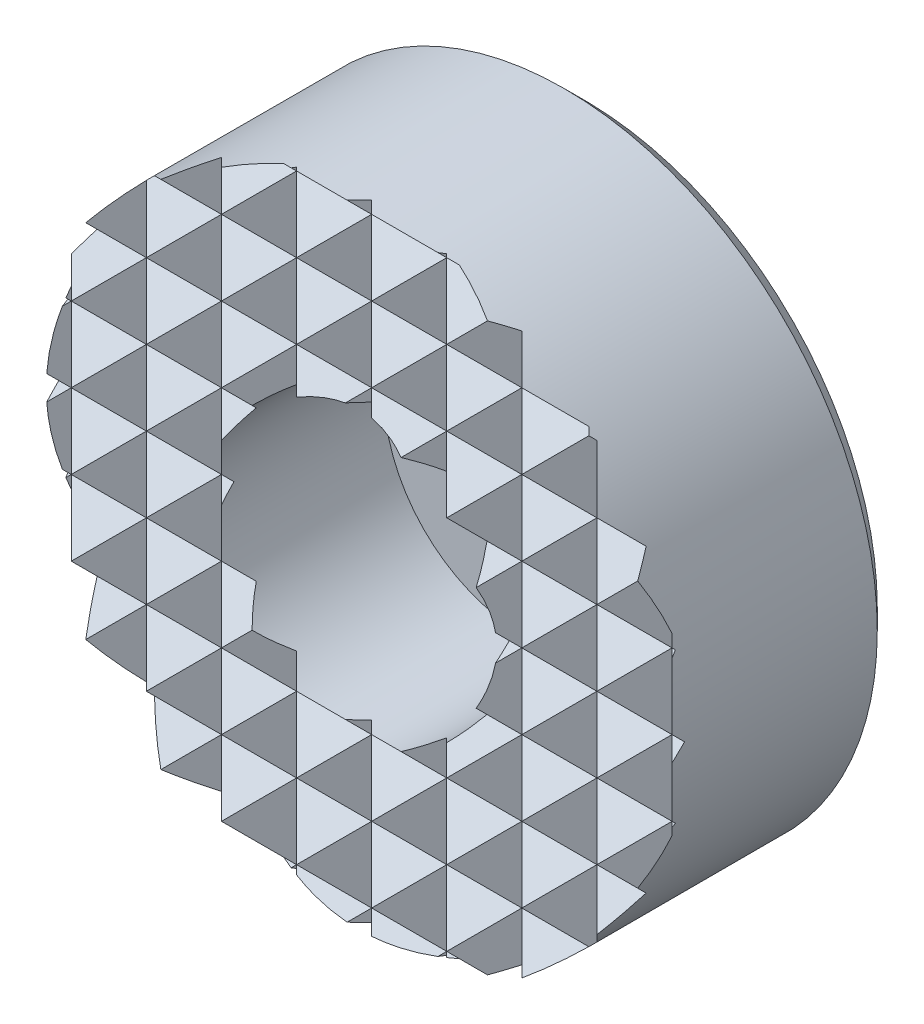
ISO-10303-21;
HEADER;
FILE_DESCRIPTION(('STEP AP214'),'2;1');
FILE_NAME('part.step','',(''),(''),'','','');
FILE_SCHEMA(('AUTOMOTIVE_DESIGN { 1 0 10303 214 1 1 1 1 }'));
ENDSEC;
DATA;
#1=APPLICATION_CONTEXT('core data for automotive mechanical design processes');
#2=APPLICATION_PROTOCOL_DEFINITION('international standard','automotive_design',2000,#1);
#3=PRODUCT_CONTEXT('',#1,'mechanical');
#4=PRODUCT('Part','Part','',(#3));
#5=PRODUCT_RELATED_PRODUCT_CATEGORY('part','',(#4));
#6=PRODUCT_DEFINITION_FORMATION('','',#4);
#7=PRODUCT_DEFINITION_CONTEXT('part definition',#1,'design');
#8=PRODUCT_DEFINITION('design','',#6,#7);
#9=PRODUCT_DEFINITION_SHAPE('','',#8);
#10=(LENGTH_UNIT() NAMED_UNIT(*) SI_UNIT(.MILLI.,.METRE.));
#11=(NAMED_UNIT(*) PLANE_ANGLE_UNIT() SI_UNIT($,.RADIAN.));
#12=(NAMED_UNIT(*) SI_UNIT($,.STERADIAN.) SOLID_ANGLE_UNIT());
#13=UNCERTAINTY_MEASURE_WITH_UNIT(LENGTH_MEASURE(1.E-05),#10,'distance_accuracy_value','');
#14=(GEOMETRIC_REPRESENTATION_CONTEXT(3) GLOBAL_UNCERTAINTY_ASSIGNED_CONTEXT((#13)) GLOBAL_UNIT_ASSIGNED_CONTEXT((#10,
#11,#12)) REPRESENTATION_CONTEXT('',''));
#15=CARTESIAN_POINT('',(0.,0.,0.));
#16=DIRECTION('',(0.,0.,1.));
#17=DIRECTION('',(1.,0.,0.));
#18=AXIS2_PLACEMENT_3D('',#15,#16,#17);
#19=CARTESIAN_POINT('',(-12.,-15.,8.5));
#20=DIRECTION('',(0.707106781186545,0.,-0.70710678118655));
#21=DIRECTION('',(-0.70710678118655,0.,-0.707106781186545));
#22=AXIS2_PLACEMENT_3D('',#19,#20,#21);
#23=PLANE('',#22);
#24=DIRECTION('',(0.577350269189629,0.577350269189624,0.577350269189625));
#25=VECTOR('',#24,1.);
#26=CARTESIAN_POINT('',(-18.,-2.99999999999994,2.50000000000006));
#27=LINE('',#26,#25);
#28=CARTESIAN_POINT('',(-12.,3.,8.5));
#29=VERTEX_POINT('',#28);
#30=CARTESIAN_POINT('',(-10.5,4.5,10.));
#31=VERTEX_POINT('',#30);
#32=EDGE_CURVE('E875',#29,#31,#27,.T.);
#33=ORIENTED_EDGE('',*,*,#32,.T.);
#34=DIRECTION('',(-0.577350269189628,0.577350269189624,-0.577350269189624));
#35=VECTOR('',#34,1.);
#36=CARTESIAN_POINT('',(-5.,-1.,15.5));
#37=LINE('',#36,#35);
#38=CARTESIAN_POINT('',(-11.3141445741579,5.31414457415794,9.18585542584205));
#39=VERTEX_POINT('',#38);
#40=EDGE_CURVE('E827',#31,#39,#37,.T.);
#41=ORIENTED_EDGE('',*,*,#40,.T.);
#42=CARTESIAN_POINT('',(0.,0.,20.5));
#43=DIRECTION('',(0.707106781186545,0.,-0.70710678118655));
#44=DIRECTION('',(-0.70710678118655,0.,-0.707106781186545));
#45=AXIS2_PLACEMENT_3D('',#42,#43,#44);
#46=ELLIPSE('',#45,17.6776695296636,12.5);
#47=CARTESIAN_POINT('',(-12.,3.5000000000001,8.5));
#48=VERTEX_POINT('',#47);
#49=EDGE_CURVE('E1499',#48,#39,#46,.T.);
#50=ORIENTED_EDGE('',*,*,#49,.F.);
#51=DIRECTION('',(0.,1.,0.));
#52=VECTOR('',#51,1.);
#53=CARTESIAN_POINT('',(-12.,-15.,8.5));
#54=LINE('',#53,#52);
#55=EDGE_CURVE('E1763',#29,#48,#54,.T.);
#56=ORIENTED_EDGE('',*,*,#55,.F.);
#57=EDGE_LOOP('',(#33,#41,#50,#56));
#58=FACE_BOUND('',#57,.T.);
#59=ADVANCED_FACE('F14',(#58),#23,.F.);
#60=DIRECTION('',(0.577350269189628,0.577350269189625,0.577350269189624));
#61=VECTOR('',#60,1.);
#62=CARTESIAN_POINT('',(-17.,-5.,3.50000000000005));
#63=LINE('',#62,#61);
#64=CARTESIAN_POINT('',(-12.,0.,8.5));
#65=VERTEX_POINT('',#64);
#66=CARTESIAN_POINT('',(-10.5,1.5,10.));
#67=VERTEX_POINT('',#66);
#68=EDGE_CURVE('E957',#65,#67,#63,.T.);
#69=ORIENTED_EDGE('',*,*,#68,.T.);
#70=DIRECTION('',(-0.577350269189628,0.577350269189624,-0.577350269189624));
#71=VECTOR('',#70,1.);
#72=CARTESIAN_POINT('',(-6.,-3.,14.5));
#73=LINE('',#72,#71);
#74=EDGE_CURVE('E919',#67,#29,#73,.T.);
#75=ORIENTED_EDGE('',*,*,#74,.T.);
#76=EDGE_CURVE('E2042',#65,#29,#54,.T.);
#77=ORIENTED_EDGE('',*,*,#76,.F.);
#78=EDGE_LOOP('',(#69,#75,#77));
#79=FACE_BOUND('',#78,.T.);
#80=ADVANCED_FACE('F2083',(#79),#23,.F.);
#81=DIRECTION('',(0.577350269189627,0.577350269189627,0.577350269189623));
#82=VECTOR('',#81,1.);
#83=CARTESIAN_POINT('',(-16.,-7.,4.5));
#84=LINE('',#83,#82);
#85=CARTESIAN_POINT('',(-12.,-3.,8.5));
#86=VERTEX_POINT('',#85);
#87=CARTESIAN_POINT('',(-10.5,-1.5,10.));
#88=VERTEX_POINT('',#87);
#89=EDGE_CURVE('E1033',#86,#88,#84,.T.);
#90=ORIENTED_EDGE('',*,*,#89,.T.);
#91=DIRECTION('',(-0.577350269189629,0.577350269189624,-0.577350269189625));
#92=VECTOR('',#91,1.);
#93=CARTESIAN_POINT('',(-7.,-5.,13.5));
#94=LINE('',#93,#92);
#95=EDGE_CURVE('E995',#88,#65,#94,.T.);
#96=ORIENTED_EDGE('',*,*,#95,.T.);
#97=EDGE_CURVE('E1762',#86,#65,#54,.T.);
#98=ORIENTED_EDGE('',*,*,#97,.F.);
#99=EDGE_LOOP('',(#90,#96,#98));
#100=FACE_BOUND('',#99,.T.);
#101=ADVANCED_FACE('F2090',(#100),#23,.F.);
#102=CARTESIAN_POINT('',(-10.5,-15.,10.));
#103=DIRECTION('',(-0.70710678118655,0.,-0.707106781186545));
#104=DIRECTION('',(-0.707106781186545,0.,0.70710678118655));
#105=AXIS2_PLACEMENT_3D('',#102,#103,#104);
#106=PLANE('',#105);
#107=CARTESIAN_POINT('',(0.,0.,-0.500000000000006));
#108=DIRECTION('',(-0.70710678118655,0.,-0.707106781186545));
#109=DIRECTION('',(0.707106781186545,0.,-0.70710678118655));
#110=AXIS2_PLACEMENT_3D('',#107,#108,#109);
#111=ELLIPSE('',#110,17.6776695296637,12.5);
#112=CARTESIAN_POINT('',(-10.2106256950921,7.21062569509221,9.71062569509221));
#113=VERTEX_POINT('',#112);
#114=CARTESIAN_POINT('',(-9.,8.67467578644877,8.5));
#115=VERTEX_POINT('',#114);
#116=EDGE_CURVE('E1500',#113,#115,#111,.T.);
#117=ORIENTED_EDGE('',*,*,#116,.F.);
#118=DIRECTION('',(0.577350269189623,-0.577350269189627,-0.577350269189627));
#119=VECTOR('',#118,1.);
#120=CARTESIAN_POINT('',(-3.,0.,2.5));
#121=LINE('',#120,#119);
#122=CARTESIAN_POINT('',(-9.,6.,8.5));
#123=VERTEX_POINT('',#122);
#124=EDGE_CURVE('E788',#113,#123,#121,.T.);
#125=ORIENTED_EDGE('',*,*,#124,.T.);
#126=DIRECTION('',(0.,1.,0.));
#127=VECTOR('',#126,1.);
#128=CARTESIAN_POINT('',(-9.,-15.,8.5));
#129=LINE('',#128,#127);
#130=EDGE_CURVE('E1643',#123,#115,#129,.T.);
#131=ORIENTED_EDGE('',*,*,#130,.T.);
#132=EDGE_LOOP('',(#117,#125,#131));
#133=FACE_BOUND('',#132,.T.);
#134=ADVANCED_FACE('F2104',(#133),#106,.F.);
#135=CARTESIAN_POINT('',(-9.,-15.,8.5));
#136=DIRECTION('',(0.707106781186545,0.,-0.70710678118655));
#137=DIRECTION('',(-0.70710678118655,0.,-0.707106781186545));
#138=AXIS2_PLACEMENT_3D('',#135,#136,#137);
#139=PLANE('',#138);
#140=DIRECTION('',(0.577350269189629,0.577350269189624,0.577350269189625));
#141=VECTOR('',#140,1.);
#142=CARTESIAN_POINT('',(-16.,-0.999999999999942,1.50000000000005));
#143=LINE('',#142,#141);
#144=CARTESIAN_POINT('',(-7.5,7.5,10.));
#145=VERTEX_POINT('',#144);
#146=EDGE_CURVE('E791',#123,#145,#143,.T.);
#147=ORIENTED_EDGE('',*,*,#146,.T.);
#148=DIRECTION('',(-0.577350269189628,0.577350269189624,-0.577350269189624));
#149=VECTOR('',#148,1.);
#150=CARTESIAN_POINT('',(-0.999999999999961,1.00000000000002,16.5));
#151=LINE('',#150,#149);
#152=CARTESIAN_POINT('',(-8.83883476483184,8.83883476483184,8.66116523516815));
#153=VERTEX_POINT('',#152);
#154=EDGE_CURVE('E751',#145,#153,#151,.T.);
#155=ORIENTED_EDGE('',*,*,#154,.T.);
#156=CARTESIAN_POINT('',(0.,0.,17.5));
#157=DIRECTION('',(0.707106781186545,0.,-0.70710678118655));
#158=DIRECTION('',(-0.70710678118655,0.,-0.707106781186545));
#159=AXIS2_PLACEMENT_3D('',#156,#157,#158);
#160=ELLIPSE('',#159,17.6776695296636,12.5);
#161=EDGE_CURVE('E1505',#115,#153,#160,.T.);
#162=ORIENTED_EDGE('',*,*,#161,.F.);
#163=ORIENTED_EDGE('',*,*,#130,.F.);
#164=EDGE_LOOP('',(#147,#155,#162,#163));
#165=FACE_BOUND('',#164,.T.);
#166=ADVANCED_FACE('F2113',(#165),#139,.F.);
#167=CARTESIAN_POINT('',(-7.5,-15.,10.));
#168=DIRECTION('',(-0.70710678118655,0.,-0.707106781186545));
#169=DIRECTION('',(-0.707106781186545,0.,0.70710678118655));
#170=AXIS2_PLACEMENT_3D('',#167,#168,#169);
#171=PLANE('',#170);
#172=CARTESIAN_POINT('',(0.,0.,2.5));
#173=DIRECTION('',(-0.70710678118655,0.,-0.707106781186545));
#174=DIRECTION('',(0.707106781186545,0.,-0.70710678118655));
#175=AXIS2_PLACEMENT_3D('',#172,#173,#174);
#176=ELLIPSE('',#175,17.6776695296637,12.5);
#177=CARTESIAN_POINT('',(-7.21062569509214,10.2106256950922,9.71062569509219));
#178=VERTEX_POINT('',#177);
#179=CARTESIAN_POINT('',(-6.,10.9658560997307,8.5));
#180=VERTEX_POINT('',#179);
#181=EDGE_CURVE('E1506',#178,#180,#176,.T.);
#182=ORIENTED_EDGE('',*,*,#181,.F.);
#183=DIRECTION('',(0.577350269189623,-0.577350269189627,-0.577350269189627));
#184=VECTOR('',#183,1.);
#185=CARTESIAN_POINT('',(1.00000000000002,2.,1.49999999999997));
#186=LINE('',#185,#184);
#187=CARTESIAN_POINT('',(-6.,9.,8.5));
#188=VERTEX_POINT('',#187);
#189=EDGE_CURVE('E717',#178,#188,#186,.T.);
#190=ORIENTED_EDGE('',*,*,#189,.T.);
#191=DIRECTION('',(0.,1.,0.));
#192=VECTOR('',#191,1.);
#193=CARTESIAN_POINT('',(-6.,-15.,8.5));
#194=LINE('',#193,#192);
#195=EDGE_CURVE('E1646',#188,#180,#194,.T.);
#196=ORIENTED_EDGE('',*,*,#195,.T.);
#197=EDGE_LOOP('',(#182,#190,#196));
#198=FACE_BOUND('',#197,.T.);
#199=ADVANCED_FACE('F1962',(#198),#171,.F.);
#200=CARTESIAN_POINT('',(-6.,0.,8.5));
#201=VERTEX_POINT('',#200);
#202=CARTESIAN_POINT('',(-6.,3.,8.5));
#203=VERTEX_POINT('',#202);
#204=EDGE_CURVE('E1942',#201,#203,#194,.T.);
#205=ORIENTED_EDGE('',*,*,#204,.T.);
#206=DIRECTION('',(-0.577350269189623,-0.577350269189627,0.577350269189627));
#207=VECTOR('',#206,1.);
#208=CARTESIAN_POINT('',(-13.,-4.,15.5));
#209=LINE('',#208,#207);
#210=CARTESIAN_POINT('',(-7.5,1.5,10.));
#211=VERTEX_POINT('',#210);
#212=EDGE_CURVE('E928',#203,#211,#209,.T.);
#213=ORIENTED_EDGE('',*,*,#212,.T.);
#214=DIRECTION('',(0.577350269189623,-0.577350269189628,-0.577350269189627));
#215=VECTOR('',#214,1.);
#216=CARTESIAN_POINT('',(-1.99999999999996,-4.,4.5));
#217=LINE('',#216,#215);
#218=EDGE_CURVE('E964',#211,#201,#217,.T.);
#219=ORIENTED_EDGE('',*,*,#218,.T.);
#220=EDGE_LOOP('',(#205,#213,#219));
#221=FACE_BOUND('',#220,.T.);
#222=ADVANCED_FACE('F2181',(#221),#171,.F.);
#223=CARTESIAN_POINT('',(-6.,-3.,8.5));
#224=VERTEX_POINT('',#223);
#225=EDGE_CURVE('E2182',#224,#201,#194,.T.);
#226=ORIENTED_EDGE('',*,*,#225,.T.);
#227=DIRECTION('',(-0.577350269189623,-0.577350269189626,0.577350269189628));
#228=VECTOR('',#227,1.);
#229=CARTESIAN_POINT('',(-12.,-6.,14.5));
#230=LINE('',#229,#228);
#231=CARTESIAN_POINT('',(-7.5,-1.49999999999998,10.));
#232=VERTEX_POINT('',#231);
#233=EDGE_CURVE('E1004',#201,#232,#230,.T.);
#234=ORIENTED_EDGE('',*,*,#233,.T.);
#235=DIRECTION('',(0.577350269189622,-0.57735026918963,-0.577350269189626));
#236=VECTOR('',#235,1.);
#237=CARTESIAN_POINT('',(-2.99999999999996,-6.,5.5));
#238=LINE('',#237,#236);
#239=EDGE_CURVE('E1042',#232,#224,#238,.T.);
#240=ORIENTED_EDGE('',*,*,#239,.T.);
#241=EDGE_LOOP('',(#226,#234,#240));
#242=FACE_BOUND('',#241,.T.);
#243=ADVANCED_FACE('F2203',(#242),#171,.F.);
#244=CARTESIAN_POINT('',(6.,-15.,8.5));
#245=DIRECTION('',(0.707106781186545,0.,-0.70710678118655));
#246=DIRECTION('',(-0.707106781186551,0.,-0.707106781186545));
#247=AXIS2_PLACEMENT_3D('',#244,#245,#246);
#248=PLANE('',#247);
#249=DIRECTION('',(0.,1.,0.));
#250=VECTOR('',#249,1.);
#251=CARTESIAN_POINT('',(6.,-15.,8.5));
#252=LINE('',#251,#250);
#253=CARTESIAN_POINT('',(6.,9.,8.5));
#254=VERTEX_POINT('',#253);
#255=CARTESIAN_POINT('',(6.,10.9658560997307,8.5));
#256=VERTEX_POINT('',#255);
#257=EDGE_CURVE('E1409',#254,#256,#252,.T.);
#258=ORIENTED_EDGE('',*,*,#257,.F.);
#259=DIRECTION('',(0.577350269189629,0.577350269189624,0.577350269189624));
#260=VECTOR('',#259,1.);
#261=CARTESIAN_POINT('',(-2.00000000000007,1.00000000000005,0.50000000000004));
#262=LINE('',#261,#260);
#263=CARTESIAN_POINT('',(7.21062569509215,10.2106256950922,9.71062569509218));
#264=VERTEX_POINT('',#263);
#265=EDGE_CURVE('E720',#254,#264,#262,.T.);
#266=ORIENTED_EDGE('',*,*,#265,.T.);
#267=CARTESIAN_POINT('',(0.,0.,2.50000000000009));
#268=DIRECTION('',(0.707106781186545,0.,-0.70710678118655));
#269=DIRECTION('',(-0.707106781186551,0.,-0.707106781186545));
#270=AXIS2_PLACEMENT_3D('',#267,#268,#269);
#271=ELLIPSE('',#270,17.6776695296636,12.5);
#272=EDGE_CURVE('E1511',#256,#264,#271,.T.);
#273=ORIENTED_EDGE('',*,*,#272,.F.);
#274=EDGE_LOOP('',(#258,#266,#273));
#275=FACE_BOUND('',#274,.T.);
#276=ADVANCED_FACE('F2294',(#275),#248,.F.);
#277=DIRECTION('',(0.577350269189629,0.577350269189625,0.577350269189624));
#278=VECTOR('',#277,1.);
#279=CARTESIAN_POINT('',(0.999999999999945,-5.,3.5));
#280=LINE('',#279,#278);
#281=CARTESIAN_POINT('',(6.,0.,8.5));
#282=VERTEX_POINT('',#281);
#283=CARTESIAN_POINT('',(7.5,1.5,10.));
#284=VERTEX_POINT('',#283);
#285=EDGE_CURVE('E987',#282,#284,#280,.T.);
#286=ORIENTED_EDGE('',*,*,#285,.T.);
#287=DIRECTION('',(-0.577350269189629,0.577350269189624,-0.577350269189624));
#288=VECTOR('',#287,1.);
#289=CARTESIAN_POINT('',(12.,-2.99999999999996,14.5));
#290=LINE('',#289,#288);
#291=CARTESIAN_POINT('',(6.,3.,8.5));
#292=VERTEX_POINT('',#291);
#293=EDGE_CURVE('E949',#284,#292,#290,.T.);
#294=ORIENTED_EDGE('',*,*,#293,.T.);
#295=EDGE_CURVE('E1710',#282,#292,#252,.T.);
#296=ORIENTED_EDGE('',*,*,#295,.F.);
#297=EDGE_LOOP('',(#286,#294,#296));
#298=FACE_BOUND('',#297,.T.);
#299=ADVANCED_FACE('F1821',(#298),#248,.F.);
#300=DIRECTION('',(0.577350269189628,0.577350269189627,0.577350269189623));
#301=VECTOR('',#300,1.);
#302=CARTESIAN_POINT('',(1.99999999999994,-7.,4.5));
#303=LINE('',#302,#301);
#304=CARTESIAN_POINT('',(6.,-3.,8.5));
#305=VERTEX_POINT('',#304);
#306=CARTESIAN_POINT('',(7.5,-1.5,10.));
#307=VERTEX_POINT('',#306);
#308=EDGE_CURVE('E1065',#305,#307,#303,.T.);
#309=ORIENTED_EDGE('',*,*,#308,.T.);
#310=DIRECTION('',(-0.57735026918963,0.577350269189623,-0.577350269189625));
#311=VECTOR('',#310,1.);
#312=CARTESIAN_POINT('',(11.,-5.,13.5));
#313=LINE('',#312,#311);
#314=EDGE_CURVE('E1025',#307,#282,#313,.T.);
#315=ORIENTED_EDGE('',*,*,#314,.T.);
#316=EDGE_CURVE('E1707',#305,#282,#252,.T.);
#317=ORIENTED_EDGE('',*,*,#316,.F.);
#318=EDGE_LOOP('',(#309,#315,#317));
#319=FACE_BOUND('',#318,.T.);
#320=ADVANCED_FACE('F1708',(#319),#248,.F.);
#321=CARTESIAN_POINT('',(7.5,-15.,10.));
#322=DIRECTION('',(-0.707106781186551,0.,-0.707106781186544));
#323=DIRECTION('',(-0.707106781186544,0.,0.707106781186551));
#324=AXIS2_PLACEMENT_3D('',#321,#322,#323);
#325=PLANE('',#324);
#326=CARTESIAN_POINT('',(0.,0.,17.5));
#327=DIRECTION('',(-0.707106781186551,0.,-0.707106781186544));
#328=DIRECTION('',(0.707106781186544,0.,-0.707106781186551));
#329=AXIS2_PLACEMENT_3D('',#326,#327,#328);
#330=ELLIPSE('',#329,17.6776695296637,12.5);
#331=CARTESIAN_POINT('',(8.83883476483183,8.83883476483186,8.66116523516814));
#332=VERTEX_POINT('',#331);
#333=CARTESIAN_POINT('',(9.,8.67467578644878,8.5));
#334=VERTEX_POINT('',#333);
#335=EDGE_CURVE('E1512',#332,#334,#330,.T.);
#336=ORIENTED_EDGE('',*,*,#335,.F.);
#337=DIRECTION('',(-0.577350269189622,-0.577350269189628,0.577350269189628));
#338=VECTOR('',#337,1.);
#339=CARTESIAN_POINT('',(0.,0.,17.5));
#340=LINE('',#339,#338);
#341=CARTESIAN_POINT('',(7.5,7.5,10.));
#342=VERTEX_POINT('',#341);
#343=EDGE_CURVE('E745',#332,#342,#340,.T.);
#344=ORIENTED_EDGE('',*,*,#343,.T.);
#345=DIRECTION('',(0.577350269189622,-0.577350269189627,-0.577350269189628));
#346=VECTOR('',#345,1.);
#347=CARTESIAN_POINT('',(15.,0.,2.49999999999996));
#348=LINE('',#347,#346);
#349=CARTESIAN_POINT('',(9.,6.,8.5));
#350=VERTEX_POINT('',#349);
#351=EDGE_CURVE('E782',#342,#350,#348,.T.);
#352=ORIENTED_EDGE('',*,*,#351,.T.);
#353=DIRECTION('',(0.,1.,0.));
#354=VECTOR('',#353,1.);
#355=CARTESIAN_POINT('',(9.,-15.,8.5));
#356=LINE('',#355,#354);
#357=EDGE_CURVE('E1767',#350,#334,#356,.T.);
#358=ORIENTED_EDGE('',*,*,#357,.T.);
#359=EDGE_LOOP('',(#336,#344,#352,#358));
#360=FACE_BOUND('',#359,.T.);
#361=ADVANCED_FACE('F1886',(#360),#325,.F.);
#362=CARTESIAN_POINT('',(9.,-15.,8.5));
#363=DIRECTION('',(0.707106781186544,0.,-0.707106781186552));
#364=DIRECTION('',(-0.707106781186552,0.,-0.707106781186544));
#365=AXIS2_PLACEMENT_3D('',#362,#363,#364);
#366=PLANE('',#365);
#367=ORIENTED_EDGE('',*,*,#357,.F.);
#368=DIRECTION('',(0.57735026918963,0.577350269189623,0.577350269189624));
#369=VECTOR('',#368,1.);
#370=CARTESIAN_POINT('',(1.99999999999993,-0.999999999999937,1.50000000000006));
#371=LINE('',#370,#369);
#372=CARTESIAN_POINT('',(10.2106256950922,7.21062569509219,9.71062569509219));
#373=VERTEX_POINT('',#372);
#374=EDGE_CURVE('E779',#350,#373,#371,.T.);
#375=ORIENTED_EDGE('',*,*,#374,.T.);
#376=CARTESIAN_POINT('',(0.,0.,-0.499999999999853));
#377=DIRECTION('',(0.707106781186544,0.,-0.707106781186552));
#378=DIRECTION('',(-0.707106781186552,0.,-0.707106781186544));
#379=AXIS2_PLACEMENT_3D('',#376,#377,#378);
#380=ELLIPSE('',#379,17.6776695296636,12.5);
#381=EDGE_CURVE('E1517',#334,#373,#380,.T.);
#382=ORIENTED_EDGE('',*,*,#381,.F.);
#383=EDGE_LOOP('',(#367,#375,#382));
#384=FACE_BOUND('',#383,.T.);
#385=ADVANCED_FACE('F1884',(#384),#366,.F.);
#386=CARTESIAN_POINT('',(10.5,-15.,10.));
#387=DIRECTION('',(-0.707106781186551,0.,-0.707106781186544));
#388=DIRECTION('',(-0.707106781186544,0.,0.707106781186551));
#389=AXIS2_PLACEMENT_3D('',#386,#387,#388);
#390=PLANE('',#389);
#391=CARTESIAN_POINT('',(0.,0.,20.5));
#392=DIRECTION('',(-0.707106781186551,0.,-0.707106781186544));
#393=DIRECTION('',(0.707106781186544,0.,-0.707106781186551));
#394=AXIS2_PLACEMENT_3D('',#391,#392,#393);
#395=ELLIPSE('',#394,17.6776695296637,12.5);
#396=CARTESIAN_POINT('',(11.3141445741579,5.31414457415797,9.18585542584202));
#397=VERTEX_POINT('',#396);
#398=CARTESIAN_POINT('',(12.,3.50000000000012,8.5));
#399=VERTEX_POINT('',#398);
#400=EDGE_CURVE('E1518',#397,#399,#395,.T.);
#401=ORIENTED_EDGE('',*,*,#400,.F.);
#402=DIRECTION('',(-0.577350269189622,-0.577350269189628,0.577350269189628));
#403=VECTOR('',#402,1.);
#404=CARTESIAN_POINT('',(4.,-2.00000000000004,16.5));
#405=LINE('',#404,#403);
#406=CARTESIAN_POINT('',(10.5,4.5,10.));
#407=VERTEX_POINT('',#406);
#408=EDGE_CURVE('E822',#397,#407,#405,.T.);
#409=ORIENTED_EDGE('',*,*,#408,.T.);
#410=DIRECTION('',(0.577350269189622,-0.577350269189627,-0.577350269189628));
#411=VECTOR('',#410,1.);
#412=CARTESIAN_POINT('',(17.,-2.00000000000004,3.49999999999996));
#413=LINE('',#412,#411);
#414=CARTESIAN_POINT('',(12.,3.,8.5));
#415=VERTEX_POINT('',#414);
#416=EDGE_CURVE('E897',#407,#415,#413,.T.);
#417=ORIENTED_EDGE('',*,*,#416,.T.);
#418=DIRECTION('',(0.,1.,0.));
#419=VECTOR('',#418,1.);
#420=CARTESIAN_POINT('',(12.,-15.,8.5));
#421=LINE('',#420,#419);
#422=EDGE_CURVE('E1761',#415,#399,#421,.T.);
#423=ORIENTED_EDGE('',*,*,#422,.T.);
#424=EDGE_LOOP('',(#401,#409,#417,#423));
#425=FACE_BOUND('',#424,.T.);
#426=ADVANCED_FACE('F1869',(#425),#390,.F.);
#427=CARTESIAN_POINT('',(12.,0.,8.5));
#428=VERTEX_POINT('',#427);
#429=EDGE_CURVE('E1857',#428,#415,#421,.T.);
#430=ORIENTED_EDGE('',*,*,#429,.T.);
#431=DIRECTION('',(-0.577350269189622,-0.577350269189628,0.577350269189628));
#432=VECTOR('',#431,1.);
#433=CARTESIAN_POINT('',(5.,-4.,15.5));
#434=LINE('',#433,#432);
#435=CARTESIAN_POINT('',(10.5,1.5,10.));
#436=VERTEX_POINT('',#435);
#437=EDGE_CURVE('E939',#415,#436,#434,.T.);
#438=ORIENTED_EDGE('',*,*,#437,.T.);
#439=DIRECTION('',(0.577350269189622,-0.577350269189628,-0.577350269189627));
#440=VECTOR('',#439,1.);
#441=CARTESIAN_POINT('',(16.,-4.00000000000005,4.5));
#442=LINE('',#441,#440);
#443=EDGE_CURVE('E976',#436,#428,#442,.T.);
#444=ORIENTED_EDGE('',*,*,#443,.T.);
#445=EDGE_LOOP('',(#430,#438,#444));
#446=FACE_BOUND('',#445,.T.);
#447=ADVANCED_FACE('F1858',(#446),#390,.F.);
#448=CARTESIAN_POINT('',(12.,-3.,8.5));
#449=VERTEX_POINT('',#448);
#450=EDGE_CURVE('E1768',#449,#428,#421,.T.);
#451=ORIENTED_EDGE('',*,*,#450,.T.);
#452=DIRECTION('',(-0.577350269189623,-0.577350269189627,0.577350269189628));
#453=VECTOR('',#452,1.);
#454=CARTESIAN_POINT('',(6.,-6.,14.5));
#455=LINE('',#454,#453);
#456=CARTESIAN_POINT('',(10.5,-1.5,10.));
#457=VERTEX_POINT('',#456);
#458=EDGE_CURVE('E1015',#428,#457,#455,.T.);
#459=ORIENTED_EDGE('',*,*,#458,.T.);
#460=DIRECTION('',(0.577350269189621,-0.57735026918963,-0.577350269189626));
#461=VECTOR('',#460,1.);
#462=CARTESIAN_POINT('',(15.,-6.00000000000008,5.5));
#463=LINE('',#462,#461);
#464=EDGE_CURVE('E1054',#457,#449,#463,.T.);
#465=ORIENTED_EDGE('',*,*,#464,.T.);
#466=EDGE_LOOP('',(#451,#459,#465));
#467=FACE_BOUND('',#466,.T.);
#468=ADVANCED_FACE('F2226',(#467),#390,.F.);
#469=CARTESIAN_POINT('',(12.,-15.,8.5));
#470=DIRECTION('',(0.707106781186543,0.,-0.707106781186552));
#471=DIRECTION('',(-0.707106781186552,0.,-0.707106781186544));
#472=AXIS2_PLACEMENT_3D('',#469,#470,#471);
#473=PLANE('',#472);
#474=ORIENTED_EDGE('',*,*,#422,.F.);
#475=DIRECTION('',(0.57735026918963,0.577350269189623,0.577350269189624));
#476=VECTOR('',#475,1.);
#477=CARTESIAN_POINT('',(6.,-2.99999999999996,2.50000000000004));
#478=LINE('',#477,#476);
#479=CARTESIAN_POINT('',(12.1075620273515,3.10756202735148,8.60756202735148));
#480=VERTEX_POINT('',#479);
#481=EDGE_CURVE('E894',#415,#480,#478,.T.);
#482=ORIENTED_EDGE('',*,*,#481,.T.);
#483=CARTESIAN_POINT('',(0.,0.,-3.49999999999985));
#484=DIRECTION('',(0.707106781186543,0.,-0.707106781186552));
#485=DIRECTION('',(-0.707106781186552,0.,-0.707106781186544));
#486=AXIS2_PLACEMENT_3D('',#483,#484,#485);
#487=ELLIPSE('',#486,17.6776695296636,12.5);
#488=EDGE_CURVE('E1521',#399,#480,#487,.T.);
#489=ORIENTED_EDGE('',*,*,#488,.F.);
#490=EDGE_LOOP('',(#474,#482,#489));
#491=FACE_BOUND('',#490,.T.);
#492=ADVANCED_FACE('F1872',(#491),#473,.F.);
#493=CARTESIAN_POINT('',(12.1770717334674,2.82292826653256,8.67707173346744));
#494=VERTEX_POINT('',#493);
#495=CARTESIAN_POINT('',(12.4903774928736,0.490377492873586,8.99037749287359));
#496=VERTEX_POINT('',#495);
#497=EDGE_CURVE('E1525',#494,#496,#487,.T.);
#498=ORIENTED_EDGE('',*,*,#497,.F.);
#499=DIRECTION('',(-0.57735026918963,0.577350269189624,-0.577350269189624));
#500=VECTOR('',#499,1.);
#501=CARTESIAN_POINT('',(18.,-2.99999999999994,14.5));
#502=LINE('',#501,#500);
#503=EDGE_CURVE('E936',#494,#415,#502,.T.);
#504=ORIENTED_EDGE('',*,*,#503,.T.);
#505=ORIENTED_EDGE('',*,*,#429,.F.);
#506=DIRECTION('',(0.57735026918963,0.577350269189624,0.577350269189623));
#507=VECTOR('',#506,1.);
#508=CARTESIAN_POINT('',(7.,-5.,3.5));
#509=LINE('',#508,#507);
#510=EDGE_CURVE('E973',#428,#496,#509,.T.);
#511=ORIENTED_EDGE('',*,*,#510,.T.);
#512=EDGE_LOOP('',(#498,#504,#505,#511));
#513=FACE_BOUND('',#512,.T.);
#514=ADVANCED_FACE('F1862',(#513),#473,.F.);
#515=CARTESIAN_POINT('',(12.4903774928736,-0.490377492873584,8.99037749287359));
#516=VERTEX_POINT('',#515);
#517=CARTESIAN_POINT('',(12.1770717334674,-2.82292826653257,8.67707173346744));
#518=VERTEX_POINT('',#517);
#519=EDGE_CURVE('E2232',#516,#518,#487,.T.);
#520=ORIENTED_EDGE('',*,*,#519,.F.);
#521=DIRECTION('',(-0.577350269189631,0.577350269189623,-0.577350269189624));
#522=VECTOR('',#521,1.);
#523=CARTESIAN_POINT('',(17.,-4.99999999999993,13.5));
#524=LINE('',#523,#522);
#525=EDGE_CURVE('E1012',#516,#428,#524,.T.);
#526=ORIENTED_EDGE('',*,*,#525,.T.);
#527=ORIENTED_EDGE('',*,*,#450,.F.);
#528=DIRECTION('',(0.577350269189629,0.577350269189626,0.577350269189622));
#529=VECTOR('',#528,1.);
#530=CARTESIAN_POINT('',(8.,-7.,4.5));
#531=LINE('',#530,#529);
#532=EDGE_CURVE('E1051',#449,#518,#531,.T.);
#533=ORIENTED_EDGE('',*,*,#532,.T.);
#534=EDGE_LOOP('',(#520,#526,#527,#533));
#535=FACE_BOUND('',#534,.T.);
#536=ADVANCED_FACE('F2230',(#535),#473,.F.);
#537=CARTESIAN_POINT('',(-13.5,-15.,10.));
#538=DIRECTION('',(-0.70710678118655,0.,-0.707106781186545));
#539=DIRECTION('',(-0.707106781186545,0.,0.70710678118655));
#540=AXIS2_PLACEMENT_3D('',#537,#538,#539);
#541=PLANE('',#540);
#542=CARTESIAN_POINT('',(0.,0.,-3.5));
#543=DIRECTION('',(-0.70710678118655,0.,-0.707106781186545));
#544=DIRECTION('',(0.707106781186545,0.,-0.70710678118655));
#545=AXIS2_PLACEMENT_3D('',#542,#543,#544);
#546=ELLIPSE('',#545,17.6776695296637,12.5);
#547=CARTESIAN_POINT('',(-12.1075620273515,3.10756202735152,8.60756202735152));
#548=VERTEX_POINT('',#547);
#549=EDGE_CURVE('E1497',#548,#48,#546,.T.);
#550=ORIENTED_EDGE('',*,*,#549,.F.);
#551=DIRECTION('',(0.577350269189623,-0.577350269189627,-0.577350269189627));
#552=VECTOR('',#551,1.);
#553=CARTESIAN_POINT('',(-7.,-2.,3.5));
#554=LINE('',#553,#552);
#555=EDGE_CURVE('E871',#548,#29,#554,.T.);
#556=ORIENTED_EDGE('',*,*,#555,.T.);
#557=ORIENTED_EDGE('',*,*,#55,.T.);
#558=EDGE_LOOP('',(#550,#556,#557));
#559=FACE_BOUND('',#558,.T.);
#560=ADVANCED_FACE('F3737',(#559),#541,.F.);
#561=ORIENTED_EDGE('',*,*,#76,.T.);
#562=DIRECTION('',(-0.577350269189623,-0.577350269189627,0.577350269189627));
#563=VECTOR('',#562,1.);
#564=CARTESIAN_POINT('',(-19.,-4.00000000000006,15.5));
#565=LINE('',#564,#563);
#566=CARTESIAN_POINT('',(-12.1770717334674,2.82292826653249,8.6770717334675));
#567=VERTEX_POINT('',#566);
#568=EDGE_CURVE('E915',#29,#567,#565,.T.);
#569=ORIENTED_EDGE('',*,*,#568,.T.);
#570=CARTESIAN_POINT('',(-12.4903774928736,0.490377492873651,8.99037749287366));
#571=VERTEX_POINT('',#570);
#572=EDGE_CURVE('E4241',#571,#567,#546,.T.);
#573=ORIENTED_EDGE('',*,*,#572,.F.);
#574=DIRECTION('',(0.577350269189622,-0.577350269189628,-0.577350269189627));
#575=VECTOR('',#574,1.);
#576=CARTESIAN_POINT('',(-8.,-4.,4.5));
#577=LINE('',#576,#575);
#578=EDGE_CURVE('E953',#571,#65,#577,.T.);
#579=ORIENTED_EDGE('',*,*,#578,.T.);
#580=EDGE_LOOP('',(#561,#569,#573,#579));
#581=FACE_BOUND('',#580,.T.);
#582=ADVANCED_FACE('F3911',(#581),#541,.F.);
#583=ORIENTED_EDGE('',*,*,#97,.T.);
#584=DIRECTION('',(-0.577350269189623,-0.577350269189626,0.577350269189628));
#585=VECTOR('',#584,1.);
#586=CARTESIAN_POINT('',(-18.,-6.,14.5));
#587=LINE('',#586,#585);
#588=CARTESIAN_POINT('',(-12.4903774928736,-0.490377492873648,8.99037749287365));
#589=VERTEX_POINT('',#588);
#590=EDGE_CURVE('E991',#65,#589,#587,.T.);
#591=ORIENTED_EDGE('',*,*,#590,.T.);
#592=CARTESIAN_POINT('',(-12.1770717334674,-2.82292826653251,8.67707173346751));
#593=VERTEX_POINT('',#592);
#594=EDGE_CURVE('E1496',#593,#589,#546,.T.);
#595=ORIENTED_EDGE('',*,*,#594,.F.);
#596=DIRECTION('',(0.577350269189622,-0.57735026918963,-0.577350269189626));
#597=VECTOR('',#596,1.);
#598=CARTESIAN_POINT('',(-9.,-6.,5.5));
#599=LINE('',#598,#597);
#600=EDGE_CURVE('E1029',#593,#86,#599,.T.);
#601=ORIENTED_EDGE('',*,*,#600,.T.);
#602=EDGE_LOOP('',(#583,#591,#595,#601));
#603=FACE_BOUND('',#602,.T.);
#604=ADVANCED_FACE('F3738',(#603),#541,.F.);
#605=CARTESIAN_POINT('',(-6.,-15.,8.5));
#606=DIRECTION('',(0.707106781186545,0.,-0.70710678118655));
#607=DIRECTION('',(-0.70710678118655,0.,-0.707106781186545));
#608=AXIS2_PLACEMENT_3D('',#605,#606,#607);
#609=PLANE('',#608);
#610=DIRECTION('',(0.577350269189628,0.577350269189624,0.577350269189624));
#611=VECTOR('',#610,1.);
#612=CARTESIAN_POINT('',(-14.,1.00000000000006,0.500000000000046));
#613=LINE('',#612,#611);
#614=CARTESIAN_POINT('',(-4.49999999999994,10.5,10.));
#615=VERTEX_POINT('',#614);
#616=EDGE_CURVE('E723',#188,#615,#613,.T.);
#617=ORIENTED_EDGE('',*,*,#616,.T.);
#618=DIRECTION('',(-0.577350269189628,0.577350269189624,-0.577350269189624));
#619=VECTOR('',#618,1.);
#620=CARTESIAN_POINT('',(3.00000000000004,3.,17.5));
#621=LINE('',#620,#619);
#622=CARTESIAN_POINT('',(-5.31414457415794,11.3141445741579,9.18585542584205));
#623=VERTEX_POINT('',#622);
#624=EDGE_CURVE('E694',#615,#623,#621,.T.);
#625=ORIENTED_EDGE('',*,*,#624,.T.);
#626=CARTESIAN_POINT('',(0.,0.,14.5));
#627=DIRECTION('',(0.707106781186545,0.,-0.70710678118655));
#628=DIRECTION('',(-0.70710678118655,0.,-0.707106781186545));
#629=AXIS2_PLACEMENT_3D('',#626,#627,#628);
#630=ELLIPSE('',#629,17.6776695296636,12.5);
#631=EDGE_CURVE('E1738',#180,#623,#630,.T.);
#632=ORIENTED_EDGE('',*,*,#631,.F.);
#633=ORIENTED_EDGE('',*,*,#195,.F.);
#634=EDGE_LOOP('',(#617,#625,#632,#633));
#635=FACE_BOUND('',#634,.T.);
#636=ADVANCED_FACE('F1965',(#635),#609,.F.);
#637=CARTESIAN_POINT('',(0.,0.,14.5));
#638=DIRECTION('',(0.707106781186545,0.,-0.70710678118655));
#639=DIRECTION('',(0.70710678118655,0.,0.707106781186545));
#640=AXIS2_PLACEMENT_3D('',#637,#638,#639);
#641=ELLIPSE('',#640,7.778174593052,5.5);
#642=CARTESIAN_POINT('',(-5.47487373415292,0.525126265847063,9.02512626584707));
#643=VERTEX_POINT('',#642);
#644=CARTESIAN_POINT('',(-5.08817502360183,2.08817502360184,9.41182497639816));
#645=VERTEX_POINT('',#644);
#646=EDGE_CURVE('E1488',#643,#645,#641,.T.);
#647=ORIENTED_EDGE('',*,*,#646,.T.);
#648=DIRECTION('',(-0.577350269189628,0.577350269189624,-0.577350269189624));
#649=VECTOR('',#648,1.);
#650=CARTESIAN_POINT('',(0.,-3.,14.5));
#651=LINE('',#650,#649);
#652=EDGE_CURVE('E930',#645,#203,#651,.T.);
#653=ORIENTED_EDGE('',*,*,#652,.T.);
#654=ORIENTED_EDGE('',*,*,#204,.F.);
#655=DIRECTION('',(0.577350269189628,0.577350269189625,0.577350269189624));
#656=VECTOR('',#655,1.);
#657=CARTESIAN_POINT('',(-11.,-5.,3.5));
#658=LINE('',#657,#656);
#659=EDGE_CURVE('E967',#201,#643,#658,.T.);
#660=ORIENTED_EDGE('',*,*,#659,.T.);
#661=EDGE_LOOP('',(#647,#653,#654,#660));
#662=FACE_BOUND('',#661,.T.);
#663=ADVANCED_FACE('F2176',(#662),#609,.F.);
#664=CARTESIAN_POINT('',(-5.08817502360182,-2.08817502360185,9.41182497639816));
#665=VERTEX_POINT('',#664);
#666=CARTESIAN_POINT('',(-5.47487373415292,-0.525126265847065,9.02512626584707));
#667=VERTEX_POINT('',#666);
#668=EDGE_CURVE('E1491',#665,#667,#641,.T.);
#669=ORIENTED_EDGE('',*,*,#668,.T.);
#670=DIRECTION('',(-0.577350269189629,0.577350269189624,-0.577350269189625));
#671=VECTOR('',#670,1.);
#672=CARTESIAN_POINT('',(-0.999999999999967,-5.,13.5));
#673=LINE('',#672,#671);
#674=EDGE_CURVE('E1006',#667,#201,#673,.T.);
#675=ORIENTED_EDGE('',*,*,#674,.T.);
#676=ORIENTED_EDGE('',*,*,#225,.F.);
#677=DIRECTION('',(0.577350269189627,0.577350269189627,0.577350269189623));
#678=VECTOR('',#677,1.);
#679=CARTESIAN_POINT('',(-10.,-7.,4.5));
#680=LINE('',#679,#678);
#681=EDGE_CURVE('E1045',#224,#665,#680,.T.);
#682=ORIENTED_EDGE('',*,*,#681,.T.);
#683=EDGE_LOOP('',(#669,#675,#676,#682));
#684=FACE_BOUND('',#683,.T.);
#685=ADVANCED_FACE('F2207',(#684),#609,.F.);
#686=CARTESIAN_POINT('',(-4.5,-15.,10.));
#687=DIRECTION('',(-0.70710678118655,0.,-0.707106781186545));
#688=DIRECTION('',(-0.707106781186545,0.,0.70710678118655));
#689=AXIS2_PLACEMENT_3D('',#686,#687,#688);
#690=PLANE('',#689);
#691=CARTESIAN_POINT('',(0.,0.,5.5));
#692=DIRECTION('',(-0.70710678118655,0.,-0.707106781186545));
#693=DIRECTION('',(-0.707106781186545,0.,0.70710678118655));
#694=AXIS2_PLACEMENT_3D('',#691,#692,#693);
#695=ELLIPSE('',#694,7.77817459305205,5.5);
#696=CARTESIAN_POINT('',(-3.,-4.60977222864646,8.5));
#697=VERTEX_POINT('',#696);
#698=CARTESIAN_POINT('',(-3.88908729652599,-3.88908729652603,9.38908729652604));
#699=VERTEX_POINT('',#698);
#700=EDGE_CURVE('E1484',#697,#699,#695,.T.);
#701=ORIENTED_EDGE('',*,*,#700,.T.);
#702=DIRECTION('',(-0.577350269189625,-0.577350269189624,0.577350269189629));
#703=VECTOR('',#702,1.);
#704=CARTESIAN_POINT('',(-8.,-8.,13.5));
#705=LINE('',#704,#703);
#706=CARTESIAN_POINT('',(-4.5,-4.5,10.));
#707=VERTEX_POINT('',#706);
#708=EDGE_CURVE('E1087',#699,#707,#705,.T.);
#709=ORIENTED_EDGE('',*,*,#708,.T.);
#710=DIRECTION('',(0.577350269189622,-0.577350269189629,-0.577350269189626));
#711=VECTOR('',#710,1.);
#712=CARTESIAN_POINT('',(-0.999999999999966,-8.,6.5));
#713=LINE('',#712,#711);
#714=CARTESIAN_POINT('',(-2.99999999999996,-6.,8.5));
#715=VERTEX_POINT('',#714);
#716=EDGE_CURVE('E1136',#707,#715,#713,.T.);
#717=ORIENTED_EDGE('',*,*,#716,.T.);
#718=DIRECTION('',(0.,1.,0.));
#719=VECTOR('',#718,1.);
#720=CARTESIAN_POINT('',(-3.,-15.,8.5));
#721=LINE('',#720,#719);
#722=EDGE_CURVE('E1975',#715,#697,#721,.T.);
#723=ORIENTED_EDGE('',*,*,#722,.T.);
#724=EDGE_LOOP('',(#701,#709,#717,#723));
#725=FACE_BOUND('',#724,.T.);
#726=ADVANCED_FACE('F2571',(#725),#690,.F.);
#727=DIRECTION('',(-0.577350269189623,-0.577350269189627,0.577350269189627));
#728=VECTOR('',#727,1.);
#729=CARTESIAN_POINT('',(-11.,-2.00000000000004,16.5));
#730=LINE('',#729,#728);
#731=CARTESIAN_POINT('',(-3.,6.,8.5));
#732=VERTEX_POINT('',#731);
#733=CARTESIAN_POINT('',(-4.5,4.5,10.));
#734=VERTEX_POINT('',#733);
#735=EDGE_CURVE('E844',#732,#734,#730,.T.);
#736=ORIENTED_EDGE('',*,*,#735,.T.);
#737=DIRECTION('',(0.577350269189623,-0.577350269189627,-0.577350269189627));
#738=VECTOR('',#737,1.);
#739=CARTESIAN_POINT('',(2.00000000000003,-2.,3.5));
#740=LINE('',#739,#738);
#741=CARTESIAN_POINT('',(-3.88908729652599,3.88908729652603,9.38908729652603));
#742=VERTEX_POINT('',#741);
#743=EDGE_CURVE('E888',#734,#742,#740,.T.);
#744=ORIENTED_EDGE('',*,*,#743,.T.);
#745=CARTESIAN_POINT('',(-3.,4.60977222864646,8.5));
#746=VERTEX_POINT('',#745);
#747=EDGE_CURVE('E1487',#742,#746,#695,.T.);
#748=ORIENTED_EDGE('',*,*,#747,.T.);
#749=EDGE_CURVE('E1971',#746,#732,#721,.T.);
#750=ORIENTED_EDGE('',*,*,#749,.T.);
#751=EDGE_LOOP('',(#736,#744,#748,#750));
#752=FACE_BOUND('',#751,.T.);
#753=ADVANCED_FACE('F2544',(#752),#690,.F.);
#754=CARTESIAN_POINT('',(-3.,-15.,8.5));
#755=DIRECTION('',(0.707106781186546,0.,-0.707106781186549));
#756=DIRECTION('',(-0.707106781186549,0.,-0.707106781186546));
#757=AXIS2_PLACEMENT_3D('',#754,#755,#756);
#758=PLANE('',#757);
#759=CARTESIAN_POINT('',(0.,0.,11.5));
#760=DIRECTION('',(0.707106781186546,0.,-0.707106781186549));
#761=DIRECTION('',(0.707106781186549,0.,0.707106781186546));
#762=AXIS2_PLACEMENT_3D('',#759,#760,#761);
#763=ELLIPSE('',#762,7.77817459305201,5.5);
#764=CARTESIAN_POINT('',(-2.08817502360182,5.08817502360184,9.41182497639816));
#765=VERTEX_POINT('',#764);
#766=EDGE_CURVE('E1480',#746,#765,#763,.T.);
#767=ORIENTED_EDGE('',*,*,#766,.T.);
#768=DIRECTION('',(-0.577350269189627,0.577350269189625,-0.577350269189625));
#769=VECTOR('',#768,1.);
#770=CARTESIAN_POINT('',(4.,-0.999999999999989,15.5));
#771=LINE('',#770,#769);
#772=EDGE_CURVE('E846',#765,#732,#771,.T.);
#773=ORIENTED_EDGE('',*,*,#772,.T.);
#774=ORIENTED_EDGE('',*,*,#749,.F.);
#775=EDGE_LOOP('',(#767,#773,#774));
#776=FACE_BOUND('',#775,.T.);
#777=ADVANCED_FACE('F2541',(#776),#758,.F.);
#778=ORIENTED_EDGE('',*,*,#722,.F.);
#779=DIRECTION('',(0.577350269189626,0.577350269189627,0.577350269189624));
#780=VECTOR('',#779,1.);
#781=CARTESIAN_POINT('',(-6.,-9.,5.5));
#782=LINE('',#781,#780);
#783=CARTESIAN_POINT('',(-2.0881750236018,-5.08817502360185,9.41182497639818));
#784=VERTEX_POINT('',#783);
#785=EDGE_CURVE('E1139',#715,#784,#782,.T.);
#786=ORIENTED_EDGE('',*,*,#785,.T.);
#787=EDGE_CURVE('E1483',#784,#697,#763,.T.);
#788=ORIENTED_EDGE('',*,*,#787,.T.);
#789=EDGE_LOOP('',(#778,#786,#788));
#790=FACE_BOUND('',#789,.T.);
#791=ADVANCED_FACE('F2563',(#790),#758,.F.);
#792=CARTESIAN_POINT('',(-1.49999999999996,-15.,10.));
#793=DIRECTION('',(-0.70710678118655,0.,-0.707106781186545));
#794=DIRECTION('',(-0.707106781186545,0.,0.70710678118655));
#795=AXIS2_PLACEMENT_3D('',#792,#793,#794);
#796=PLANE('',#795);
#797=CARTESIAN_POINT('',(0.,0.,8.5));
#798=DIRECTION('',(-0.70710678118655,0.,-0.707106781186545));
#799=DIRECTION('',(-0.707106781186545,0.,0.70710678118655));
#800=AXIS2_PLACEMENT_3D('',#797,#798,#799);
#801=ELLIPSE('',#800,7.77817459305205,5.5);
#802=CARTESIAN_POINT('',(0.,-5.5,8.5));
#803=VERTEX_POINT('',#802);
#804=CARTESIAN_POINT('',(-0.525126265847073,-5.47487373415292,9.02512626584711));
#805=VERTEX_POINT('',#804);
#806=EDGE_CURVE('E1476',#803,#805,#801,.T.);
#807=ORIENTED_EDGE('',*,*,#806,.T.);
#808=DIRECTION('',(0.577350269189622,-0.57735026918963,-0.577350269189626));
#809=VECTOR('',#808,1.);
#810=CARTESIAN_POINT('',(2.00000000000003,-8.,6.5));
#811=LINE('',#810,#809);
#812=CARTESIAN_POINT('',(0.,-6.,8.5));
#813=VERTEX_POINT('',#812);
#814=EDGE_CURVE('E1146',#805,#813,#811,.T.);
#815=ORIENTED_EDGE('',*,*,#814,.T.);
#816=DIRECTION('',(0.,1.,0.));
#817=VECTOR('',#816,1.);
#818=CARTESIAN_POINT('',(0.,-15.,8.5));
#819=LINE('',#818,#817);
#820=EDGE_CURVE('E1979',#813,#803,#819,.T.);
#821=ORIENTED_EDGE('',*,*,#820,.T.);
#822=EDGE_LOOP('',(#807,#815,#821));
#823=FACE_BOUND('',#822,.T.);
#824=ADVANCED_FACE('F2779',(#823),#796,.F.);
#825=CARTESIAN_POINT('',(0.,5.5,8.5));
#826=VERTEX_POINT('',#825);
#827=CARTESIAN_POINT('',(0.,6.,8.5));
#828=VERTEX_POINT('',#827);
#829=EDGE_CURVE('E1422',#826,#828,#819,.T.);
#830=ORIENTED_EDGE('',*,*,#829,.T.);
#831=DIRECTION('',(-0.577350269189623,-0.577350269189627,0.577350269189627));
#832=VECTOR('',#831,1.);
#833=CARTESIAN_POINT('',(-8.,-2.00000000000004,16.5));
#834=LINE('',#833,#832);
#835=CARTESIAN_POINT('',(-0.525126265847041,5.47487373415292,9.02512626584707));
#836=VERTEX_POINT('',#835);
#837=EDGE_CURVE('E853',#828,#836,#834,.T.);
#838=ORIENTED_EDGE('',*,*,#837,.T.);
#839=EDGE_CURVE('E1479',#836,#826,#801,.T.);
#840=ORIENTED_EDGE('',*,*,#839,.T.);
#841=EDGE_LOOP('',(#830,#838,#840));
#842=FACE_BOUND('',#841,.T.);
#843=ADVANCED_FACE('F2075',(#842),#796,.F.);
#844=CARTESIAN_POINT('',(0.,-15.,8.5));
#845=DIRECTION('',(0.707106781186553,0.,-0.707106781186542));
#846=DIRECTION('',(-0.707106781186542,0.,-0.707106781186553));
#847=AXIS2_PLACEMENT_3D('',#844,#845,#846);
#848=PLANE('',#847);
#849=CARTESIAN_POINT('',(0.,0.,8.5));
#850=DIRECTION('',(0.707106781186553,0.,-0.707106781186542));
#851=DIRECTION('',(0.707106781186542,0.,0.707106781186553));
#852=AXIS2_PLACEMENT_3D('',#849,#850,#851);
#853=ELLIPSE('',#852,7.77817459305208,5.5);
#854=CARTESIAN_POINT('',(0.525126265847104,5.47487373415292,9.02512626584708));
#855=VERTEX_POINT('',#854);
#856=EDGE_CURVE('E1470',#826,#855,#853,.T.);
#857=ORIENTED_EDGE('',*,*,#856,.T.);
#858=DIRECTION('',(-0.57735026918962,0.577350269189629,-0.577350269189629));
#859=VECTOR('',#858,1.);
#860=CARTESIAN_POINT('',(7.,-1.00000000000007,15.5));
#861=LINE('',#860,#859);
#862=EDGE_CURVE('E856',#855,#828,#861,.T.);
#863=ORIENTED_EDGE('',*,*,#862,.T.);
#864=ORIENTED_EDGE('',*,*,#829,.F.);
#865=EDGE_LOOP('',(#857,#863,#864));
#866=FACE_BOUND('',#865,.T.);
#867=ADVANCED_FACE('F2078',(#866),#848,.F.);
#868=ORIENTED_EDGE('',*,*,#820,.F.);
#869=DIRECTION('',(0.577350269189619,0.577350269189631,0.577350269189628));
#870=VECTOR('',#869,1.);
#871=CARTESIAN_POINT('',(-2.99999999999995,-9.,5.5));
#872=LINE('',#871,#870);
#873=CARTESIAN_POINT('',(0.525126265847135,-5.47487373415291,9.02512626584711));
#874=VERTEX_POINT('',#873);
#875=EDGE_CURVE('E1149',#813,#874,#872,.T.);
#876=ORIENTED_EDGE('',*,*,#875,.T.);
#877=EDGE_CURVE('E1475',#874,#803,#853,.T.);
#878=ORIENTED_EDGE('',*,*,#877,.T.);
#879=EDGE_LOOP('',(#868,#876,#878));
#880=FACE_BOUND('',#879,.T.);
#881=ADVANCED_FACE('F2064',(#880),#848,.F.);
#882=CARTESIAN_POINT('',(1.5,-15.,10.));
#883=DIRECTION('',(-0.707106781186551,0.,-0.707106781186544));
#884=DIRECTION('',(-0.707106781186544,0.,0.707106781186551));
#885=AXIS2_PLACEMENT_3D('',#882,#883,#884);
#886=PLANE('',#885);
#887=CARTESIAN_POINT('',(0.,0.,11.5));
#888=DIRECTION('',(-0.707106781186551,0.,-0.707106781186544));
#889=DIRECTION('',(-0.707106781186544,0.,0.707106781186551));
#890=AXIS2_PLACEMENT_3D('',#887,#888,#889);
#891=ELLIPSE('',#890,7.77817459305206,5.5);
#892=CARTESIAN_POINT('',(3.,-4.60977222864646,8.5));
#893=VERTEX_POINT('',#892);
#894=CARTESIAN_POINT('',(2.08817502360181,-5.08817502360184,9.41182497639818));
#895=VERTEX_POINT('',#894);
#896=EDGE_CURVE('E1453',#893,#895,#891,.T.);
#897=ORIENTED_EDGE('',*,*,#896,.T.);
#898=DIRECTION('',(0.577350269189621,-0.57735026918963,-0.577350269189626));
#899=VECTOR('',#898,1.);
#900=CARTESIAN_POINT('',(5.,-8.,6.5));
#901=LINE('',#900,#899);
#902=CARTESIAN_POINT('',(3.,-6.,8.5));
#903=VERTEX_POINT('',#902);
#904=EDGE_CURVE('E1157',#895,#903,#901,.T.);
#905=ORIENTED_EDGE('',*,*,#904,.T.);
#906=DIRECTION('',(0.,1.,0.));
#907=VECTOR('',#906,1.);
#908=CARTESIAN_POINT('',(3.,-15.,8.5));
#909=LINE('',#908,#907);
#910=EDGE_CURVE('E1372',#903,#893,#909,.T.);
#911=ORIENTED_EDGE('',*,*,#910,.T.);
#912=EDGE_LOOP('',(#897,#905,#911));
#913=FACE_BOUND('',#912,.T.);
#914=ADVANCED_FACE('F1450',(#913),#886,.F.);
#915=CARTESIAN_POINT('',(3.,4.60977222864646,8.5));
#916=VERTEX_POINT('',#915);
#917=CARTESIAN_POINT('',(2.99999999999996,6.,8.5));
#918=VERTEX_POINT('',#917);
#919=EDGE_CURVE('E1369',#916,#918,#909,.T.);
#920=ORIENTED_EDGE('',*,*,#919,.T.);
#921=DIRECTION('',(-0.577350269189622,-0.577350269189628,0.577350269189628));
#922=VECTOR('',#921,1.);
#923=CARTESIAN_POINT('',(-5.,-2.00000000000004,16.5));
#924=LINE('',#923,#922);
#925=CARTESIAN_POINT('',(2.08817502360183,5.08817502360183,9.41182497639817));
#926=VERTEX_POINT('',#925);
#927=EDGE_CURVE('E864',#918,#926,#924,.T.);
#928=ORIENTED_EDGE('',*,*,#927,.T.);
#929=EDGE_CURVE('E1468',#926,#916,#891,.T.);
#930=ORIENTED_EDGE('',*,*,#929,.T.);
#931=EDGE_LOOP('',(#920,#928,#930));
#932=FACE_BOUND('',#931,.T.);
#933=ADVANCED_FACE('F2533',(#932),#886,.F.);
#934=CARTESIAN_POINT('',(3.,-15.,8.5));
#935=DIRECTION('',(0.707106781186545,0.,-0.707106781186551));
#936=DIRECTION('',(-0.707106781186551,0.,-0.707106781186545));
#937=AXIS2_PLACEMENT_3D('',#934,#935,#936);
#938=PLANE('',#937);
#939=CARTESIAN_POINT('',(0.,0.,5.5));
#940=DIRECTION('',(0.707106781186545,0.,-0.707106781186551));
#941=DIRECTION('',(0.707106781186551,0.,0.707106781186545));
#942=AXIS2_PLACEMENT_3D('',#939,#940,#941);
#943=ELLIPSE('',#942,7.77817459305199,5.5);
#944=CARTESIAN_POINT('',(3.88908729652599,3.88908729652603,9.38908729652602));
#945=VERTEX_POINT('',#944);
#946=EDGE_CURVE('E1462',#916,#945,#943,.T.);
#947=ORIENTED_EDGE('',*,*,#946,.T.);
#948=DIRECTION('',(0.577350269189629,0.577350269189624,0.577350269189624));
#949=VECTOR('',#948,1.);
#950=CARTESIAN_POINT('',(-3.00000000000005,-2.99999999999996,2.50000000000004));
#951=LINE('',#950,#949);
#952=CARTESIAN_POINT('',(4.5,4.5,10.));
#953=VERTEX_POINT('',#952);
#954=EDGE_CURVE('E911',#945,#953,#951,.T.);
#955=ORIENTED_EDGE('',*,*,#954,.T.);
#956=DIRECTION('',(-0.577350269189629,0.577350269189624,-0.577350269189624));
#957=VECTOR('',#956,1.);
#958=CARTESIAN_POINT('',(10.,-0.999999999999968,15.5));
#959=LINE('',#958,#957);
#960=EDGE_CURVE('E867',#953,#918,#959,.T.);
#961=ORIENTED_EDGE('',*,*,#960,.T.);
#962=ORIENTED_EDGE('',*,*,#919,.F.);
#963=EDGE_LOOP('',(#947,#955,#961,#962));
#964=FACE_BOUND('',#963,.T.);
#965=ADVANCED_FACE('F2529',(#964),#938,.F.);
#966=DIRECTION('',(0.577350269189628,0.577350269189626,0.577350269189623));
#967=VECTOR('',#966,1.);
#968=CARTESIAN_POINT('',(0.,-9.,5.5));
#969=LINE('',#968,#967);
#970=CARTESIAN_POINT('',(4.49999999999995,-4.5,10.));
#971=VERTEX_POINT('',#970);
#972=EDGE_CURVE('E1160',#903,#971,#969,.T.);
#973=ORIENTED_EDGE('',*,*,#972,.T.);
#974=DIRECTION('',(-0.57735026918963,0.577350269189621,-0.577350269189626));
#975=VECTOR('',#974,1.);
#976=CARTESIAN_POINT('',(7.,-7.,12.5));
#977=LINE('',#976,#975);
#978=CARTESIAN_POINT('',(3.88908729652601,-3.88908729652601,9.38908729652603));
#979=VERTEX_POINT('',#978);
#980=EDGE_CURVE('E1108',#971,#979,#977,.T.);
#981=ORIENTED_EDGE('',*,*,#980,.T.);
#982=EDGE_CURVE('E1459',#979,#893,#943,.T.);
#983=ORIENTED_EDGE('',*,*,#982,.T.);
#984=ORIENTED_EDGE('',*,*,#910,.F.);
#985=EDGE_LOOP('',(#973,#981,#983,#984));
#986=FACE_BOUND('',#985,.T.);
#987=ADVANCED_FACE('F1457',(#986),#938,.F.);
#988=CARTESIAN_POINT('',(4.5,-15.,10.));
#989=DIRECTION('',(-0.70710678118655,0.,-0.707106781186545));
#990=DIRECTION('',(-0.707106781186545,0.,0.70710678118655));
#991=AXIS2_PLACEMENT_3D('',#988,#989,#990);
#992=PLANE('',#991);
#993=CARTESIAN_POINT('',(0.,0.,14.5));
#994=DIRECTION('',(-0.70710678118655,0.,-0.707106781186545));
#995=DIRECTION('',(0.707106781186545,0.,-0.70710678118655));
#996=AXIS2_PLACEMENT_3D('',#993,#994,#995);
#997=ELLIPSE('',#996,17.6776695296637,12.5);
#998=CARTESIAN_POINT('',(5.31414457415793,11.314144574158,9.18585542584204));
#999=VERTEX_POINT('',#998);
#1000=EDGE_CURVE('E1755',#999,#256,#997,.T.);
#1001=ORIENTED_EDGE('',*,*,#1000,.F.);
#1002=DIRECTION('',(-0.577350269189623,-0.577350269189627,0.577350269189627));
#1003=VECTOR('',#1002,1.);
#1004=CARTESIAN_POINT('',(-4.,1.99999999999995,18.5));
#1005=LINE('',#1004,#1003);
#1006=CARTESIAN_POINT('',(4.5,10.5,10.));
#1007=VERTEX_POINT('',#1006);
#1008=EDGE_CURVE('E1567',#999,#1007,#1005,.T.);
#1009=ORIENTED_EDGE('',*,*,#1008,.T.);
#1010=DIRECTION('',(0.577350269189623,-0.577350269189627,-0.577350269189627));
#1011=VECTOR('',#1010,1.);
#1012=CARTESIAN_POINT('',(13.,1.99999999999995,1.49999999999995));
#1013=LINE('',#1012,#1011);
#1014=EDGE_CURVE('E1564',#1007,#254,#1013,.T.);
#1015=ORIENTED_EDGE('',*,*,#1014,.T.);
#1016=ORIENTED_EDGE('',*,*,#257,.T.);
#1017=EDGE_LOOP('',(#1001,#1009,#1015,#1016));
#1018=FACE_BOUND('',#1017,.T.);
#1019=ADVANCED_FACE('F2522',(#1018),#992,.F.);
#1020=ORIENTED_EDGE('',*,*,#295,.T.);
#1021=DIRECTION('',(-0.577350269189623,-0.577350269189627,0.577350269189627));
#1022=VECTOR('',#1021,1.);
#1023=CARTESIAN_POINT('',(-1.00000000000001,-4.,15.5));
#1024=LINE('',#1023,#1022);
#1025=CARTESIAN_POINT('',(5.08817502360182,2.08817502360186,9.41182497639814));
#1026=VERTEX_POINT('',#1025);
#1027=EDGE_CURVE('E1550',#292,#1026,#1024,.T.);
#1028=ORIENTED_EDGE('',*,*,#1027,.T.);
#1029=CARTESIAN_POINT('',(0.,0.,14.5));
#1030=DIRECTION('',(-0.70710678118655,0.,-0.707106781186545));
#1031=DIRECTION('',(-0.707106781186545,0.,0.70710678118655));
#1032=AXIS2_PLACEMENT_3D('',#1029,#1030,#1031);
#1033=ELLIPSE('',#1032,7.77817459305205,5.5);
#1034=CARTESIAN_POINT('',(5.47487373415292,0.52512626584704,9.02512626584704));
#1035=VERTEX_POINT('',#1034);
#1036=EDGE_CURVE('E1720',#1026,#1035,#1033,.T.);
#1037=ORIENTED_EDGE('',*,*,#1036,.T.);
#1038=DIRECTION('',(0.577350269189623,-0.577350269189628,-0.577350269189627));
#1039=VECTOR('',#1038,1.);
#1040=CARTESIAN_POINT('',(10.,-4.,4.5));
#1041=LINE('',#1040,#1039);
#1042=EDGE_CURVE('E1547',#1035,#282,#1041,.T.);
#1043=ORIENTED_EDGE('',*,*,#1042,.T.);
#1044=EDGE_LOOP('',(#1020,#1028,#1037,#1043));
#1045=FACE_BOUND('',#1044,.T.);
#1046=ADVANCED_FACE('F1824',(#1045),#992,.F.);
#1047=ORIENTED_EDGE('',*,*,#316,.T.);
#1048=DIRECTION('',(-0.577350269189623,-0.577350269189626,0.577350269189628));
#1049=VECTOR('',#1048,1.);
#1050=CARTESIAN_POINT('',(0.,-6.,14.5));
#1051=LINE('',#1050,#1049);
#1052=CARTESIAN_POINT('',(5.47487373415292,-0.525126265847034,9.02512626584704));
#1053=VERTEX_POINT('',#1052);
#1054=EDGE_CURVE('E1544',#282,#1053,#1051,.T.);
#1055=ORIENTED_EDGE('',*,*,#1054,.T.);
#1056=CARTESIAN_POINT('',(5.08817502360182,-2.08817502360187,9.41182497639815));
#1057=VERTEX_POINT('',#1056);
#1058=EDGE_CURVE('E1714',#1053,#1057,#1033,.T.);
#1059=ORIENTED_EDGE('',*,*,#1058,.T.);
#1060=DIRECTION('',(0.577350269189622,-0.57735026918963,-0.577350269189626));
#1061=VECTOR('',#1060,1.);
#1062=CARTESIAN_POINT('',(9.,-6.00000000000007,5.5));
#1063=LINE('',#1062,#1061);
#1064=EDGE_CURVE('E1541',#1057,#305,#1063,.T.);
#1065=ORIENTED_EDGE('',*,*,#1064,.T.);
#1066=EDGE_LOOP('',(#1047,#1055,#1059,#1065));
#1067=FACE_BOUND('',#1066,.T.);
#1068=ADVANCED_FACE('F1712',(#1067),#992,.F.);
#1069=CARTESIAN_POINT('',(0.,0.,0.));
#1070=DIRECTION('',(0.,0.,1.));
#1071=DIRECTION('',(1.,0.,0.));
#1072=AXIS2_PLACEMENT_3D('',#1069,#1070,#1071);
#1073=PLANE('',#1072);
#1074=CARTESIAN_POINT('',(0.,0.,0.));
#1075=DIRECTION('',(0.,0.,1.));
#1076=DIRECTION('',(1.,0.,0.));
#1077=AXIS2_PLACEMENT_3D('',#1074,#1075,#1076);
#1078=CIRCLE('',#1077,11.7);
#1079=CARTESIAN_POINT('',(11.7,0.,0.));
#1080=VERTEX_POINT('',#1079);
#1081=EDGE_CURVE('E1721',#1080,#1080,#1078,.F.);
#1082=ORIENTED_EDGE('',*,*,#1081,.T.);
#1083=EDGE_LOOP('',(#1082));
#1084=FACE_BOUND('',#1083,.T.);
#1085=CARTESIAN_POINT('',(0.,0.,0.));
#1086=DIRECTION('',(0.,0.,1.));
#1087=DIRECTION('',(1.,0.,0.));
#1088=AXIS2_PLACEMENT_3D('',#1085,#1086,#1087);
#1089=CIRCLE('',#1088,3.3);
#1090=CARTESIAN_POINT('',(3.3,0.,0.));
#1091=VERTEX_POINT('',#1090);
#1092=EDGE_CURVE('E1729',#1091,#1091,#1089,.F.);
#1093=ORIENTED_EDGE('',*,*,#1092,.F.);
#1094=EDGE_LOOP('',(#1093));
#1095=FACE_BOUND('',#1094,.T.);
#1096=ADVANCED_FACE('F3798',(#1084,#1095),#1073,.F.);
#1097=CARTESIAN_POINT('',(0.,0.,10.));
#1098=DIRECTION('',(0.,0.,-1.));
#1099=DIRECTION('',(-1.,0.,0.));
#1100=AXIS2_PLACEMENT_3D('',#1097,#1098,#1099);
#1101=CYLINDRICAL_SURFACE('',#1100,12.5);
#1102=CARTESIAN_POINT('',(0.,0.,0.8));
#1103=DIRECTION('',(0.,0.,1.));
#1104=DIRECTION('',(1.,0.,0.));
#1105=AXIS2_PLACEMENT_3D('',#1102,#1103,#1104);
#1106=CIRCLE('',#1105,12.5);
#1107=CARTESIAN_POINT('',(12.5,0.,0.8));
#1108=VERTEX_POINT('',#1107);
#1109=EDGE_CURVE('E1724',#1108,#1108,#1106,.T.);
#1110=ORIENTED_EDGE('',*,*,#1109,.T.);
#1111=EDGE_LOOP('',(#1110));
#1112=FACE_BOUND('',#1111,.T.);
#1113=ORIENTED_EDGE('',*,*,#272,.T.);
#1114=CARTESIAN_POINT('',(0.,0.,-0.5));
#1115=DIRECTION('',(0.,0.707106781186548,-0.707106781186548));
#1116=DIRECTION('',(0.,-0.707106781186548,-0.707106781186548));
#1117=AXIS2_PLACEMENT_3D('',#1114,#1115,#1116);
#1118=ELLIPSE('',#1117,17.6776695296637,12.5);
#1119=CARTESIAN_POINT('',(8.67467578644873,9.,8.5));
#1120=VERTEX_POINT('',#1119);
#1121=EDGE_CURVE('E714',#264,#1120,#1118,.T.);
#1122=ORIENTED_EDGE('',*,*,#1121,.T.);
#1123=CARTESIAN_POINT('',(0.,0.,17.5));
#1124=DIRECTION('',(0.,-0.707106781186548,-0.707106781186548));
#1125=DIRECTION('',(0.,0.707106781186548,-0.707106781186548));
#1126=AXIS2_PLACEMENT_3D('',#1123,#1124,#1125);
#1127=ELLIPSE('',#1126,17.6776695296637,12.5);
#1128=EDGE_CURVE('E744',#1120,#332,#1127,.T.);
#1129=ORIENTED_EDGE('',*,*,#1128,.T.);
#1130=ORIENTED_EDGE('',*,*,#335,.T.);
#1131=ORIENTED_EDGE('',*,*,#381,.T.);
#1132=CARTESIAN_POINT('',(0.,0.,2.5));
#1133=DIRECTION('',(0.,0.707106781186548,-0.707106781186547));
#1134=DIRECTION('',(0.,-0.707106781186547,-0.707106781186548));
#1135=AXIS2_PLACEMENT_3D('',#1132,#1133,#1134);
#1136=ELLIPSE('',#1135,17.6776695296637,12.5);
#1137=CARTESIAN_POINT('',(10.9658560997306,6.,8.5));
#1138=VERTEX_POINT('',#1137);
#1139=EDGE_CURVE('E778',#373,#1138,#1136,.T.);
#1140=ORIENTED_EDGE('',*,*,#1139,.T.);
#1141=CARTESIAN_POINT('',(0.,0.,14.5));
#1142=DIRECTION('',(0.,-0.707106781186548,-0.707106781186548));
#1143=DIRECTION('',(0.,0.707106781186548,-0.707106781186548));
#1144=AXIS2_PLACEMENT_3D('',#1141,#1142,#1143);
#1145=ELLIPSE('',#1144,17.6776695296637,12.5);
#1146=EDGE_CURVE('E821',#1138,#397,#1145,.T.);
#1147=ORIENTED_EDGE('',*,*,#1146,.T.);
#1148=ORIENTED_EDGE('',*,*,#400,.T.);
#1149=ORIENTED_EDGE('',*,*,#488,.T.);
#1150=CARTESIAN_POINT('',(0.,0.,5.5));
#1151=DIRECTION('',(0.,0.707106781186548,-0.707106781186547));
#1152=DIRECTION('',(0.,-0.707106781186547,-0.707106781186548));
#1153=AXIS2_PLACEMENT_3D('',#1150,#1151,#1152);
#1154=ELLIPSE('',#1153,17.6776695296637,12.5);
#1155=CARTESIAN_POINT('',(12.1346610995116,3.,8.5));
#1156=VERTEX_POINT('',#1155);
#1157=EDGE_CURVE('E891',#480,#1156,#1154,.T.);
#1158=ORIENTED_EDGE('',*,*,#1157,.T.);
#1159=CARTESIAN_POINT('',(0.,0.,11.5));
#1160=DIRECTION('',(0.,-0.707106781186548,-0.707106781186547));
#1161=DIRECTION('',(0.,0.707106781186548,-0.707106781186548));
#1162=AXIS2_PLACEMENT_3D('',#1159,#1160,#1161);
#1163=ELLIPSE('',#1162,17.6776695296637,12.5);
#1164=EDGE_CURVE('E933',#1156,#494,#1163,.T.);
#1165=ORIENTED_EDGE('',*,*,#1164,.T.);
#1166=ORIENTED_EDGE('',*,*,#497,.T.);
#1167=CARTESIAN_POINT('',(0.,0.,8.5));
#1168=DIRECTION('',(0.,0.707106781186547,-0.707106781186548));
#1169=DIRECTION('',(0.,-0.707106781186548,-0.707106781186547));
#1170=AXIS2_PLACEMENT_3D('',#1167,#1168,#1169);
#1171=ELLIPSE('',#1170,17.6776695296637,12.5);
#1172=CARTESIAN_POINT('',(12.5,0.,8.5));
#1173=VERTEX_POINT('',#1172);
#1174=EDGE_CURVE('E970',#496,#1173,#1171,.T.);
#1175=ORIENTED_EDGE('',*,*,#1174,.T.);
#1176=CARTESIAN_POINT('',(0.,0.,8.5));
#1177=DIRECTION('',(0.,-0.707106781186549,-0.707106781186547));
#1178=DIRECTION('',(0.,0.707106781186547,-0.707106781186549));
#1179=AXIS2_PLACEMENT_3D('',#1176,#1177,#1178);
#1180=ELLIPSE('',#1179,17.6776695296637,12.5);
#1181=EDGE_CURVE('E1009',#1173,#516,#1180,.T.);
#1182=ORIENTED_EDGE('',*,*,#1181,.T.);
#1183=ORIENTED_EDGE('',*,*,#519,.T.);
#1184=CARTESIAN_POINT('',(0.,0.,11.5));
#1185=DIRECTION('',(0.,0.707106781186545,-0.70710678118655));
#1186=DIRECTION('',(0.,-0.70710678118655,-0.707106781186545));
#1187=AXIS2_PLACEMENT_3D('',#1184,#1185,#1186);
#1188=ELLIPSE('',#1187,17.6776695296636,12.5);
#1189=CARTESIAN_POINT('',(12.1346610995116,-3.,8.5));
#1190=VERTEX_POINT('',#1189);
#1191=EDGE_CURVE('E1048',#518,#1190,#1188,.T.);
#1192=ORIENTED_EDGE('',*,*,#1191,.T.);
#1193=CARTESIAN_POINT('',(0.,0.,5.5));
#1194=DIRECTION('',(0.,-0.70710678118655,-0.707106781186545));
#1195=DIRECTION('',(0.,0.707106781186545,-0.70710678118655));
#1196=AXIS2_PLACEMENT_3D('',#1193,#1194,#1195);
#1197=ELLIPSE('',#1196,17.6776695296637,12.5);
#1198=CARTESIAN_POINT('',(12.1075620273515,-3.10756202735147,8.60756202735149));
#1199=VERTEX_POINT('',#1198);
#1200=EDGE_CURVE('E1089',#1190,#1199,#1197,.T.);
#1201=ORIENTED_EDGE('',*,*,#1200,.T.);
#1202=CARTESIAN_POINT('',(12.,-3.50000000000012,8.5));
#1203=VERTEX_POINT('',#1202);
#1204=EDGE_CURVE('E1526',#1199,#1203,#487,.T.);
#1205=ORIENTED_EDGE('',*,*,#1204,.T.);
#1206=CARTESIAN_POINT('',(11.3141445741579,-5.31414457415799,9.18585542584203));
#1207=VERTEX_POINT('',#1206);
#1208=EDGE_CURVE('E1520',#1203,#1207,#395,.T.);
#1209=ORIENTED_EDGE('',*,*,#1208,.T.);
#1210=CARTESIAN_POINT('',(0.,0.,14.5));
#1211=DIRECTION('',(0.,0.707106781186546,-0.70710678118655));
#1212=DIRECTION('',(0.,-0.70710678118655,-0.707106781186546));
#1213=AXIS2_PLACEMENT_3D('',#1210,#1211,#1212);
#1214=ELLIPSE('',#1213,17.6776695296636,12.5);
#1215=CARTESIAN_POINT('',(10.9658560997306,-6.,8.5));
#1216=VERTEX_POINT('',#1215);
#1217=EDGE_CURVE('E1111',#1207,#1216,#1214,.T.);
#1218=ORIENTED_EDGE('',*,*,#1217,.T.);
#1219=CARTESIAN_POINT('',(0.,0.,2.5));
#1220=DIRECTION('',(0.,-0.707106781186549,-0.707106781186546));
#1221=DIRECTION('',(0.,0.707106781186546,-0.707106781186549));
#1222=AXIS2_PLACEMENT_3D('',#1219,#1220,#1221);
#1223=ELLIPSE('',#1222,17.6776695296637,12.5);
#1224=CARTESIAN_POINT('',(10.2106256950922,-7.21062569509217,9.7106256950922));
#1225=VERTEX_POINT('',#1224);
#1226=EDGE_CURVE('E1163',#1216,#1225,#1223,.T.);
#1227=ORIENTED_EDGE('',*,*,#1226,.T.);
#1228=CARTESIAN_POINT('',(9.,-8.67467578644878,8.5));
#1229=VERTEX_POINT('',#1228);
#1230=EDGE_CURVE('E1515',#1225,#1229,#380,.T.);
#1231=ORIENTED_EDGE('',*,*,#1230,.T.);
#1232=CARTESIAN_POINT('',(8.83883476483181,-8.83883476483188,8.66116523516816));
#1233=VERTEX_POINT('',#1232);
#1234=EDGE_CURVE('E1514',#1229,#1233,#330,.T.);
#1235=ORIENTED_EDGE('',*,*,#1234,.T.);
#1236=CARTESIAN_POINT('',(0.,0.,17.5));
#1237=DIRECTION('',(0.,0.707106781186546,-0.707106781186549));
#1238=DIRECTION('',(0.,-0.707106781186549,-0.707106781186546));
#1239=AXIS2_PLACEMENT_3D('',#1236,#1237,#1238);
#1240=ELLIPSE('',#1239,17.6776695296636,12.5);
#1241=CARTESIAN_POINT('',(8.67467578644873,-9.,8.5));
#1242=VERTEX_POINT('',#1241);
#1243=EDGE_CURVE('E1203',#1233,#1242,#1240,.T.);
#1244=ORIENTED_EDGE('',*,*,#1243,.T.);
#1245=CARTESIAN_POINT('',(0.,0.,-0.499999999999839));
#1246=DIRECTION('',(0.,-0.707106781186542,-0.707106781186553));
#1247=DIRECTION('',(0.,0.707106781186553,-0.707106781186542));
#1248=AXIS2_PLACEMENT_3D('',#1245,#1246,#1247);
#1249=ELLIPSE('',#1248,17.6776695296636,12.5);
#1250=CARTESIAN_POINT('',(7.21062569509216,-10.2106256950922,9.71062569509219));
#1251=VERTEX_POINT('',#1250);
#1252=EDGE_CURVE('E1240',#1242,#1251,#1249,.T.);
#1253=ORIENTED_EDGE('',*,*,#1252,.T.);
#1254=CARTESIAN_POINT('',(6.,-10.9658560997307,8.5));
#1255=VERTEX_POINT('',#1254);
#1256=EDGE_CURVE('E1509',#1251,#1255,#271,.T.);
#1257=ORIENTED_EDGE('',*,*,#1256,.T.);
#1258=CARTESIAN_POINT('',(5.31414457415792,-11.314144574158,9.18585542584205));
#1259=VERTEX_POINT('',#1258);
#1260=EDGE_CURVE('E1578',#1255,#1259,#997,.T.);
#1261=ORIENTED_EDGE('',*,*,#1260,.T.);
#1262=CARTESIAN_POINT('',(0.,0.,20.5));
#1263=DIRECTION('',(0.,0.707106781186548,-0.707106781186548));
#1264=DIRECTION('',(0.,-0.707106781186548,-0.707106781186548));
#1265=AXIS2_PLACEMENT_3D('',#1262,#1263,#1264);
#1266=ELLIPSE('',#1265,17.6776695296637,12.5);
#1267=CARTESIAN_POINT('',(3.5,-12.,8.5));
#1268=VERTEX_POINT('',#1267);
#1269=EDGE_CURVE('E646',#1259,#1268,#1266,.T.);
#1270=ORIENTED_EDGE('',*,*,#1269,.T.);
#1271=CARTESIAN_POINT('',(0.,0.,-3.5));
#1272=DIRECTION('',(0.,-0.707106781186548,-0.707106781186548));
#1273=DIRECTION('',(0.,0.707106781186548,-0.707106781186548));
#1274=AXIS2_PLACEMENT_3D('',#1271,#1272,#1273);
#1275=ELLIPSE('',#1274,17.6776695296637,12.5);
#1276=CARTESIAN_POINT('',(3.10756202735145,-12.1075620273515,8.60756202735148));
#1277=VERTEX_POINT('',#1276);
#1278=EDGE_CURVE('E676',#1268,#1277,#1275,.T.);
#1279=ORIENTED_EDGE('',*,*,#1278,.T.);
#1280=CARTESIAN_POINT('',(0.,0.,5.5));
#1281=DIRECTION('',(0.707106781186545,0.,-0.707106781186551));
#1282=DIRECTION('',(-0.707106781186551,0.,-0.707106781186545));
#1283=AXIS2_PLACEMENT_3D('',#1280,#1281,#1282);
#1284=ELLIPSE('',#1283,17.6776695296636,12.5);
#1285=CARTESIAN_POINT('',(3.,-12.1346610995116,8.5));
#1286=VERTEX_POINT('',#1285);
#1287=EDGE_CURVE('E1572',#1277,#1286,#1284,.T.);
#1288=ORIENTED_EDGE('',*,*,#1287,.T.);
#1289=CARTESIAN_POINT('',(0.,0.,11.5));
#1290=DIRECTION('',(-0.707106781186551,0.,-0.707106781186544));
#1291=DIRECTION('',(0.707106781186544,0.,-0.707106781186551));
#1292=AXIS2_PLACEMENT_3D('',#1289,#1290,#1291);
#1293=ELLIPSE('',#1292,17.6776695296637,12.5);
#1294=CARTESIAN_POINT('',(2.82292826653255,-12.1770717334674,8.67707173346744));
#1295=VERTEX_POINT('',#1294);
#1296=EDGE_CURVE('E1752',#1286,#1295,#1293,.T.);
#1297=ORIENTED_EDGE('',*,*,#1296,.T.);
#1298=CARTESIAN_POINT('',(0.490377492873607,-12.4903774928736,8.99037749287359));
#1299=VERTEX_POINT('',#1298);
#1300=EDGE_CURVE('E666',#1295,#1299,#1275,.T.);
#1301=ORIENTED_EDGE('',*,*,#1300,.T.);
#1302=CARTESIAN_POINT('',(0.,0.,8.5));
#1303=DIRECTION('',(0.707106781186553,0.,-0.707106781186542));
#1304=DIRECTION('',(-0.707106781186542,0.,-0.707106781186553));
#1305=AXIS2_PLACEMENT_3D('',#1302,#1303,#1304);
#1306=ELLIPSE('',#1305,17.6776695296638,12.5);
#1307=CARTESIAN_POINT('',(0.,-12.5,8.5));
#1308=VERTEX_POINT('',#1307);
#1309=EDGE_CURVE('E1750',#1299,#1308,#1306,.T.);
#1310=ORIENTED_EDGE('',*,*,#1309,.T.);
#1311=CARTESIAN_POINT('',(0.,0.,8.5));
#1312=DIRECTION('',(-0.70710678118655,0.,-0.707106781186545));
#1313=DIRECTION('',(0.707106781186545,0.,-0.70710678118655));
#1314=AXIS2_PLACEMENT_3D('',#1311,#1312,#1313);
#1315=ELLIPSE('',#1314,17.6776695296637,12.5);
#1316=CARTESIAN_POINT('',(-0.490377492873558,-12.4903774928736,8.99037749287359));
#1317=VERTEX_POINT('',#1316);
#1318=EDGE_CURVE('E1746',#1308,#1317,#1315,.T.);
#1319=ORIENTED_EDGE('',*,*,#1318,.T.);
#1320=CARTESIAN_POINT('',(-2.82292826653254,-12.1770717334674,8.67707173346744));
#1321=VERTEX_POINT('',#1320);
#1322=EDGE_CURVE('E665',#1317,#1321,#1275,.T.);
#1323=ORIENTED_EDGE('',*,*,#1322,.T.);
#1324=CARTESIAN_POINT('',(0.,0.,11.5));
#1325=DIRECTION('',(0.707106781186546,0.,-0.707106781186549));
#1326=DIRECTION('',(-0.707106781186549,0.,-0.707106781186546));
#1327=AXIS2_PLACEMENT_3D('',#1324,#1325,#1326);
#1328=ELLIPSE('',#1327,17.6776695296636,12.5);
#1329=CARTESIAN_POINT('',(-3.,-12.1346610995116,8.5));
#1330=VERTEX_POINT('',#1329);
#1331=EDGE_CURVE('E1744',#1321,#1330,#1328,.T.);
#1332=ORIENTED_EDGE('',*,*,#1331,.T.);
#1333=CARTESIAN_POINT('',(0.,0.,5.5));
#1334=DIRECTION('',(-0.70710678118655,0.,-0.707106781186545));
#1335=DIRECTION('',(0.707106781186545,0.,-0.70710678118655));
#1336=AXIS2_PLACEMENT_3D('',#1333,#1334,#1335);
#1337=ELLIPSE('',#1336,17.6776695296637,12.5);
#1338=CARTESIAN_POINT('',(-3.10756202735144,-12.1075620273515,8.60756202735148));
#1339=VERTEX_POINT('',#1338);
#1340=EDGE_CURVE('E662',#1330,#1339,#1337,.T.);
#1341=ORIENTED_EDGE('',*,*,#1340,.T.);
#1342=CARTESIAN_POINT('',(-3.5,-12.,8.5));
#1343=VERTEX_POINT('',#1342);
#1344=EDGE_CURVE('E651',#1339,#1343,#1275,.T.);
#1345=ORIENTED_EDGE('',*,*,#1344,.T.);
#1346=CARTESIAN_POINT('',(-5.31414457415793,-11.314144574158,9.18585542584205));
#1347=VERTEX_POINT('',#1346);
#1348=EDGE_CURVE('E635',#1343,#1347,#1266,.T.);
#1349=ORIENTED_EDGE('',*,*,#1348,.T.);
#1350=CARTESIAN_POINT('',(-6.,-10.9658560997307,8.5));
#1351=VERTEX_POINT('',#1350);
#1352=EDGE_CURVE('E1739',#1347,#1351,#630,.T.);
#1353=ORIENTED_EDGE('',*,*,#1352,.T.);
#1354=CARTESIAN_POINT('',(-7.21062569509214,-10.2106256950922,9.7106256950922));
#1355=VERTEX_POINT('',#1354);
#1356=EDGE_CURVE('E1508',#1351,#1355,#176,.T.);
#1357=ORIENTED_EDGE('',*,*,#1356,.T.);
#1358=CARTESIAN_POINT('',(-8.67467578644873,-9.,8.5));
#1359=VERTEX_POINT('',#1358);
#1360=EDGE_CURVE('E1241',#1355,#1359,#1249,.T.);
#1361=ORIENTED_EDGE('',*,*,#1360,.T.);
#1362=CARTESIAN_POINT('',(-8.83883476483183,-8.83883476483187,8.66116523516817));
#1363=VERTEX_POINT('',#1362);
#1364=EDGE_CURVE('E1207',#1359,#1363,#1240,.T.);
#1365=ORIENTED_EDGE('',*,*,#1364,.T.);
#1366=CARTESIAN_POINT('',(-9.,-8.67467578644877,8.5));
#1367=VERTEX_POINT('',#1366);
#1368=EDGE_CURVE('E1503',#1363,#1367,#160,.T.);
#1369=ORIENTED_EDGE('',*,*,#1368,.T.);
#1370=CARTESIAN_POINT('',(-10.2106256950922,-7.2106256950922,9.71062569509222));
#1371=VERTEX_POINT('',#1370);
#1372=EDGE_CURVE('E1502',#1367,#1371,#111,.T.);
#1373=ORIENTED_EDGE('',*,*,#1372,.T.);
#1374=CARTESIAN_POINT('',(-10.9658560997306,-6.,8.5));
#1375=VERTEX_POINT('',#1374);
#1376=EDGE_CURVE('E1170',#1371,#1375,#1223,.T.);
#1377=ORIENTED_EDGE('',*,*,#1376,.T.);
#1378=CARTESIAN_POINT('',(-11.3141445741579,-5.31414457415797,9.18585542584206));
#1379=VERTEX_POINT('',#1378);
#1380=EDGE_CURVE('E1115',#1375,#1379,#1214,.T.);
#1381=ORIENTED_EDGE('',*,*,#1380,.T.);
#1382=CARTESIAN_POINT('',(-12.,-3.5000000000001,8.5));
#1383=VERTEX_POINT('',#1382);
#1384=EDGE_CURVE('E1495',#1379,#1383,#46,.T.);
#1385=ORIENTED_EDGE('',*,*,#1384,.T.);
#1386=CARTESIAN_POINT('',(-12.1075620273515,-3.10756202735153,8.60756202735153));
#1387=VERTEX_POINT('',#1386);
#1388=EDGE_CURVE('E1492',#1383,#1387,#546,.T.);
#1389=ORIENTED_EDGE('',*,*,#1388,.T.);
#1390=CARTESIAN_POINT('',(-12.1346610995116,-3.,8.5));
#1391=VERTEX_POINT('',#1390);
#1392=EDGE_CURVE('E1068',#1387,#1391,#1197,.T.);
#1393=ORIENTED_EDGE('',*,*,#1392,.T.);
#1394=EDGE_CURVE('E1028',#1391,#593,#1188,.T.);
#1395=ORIENTED_EDGE('',*,*,#1394,.T.);
#1396=ORIENTED_EDGE('',*,*,#594,.T.);
#1397=CARTESIAN_POINT('',(-12.5,0.,8.5));
#1398=VERTEX_POINT('',#1397);
#1399=EDGE_CURVE('E990',#589,#1398,#1180,.T.);
#1400=ORIENTED_EDGE('',*,*,#1399,.T.);
#1401=EDGE_CURVE('E952',#1398,#571,#1171,.T.);
#1402=ORIENTED_EDGE('',*,*,#1401,.T.);
#1403=ORIENTED_EDGE('',*,*,#572,.T.);
#1404=CARTESIAN_POINT('',(-12.1346610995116,3.,8.5));
#1405=VERTEX_POINT('',#1404);
#1406=EDGE_CURVE('E914',#567,#1405,#1163,.T.);
#1407=ORIENTED_EDGE('',*,*,#1406,.T.);
#1408=EDGE_CURVE('E870',#1405,#548,#1154,.T.);
#1409=ORIENTED_EDGE('',*,*,#1408,.T.);
#1410=ORIENTED_EDGE('',*,*,#549,.T.);
#1411=ORIENTED_EDGE('',*,*,#49,.T.);
#1412=CARTESIAN_POINT('',(-10.9658560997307,6.,8.5));
#1413=VERTEX_POINT('',#1412);
#1414=EDGE_CURVE('E824',#39,#1413,#1145,.T.);
#1415=ORIENTED_EDGE('',*,*,#1414,.T.);
#1416=EDGE_CURVE('E785',#1413,#113,#1136,.T.);
#1417=ORIENTED_EDGE('',*,*,#1416,.T.);
#1418=ORIENTED_EDGE('',*,*,#116,.T.);
#1419=ORIENTED_EDGE('',*,*,#161,.T.);
#1420=CARTESIAN_POINT('',(-8.67467578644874,9.,8.5));
#1421=VERTEX_POINT('',#1420);
#1422=EDGE_CURVE('E748',#153,#1421,#1127,.T.);
#1423=ORIENTED_EDGE('',*,*,#1422,.T.);
#1424=EDGE_CURVE('E713',#1421,#178,#1118,.T.);
#1425=ORIENTED_EDGE('',*,*,#1424,.T.);
#1426=ORIENTED_EDGE('',*,*,#181,.T.);
#1427=ORIENTED_EDGE('',*,*,#631,.T.);
#1428=CARTESIAN_POINT('',(0.,0.,20.5));
#1429=DIRECTION('',(0.,-0.707106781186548,-0.707106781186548));
#1430=DIRECTION('',(0.,0.707106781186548,-0.707106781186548));
#1431=AXIS2_PLACEMENT_3D('',#1428,#1429,#1430);
#1432=ELLIPSE('',#1431,17.6776695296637,12.5);
#1433=CARTESIAN_POINT('',(-3.5,12.,8.5));
#1434=VERTEX_POINT('',#1433);
#1435=EDGE_CURVE('E690',#623,#1434,#1432,.T.);
#1436=ORIENTED_EDGE('',*,*,#1435,.T.);
#1437=CARTESIAN_POINT('',(0.,0.,-3.5));
#1438=DIRECTION('',(0.,0.707106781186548,-0.707106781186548));
#1439=DIRECTION('',(0.,-0.707106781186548,-0.707106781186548));
#1440=AXIS2_PLACEMENT_3D('',#1437,#1438,#1439);
#1441=ELLIPSE('',#1440,17.6776695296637,12.5);
#1442=CARTESIAN_POINT('',(-3.10756202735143,12.1075620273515,8.60756202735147));
#1443=VERTEX_POINT('',#1442);
#1444=EDGE_CURVE('E2026',#1434,#1443,#1441,.T.);
#1445=ORIENTED_EDGE('',*,*,#1444,.T.);
#1446=CARTESIAN_POINT('',(-3.,12.1346610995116,8.5));
#1447=VERTEX_POINT('',#1446);
#1448=EDGE_CURVE('E1741',#1443,#1447,#1337,.T.);
#1449=ORIENTED_EDGE('',*,*,#1448,.T.);
#1450=CARTESIAN_POINT('',(-2.82292826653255,12.1770717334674,8.67707173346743));
#1451=VERTEX_POINT('',#1450);
#1452=EDGE_CURVE('E1743',#1447,#1451,#1328,.T.);
#1453=ORIENTED_EDGE('',*,*,#1452,.T.);
#1454=CARTESIAN_POINT('',(-0.490377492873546,12.4903774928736,8.99037749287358));
#1455=VERTEX_POINT('',#1454);
#1456=EDGE_CURVE('E2032',#1451,#1455,#1441,.T.);
#1457=ORIENTED_EDGE('',*,*,#1456,.T.);
#1458=CARTESIAN_POINT('',(0.,12.5,8.5));
#1459=VERTEX_POINT('',#1458);
#1460=EDGE_CURVE('E1747',#1455,#1459,#1315,.T.);
#1461=ORIENTED_EDGE('',*,*,#1460,.T.);
#1462=CARTESIAN_POINT('',(0.490377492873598,12.4903774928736,8.99037749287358));
#1463=VERTEX_POINT('',#1462);
#1464=EDGE_CURVE('E1749',#1459,#1463,#1306,.T.);
#1465=ORIENTED_EDGE('',*,*,#1464,.T.);
#1466=CARTESIAN_POINT('',(2.82292826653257,12.1770717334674,8.67707173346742));
#1467=VERTEX_POINT('',#1466);
#1468=EDGE_CURVE('E2025',#1463,#1467,#1441,.T.);
#1469=ORIENTED_EDGE('',*,*,#1468,.T.);
#1470=CARTESIAN_POINT('',(3.,12.1346610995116,8.5));
#1471=VERTEX_POINT('',#1470);
#1472=EDGE_CURVE('E1401',#1467,#1471,#1293,.T.);
#1473=ORIENTED_EDGE('',*,*,#1472,.T.);
#1474=CARTESIAN_POINT('',(3.10756202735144,12.1075620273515,8.60756202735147));
#1475=VERTEX_POINT('',#1474);
#1476=EDGE_CURVE('E1405',#1471,#1475,#1284,.T.);
#1477=ORIENTED_EDGE('',*,*,#1476,.T.);
#1478=CARTESIAN_POINT('',(3.5,12.,8.5));
#1479=VERTEX_POINT('',#1478);
#1480=EDGE_CURVE('E668',#1475,#1479,#1441,.T.);
#1481=ORIENTED_EDGE('',*,*,#1480,.T.);
#1482=EDGE_CURVE('E684',#1479,#999,#1432,.T.);
#1483=ORIENTED_EDGE('',*,*,#1482,.T.);
#1484=ORIENTED_EDGE('',*,*,#1000,.T.);
#1485=EDGE_LOOP('',(#1113,#1122,#1129,#1130,#1131,#1140,#1147,#1148,#1149,#1158,#1165,#1166,
#1175,#1182,#1183,#1192,#1201,#1205,#1209,#1218,#1227,#1231,#1235,#1244,#1253,#1257,#1261,#1270,
#1279,#1288,#1297,#1301,#1310,#1319,#1323,#1332,#1341,#1345,#1349,#1353,#1357,#1361,#1365,#1369,
#1373,#1377,#1381,#1385,#1389,#1393,#1395,#1396,#1400,#1402,#1403,#1407,#1409,#1410,#1411,#1415,
#1417,#1418,#1419,#1423,#1425,#1426,#1427,#1436,#1445,#1449,#1453,#1457,#1461,#1465,#1469,#1473,
#1477,#1481,#1483,#1484));
#1486=FACE_BOUND('',#1485,.T.);
#1487=ADVANCED_FACE('F660',(#1112,#1486),#1101,.T.);
#1488=CARTESIAN_POINT('',(0.,0.,10.));
#1489=DIRECTION('',(0.,0.,1.));
#1490=DIRECTION('',(1.,0.,0.));
#1491=AXIS2_PLACEMENT_3D('',#1488,#1489,#1490);
#1492=CYLINDRICAL_SURFACE('',#1491,3.3);
#1493=CARTESIAN_POINT('',(0.,0.,2.5));
#1494=DIRECTION('',(0.,0.,1.));
#1495=DIRECTION('',(1.,0.,0.));
#1496=AXIS2_PLACEMENT_3D('',#1493,#1494,#1495);
#1497=CIRCLE('',#1496,3.3);
#1498=CARTESIAN_POINT('',(3.3,0.,2.5));
#1499=VERTEX_POINT('',#1498);
#1500=EDGE_CURVE('E1735',#1499,#1499,#1497,.T.);
#1501=ORIENTED_EDGE('',*,*,#1500,.T.);
#1502=EDGE_LOOP('',(#1501));
#1503=FACE_BOUND('',#1502,.T.);
#1504=ORIENTED_EDGE('',*,*,#1092,.T.);
#1505=EDGE_LOOP('',(#1504));
#1506=FACE_BOUND('',#1505,.T.);
#1507=ADVANCED_FACE('F3783',(#1503,#1506),#1492,.F.);
#1508=CARTESIAN_POINT('',(0.,0.,10.));
#1509=DIRECTION('',(0.,0.,1.));
#1510=DIRECTION('',(1.,0.,0.));
#1511=AXIS2_PLACEMENT_3D('',#1508,#1509,#1510);
#1512=CYLINDRICAL_SURFACE('',#1511,5.5);
#1513=CARTESIAN_POINT('',(0.,0.,14.5));
#1514=DIRECTION('',(0.,-0.707106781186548,-0.707106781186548));
#1515=DIRECTION('',(0.,-0.707106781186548,0.707106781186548));
#1516=AXIS2_PLACEMENT_3D('',#1513,#1514,#1515);
#1517=ELLIPSE('',#1516,7.77817459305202,5.5);
#1518=EDGE_CURVE('E849',#765,#836,#1517,.T.);
#1519=ORIENTED_EDGE('',*,*,#1518,.F.);
#1520=ORIENTED_EDGE('',*,*,#766,.F.);
#1521=ORIENTED_EDGE('',*,*,#747,.F.);
#1522=CARTESIAN_POINT('',(0.,0.,5.5));
#1523=DIRECTION('',(0.,0.707106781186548,-0.707106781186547));
#1524=DIRECTION('',(0.,0.707106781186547,0.707106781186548));
#1525=AXIS2_PLACEMENT_3D('',#1522,#1523,#1524);
#1526=ELLIPSE('',#1525,7.77817459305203,5.5);
#1527=CARTESIAN_POINT('',(-4.60977222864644,3.,8.5));
#1528=VERTEX_POINT('',#1527);
#1529=EDGE_CURVE('E874',#1528,#742,#1526,.T.);
#1530=ORIENTED_EDGE('',*,*,#1529,.F.);
#1531=CARTESIAN_POINT('',(0.,0.,11.5));
#1532=DIRECTION('',(0.,-0.707106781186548,-0.707106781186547));
#1533=DIRECTION('',(0.,-0.707106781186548,0.707106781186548));
#1534=AXIS2_PLACEMENT_3D('',#1531,#1532,#1533);
#1535=ELLIPSE('',#1534,7.77817459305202,5.5);
#1536=EDGE_CURVE('E918',#645,#1528,#1535,.T.);
#1537=ORIENTED_EDGE('',*,*,#1536,.F.);
#1538=ORIENTED_EDGE('',*,*,#646,.F.);
#1539=CARTESIAN_POINT('',(0.,0.,8.5));
#1540=DIRECTION('',(0.,0.707106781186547,-0.707106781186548));
#1541=DIRECTION('',(0.,0.707106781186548,0.707106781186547));
#1542=AXIS2_PLACEMENT_3D('',#1539,#1540,#1541);
#1543=ELLIPSE('',#1542,7.77817459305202,5.5);
#1544=CARTESIAN_POINT('',(-5.5,0.,8.5));
#1545=VERTEX_POINT('',#1544);
#1546=EDGE_CURVE('E956',#1545,#643,#1543,.T.);
#1547=ORIENTED_EDGE('',*,*,#1546,.F.);
#1548=CARTESIAN_POINT('',(0.,0.,8.5));
#1549=DIRECTION('',(0.,-0.707106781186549,-0.707106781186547));
#1550=DIRECTION('',(0.,-0.707106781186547,0.707106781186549));
#1551=AXIS2_PLACEMENT_3D('',#1548,#1549,#1550);
#1552=ELLIPSE('',#1551,7.77817459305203,5.5);
#1553=EDGE_CURVE('E994',#667,#1545,#1552,.T.);
#1554=ORIENTED_EDGE('',*,*,#1553,.F.);
#1555=ORIENTED_EDGE('',*,*,#668,.F.);
#1556=CARTESIAN_POINT('',(0.,0.,11.5));
#1557=DIRECTION('',(0.,0.707106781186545,-0.70710678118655));
#1558=DIRECTION('',(0.,0.70710678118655,0.707106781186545));
#1559=AXIS2_PLACEMENT_3D('',#1556,#1557,#1558);
#1560=ELLIPSE('',#1559,7.778174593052,5.5);
#1561=CARTESIAN_POINT('',(-4.60977222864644,-3.,8.5));
#1562=VERTEX_POINT('',#1561);
#1563=EDGE_CURVE('E1032',#1562,#665,#1560,.T.);
#1564=ORIENTED_EDGE('',*,*,#1563,.F.);
#1565=CARTESIAN_POINT('',(0.,0.,5.5));
#1566=DIRECTION('',(0.,-0.70710678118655,-0.707106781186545));
#1567=DIRECTION('',(0.,-0.707106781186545,0.70710678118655));
#1568=AXIS2_PLACEMENT_3D('',#1565,#1566,#1567);
#1569=ELLIPSE('',#1568,7.77817459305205,5.5);
#1570=EDGE_CURVE('E1072',#699,#1562,#1569,.T.);
#1571=ORIENTED_EDGE('',*,*,#1570,.F.);
#1572=ORIENTED_EDGE('',*,*,#700,.F.);
#1573=ORIENTED_EDGE('',*,*,#787,.F.);
#1574=CARTESIAN_POINT('',(0.,0.,14.5));
#1575=DIRECTION('',(0.,0.707106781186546,-0.70710678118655));
#1576=DIRECTION('',(0.,0.70710678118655,0.707106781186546));
#1577=AXIS2_PLACEMENT_3D('',#1574,#1575,#1576);
#1578=ELLIPSE('',#1577,7.778174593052,5.5);
#1579=EDGE_CURVE('E1142',#805,#784,#1578,.T.);
#1580=ORIENTED_EDGE('',*,*,#1579,.F.);
#1581=ORIENTED_EDGE('',*,*,#806,.F.);
#1582=ORIENTED_EDGE('',*,*,#877,.F.);
#1583=EDGE_CURVE('E1152',#895,#874,#1578,.T.);
#1584=ORIENTED_EDGE('',*,*,#1583,.F.);
#1585=ORIENTED_EDGE('',*,*,#896,.F.);
#1586=ORIENTED_EDGE('',*,*,#982,.F.);
#1587=CARTESIAN_POINT('',(4.60977222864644,-3.,8.5));
#1588=VERTEX_POINT('',#1587);
#1589=EDGE_CURVE('E1103',#1588,#979,#1569,.T.);
#1590=ORIENTED_EDGE('',*,*,#1589,.F.);
#1591=EDGE_CURVE('E1063',#1057,#1588,#1560,.T.);
#1592=ORIENTED_EDGE('',*,*,#1591,.F.);
#1593=ORIENTED_EDGE('',*,*,#1058,.F.);
#1594=CARTESIAN_POINT('',(5.5,0.,8.5));
#1595=VERTEX_POINT('',#1594);
#1596=EDGE_CURVE('E1023',#1595,#1053,#1552,.T.);
#1597=ORIENTED_EDGE('',*,*,#1596,.F.);
#1598=EDGE_CURVE('E985',#1035,#1595,#1543,.T.);
#1599=ORIENTED_EDGE('',*,*,#1598,.F.);
#1600=ORIENTED_EDGE('',*,*,#1036,.F.);
#1601=CARTESIAN_POINT('',(4.60977222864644,3.,8.5));
#1602=VERTEX_POINT('',#1601);
#1603=EDGE_CURVE('E947',#1602,#1026,#1535,.T.);
#1604=ORIENTED_EDGE('',*,*,#1603,.F.);
#1605=EDGE_CURVE('E906',#945,#1602,#1526,.T.);
#1606=ORIENTED_EDGE('',*,*,#1605,.F.);
#1607=ORIENTED_EDGE('',*,*,#946,.F.);
#1608=ORIENTED_EDGE('',*,*,#929,.F.);
#1609=EDGE_CURVE('E859',#855,#926,#1517,.T.);
#1610=ORIENTED_EDGE('',*,*,#1609,.F.);
#1611=ORIENTED_EDGE('',*,*,#856,.F.);
#1612=ORIENTED_EDGE('',*,*,#839,.F.);
#1613=EDGE_LOOP('',(#1519,#1520,#1521,#1530,#1537,#1538,#1547,#1554,#1555,#1564,#1571,#1572,
#1573,#1580,#1581,#1582,#1584,#1585,#1586,#1590,#1592,#1593,#1597,#1599,#1600,#1604,#1606,#1607,
#1608,#1610,#1611,#1612));
#1614=FACE_BOUND('',#1613,.T.);
#1615=CARTESIAN_POINT('',(0.,0.,2.5));
#1616=DIRECTION('',(0.,0.,1.));
#1617=DIRECTION('',(1.,0.,0.));
#1618=AXIS2_PLACEMENT_3D('',#1615,#1616,#1617);
#1619=CIRCLE('',#1618,5.5);
#1620=CARTESIAN_POINT('',(5.5,0.,2.5));
#1621=VERTEX_POINT('',#1620);
#1622=EDGE_CURVE('E1732',#1621,#1621,#1619,.T.);
#1623=ORIENTED_EDGE('',*,*,#1622,.F.);
#1624=EDGE_LOOP('',(#1623));
#1625=FACE_BOUND('',#1624,.T.);
#1626=ADVANCED_FACE('F1465',(#1614,#1625),#1512,.F.);
#1627=CARTESIAN_POINT('',(3.3,0.,2.5));
#1628=DIRECTION('',(0.,0.,1.));
#1629=DIRECTION('',(1.,0.,0.));
#1630=AXIS2_PLACEMENT_3D('',#1627,#1628,#1629);
#1631=PLANE('',#1630);
#1632=ORIENTED_EDGE('',*,*,#1622,.T.);
#1633=EDGE_LOOP('',(#1632));
#1634=FACE_BOUND('',#1633,.T.);
#1635=ORIENTED_EDGE('',*,*,#1500,.F.);
#1636=EDGE_LOOP('',(#1635));
#1637=FACE_BOUND('',#1636,.T.);
#1638=ADVANCED_FACE('F2106',(#1634,#1637),#1631,.T.);
#1639=CARTESIAN_POINT('',(0.,0.,0.8));
#1640=DIRECTION('',(0.,0.,1.));
#1641=DIRECTION('',(1.,0.,0.));
#1642=AXIS2_PLACEMENT_3D('',#1639,#1640,#1641);
#1643=CONICAL_SURFACE('',#1642,12.5,0.785398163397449);
#1644=ORIENTED_EDGE('',*,*,#1081,.F.);
#1645=EDGE_LOOP('',(#1644));
#1646=FACE_BOUND('',#1645,.T.);
#1647=ORIENTED_EDGE('',*,*,#1109,.F.);
#1648=EDGE_LOOP('',(#1647));
#1649=FACE_BOUND('',#1648,.T.);
#1650=ADVANCED_FACE('F16',(#1646,#1649),#1643,.T.);
#1651=DIRECTION('',(0.577350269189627,0.577350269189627,0.577350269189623));
#1652=VECTOR('',#1651,1.);
#1653=CARTESIAN_POINT('',(-15.,-9.,5.5));
#1654=LINE('',#1653,#1652);
#1655=CARTESIAN_POINT('',(-10.5,-4.5,10.));
#1656=VERTEX_POINT('',#1655);
#1657=EDGE_CURVE('E1118',#1379,#1656,#1654,.T.);
#1658=ORIENTED_EDGE('',*,*,#1657,.T.);
#1659=DIRECTION('',(-0.57735026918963,0.577350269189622,-0.577350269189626));
#1660=VECTOR('',#1659,1.);
#1661=CARTESIAN_POINT('',(-8.,-7.,12.5));
#1662=LINE('',#1661,#1660);
#1663=EDGE_CURVE('E1073',#1656,#86,#1662,.T.);
#1664=ORIENTED_EDGE('',*,*,#1663,.T.);
#1665=EDGE_CURVE('E1758',#1383,#86,#54,.T.);
#1666=ORIENTED_EDGE('',*,*,#1665,.F.);
#1667=ORIENTED_EDGE('',*,*,#1384,.F.);
#1668=EDGE_LOOP('',(#1658,#1664,#1666,#1667));
#1669=FACE_BOUND('',#1668,.T.);
#1670=ADVANCED_FACE('F2086',(#1669),#23,.F.);
#1671=CARTESIAN_POINT('',(-9.,-6.,8.5));
#1672=VERTEX_POINT('',#1671);
#1673=EDGE_CURVE('E1757',#1367,#1672,#129,.T.);
#1674=ORIENTED_EDGE('',*,*,#1673,.T.);
#1675=DIRECTION('',(-0.577350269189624,-0.577350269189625,0.577350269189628));
#1676=VECTOR('',#1675,1.);
#1677=CARTESIAN_POINT('',(-13.,-10.,12.5));
#1678=LINE('',#1677,#1676);
#1679=EDGE_CURVE('E1173',#1672,#1371,#1678,.T.);
#1680=ORIENTED_EDGE('',*,*,#1679,.T.);
#1681=ORIENTED_EDGE('',*,*,#1372,.F.);
#1682=EDGE_LOOP('',(#1674,#1680,#1681));
#1683=FACE_BOUND('',#1682,.T.);
#1684=ADVANCED_FACE('F2095',(#1683),#106,.F.);
#1685=DIRECTION('',(0.577350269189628,0.577350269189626,0.577350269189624));
#1686=VECTOR('',#1685,1.);
#1687=CARTESIAN_POINT('',(-11.,-11.,6.5));
#1688=LINE('',#1687,#1686);
#1689=CARTESIAN_POINT('',(-7.5,-7.5,10.));
#1690=VERTEX_POINT('',#1689);
#1691=EDGE_CURVE('E1210',#1363,#1690,#1688,.T.);
#1692=ORIENTED_EDGE('',*,*,#1691,.T.);
#1693=DIRECTION('',(-0.577350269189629,0.577350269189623,-0.577350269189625));
#1694=VECTOR('',#1693,1.);
#1695=CARTESIAN_POINT('',(-6.,-9.,11.5));
#1696=LINE('',#1695,#1694);
#1697=EDGE_CURVE('E1176',#1690,#1672,#1696,.T.);
#1698=ORIENTED_EDGE('',*,*,#1697,.T.);
#1699=ORIENTED_EDGE('',*,*,#1673,.F.);
#1700=ORIENTED_EDGE('',*,*,#1368,.F.);
#1701=EDGE_LOOP('',(#1692,#1698,#1699,#1700));
#1702=FACE_BOUND('',#1701,.T.);
#1703=ADVANCED_FACE('F2101',(#1702),#139,.F.);
#1704=CARTESIAN_POINT('',(-6.,-9.,8.5));
#1705=VERTEX_POINT('',#1704);
#1706=EDGE_CURVE('E1635',#1351,#1705,#194,.T.);
#1707=ORIENTED_EDGE('',*,*,#1706,.T.);
#1708=DIRECTION('',(-0.57735026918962,-0.577350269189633,0.577350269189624));
#1709=VECTOR('',#1708,1.);
#1710=CARTESIAN_POINT('',(-9.,-12.,11.5));
#1711=LINE('',#1710,#1709);
#1712=EDGE_CURVE('E1244',#1705,#1355,#1711,.T.);
#1713=ORIENTED_EDGE('',*,*,#1712,.T.);
#1714=ORIENTED_EDGE('',*,*,#1356,.F.);
#1715=EDGE_LOOP('',(#1707,#1713,#1714));
#1716=FACE_BOUND('',#1715,.T.);
#1717=ADVANCED_FACE('F1641',(#1716),#171,.F.);
#1718=ORIENTED_EDGE('',*,*,#1256,.F.);
#1719=DIRECTION('',(-0.577350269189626,0.57735026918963,-0.577350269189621));
#1720=VECTOR('',#1719,1.);
#1721=CARTESIAN_POINT('',(8.,-11.,10.5));
#1722=LINE('',#1721,#1720);
#1723=CARTESIAN_POINT('',(6.,-9.,8.5));
#1724=VERTEX_POINT('',#1723);
#1725=EDGE_CURVE('E1247',#1251,#1724,#1722,.T.);
#1726=ORIENTED_EDGE('',*,*,#1725,.T.);
#1727=EDGE_CURVE('E1406',#1255,#1724,#252,.T.);
#1728=ORIENTED_EDGE('',*,*,#1727,.F.);
#1729=EDGE_LOOP('',(#1718,#1726,#1728));
#1730=FACE_BOUND('',#1729,.T.);
#1731=ADVANCED_FACE('F2284',(#1730),#248,.F.);
#1732=CARTESIAN_POINT('',(9.,-6.,8.5));
#1733=VERTEX_POINT('',#1732);
#1734=EDGE_CURVE('E1769',#1229,#1733,#356,.T.);
#1735=ORIENTED_EDGE('',*,*,#1734,.T.);
#1736=DIRECTION('',(-0.577350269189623,-0.577350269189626,0.577350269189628));
#1737=VECTOR('',#1736,1.);
#1738=CARTESIAN_POINT('',(5.,-10.,12.5));
#1739=LINE('',#1738,#1737);
#1740=CARTESIAN_POINT('',(7.5,-7.5,10.));
#1741=VERTEX_POINT('',#1740);
#1742=EDGE_CURVE('E1167',#1733,#1741,#1739,.T.);
#1743=ORIENTED_EDGE('',*,*,#1742,.T.);
#1744=DIRECTION('',(0.577350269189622,-0.577350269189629,-0.577350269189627));
#1745=VECTOR('',#1744,1.);
#1746=CARTESIAN_POINT('',(10.,-10.,7.5));
#1747=LINE('',#1746,#1745);
#1748=EDGE_CURVE('E1204',#1741,#1233,#1747,.T.);
#1749=ORIENTED_EDGE('',*,*,#1748,.T.);
#1750=ORIENTED_EDGE('',*,*,#1234,.F.);
#1751=EDGE_LOOP('',(#1735,#1743,#1749,#1750));
#1752=FACE_BOUND('',#1751,.T.);
#1753=ADVANCED_FACE('F2282',(#1752),#325,.F.);
#1754=ORIENTED_EDGE('',*,*,#1230,.F.);
#1755=DIRECTION('',(-0.577350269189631,0.577350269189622,-0.577350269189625));
#1756=VECTOR('',#1755,1.);
#1757=CARTESIAN_POINT('',(12.,-9.,11.5));
#1758=LINE('',#1757,#1756);
#1759=EDGE_CURVE('E1164',#1225,#1733,#1758,.T.);
#1760=ORIENTED_EDGE('',*,*,#1759,.T.);
#1761=ORIENTED_EDGE('',*,*,#1734,.F.);
#1762=EDGE_LOOP('',(#1754,#1760,#1761));
#1763=FACE_BOUND('',#1762,.T.);
#1764=ADVANCED_FACE('F2277',(#1763),#366,.F.);
#1765=EDGE_CURVE('E1764',#1203,#449,#421,.T.);
#1766=ORIENTED_EDGE('',*,*,#1765,.T.);
#1767=DIRECTION('',(-0.577350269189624,-0.577350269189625,0.577350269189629));
#1768=VECTOR('',#1767,1.);
#1769=CARTESIAN_POINT('',(7.,-8.,13.5));
#1770=LINE('',#1769,#1768);
#1771=CARTESIAN_POINT('',(10.5,-4.5,10.));
#1772=VERTEX_POINT('',#1771);
#1773=EDGE_CURVE('E1095',#449,#1772,#1770,.T.);
#1774=ORIENTED_EDGE('',*,*,#1773,.T.);
#1775=DIRECTION('',(0.577350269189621,-0.57735026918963,-0.577350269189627));
#1776=VECTOR('',#1775,1.);
#1777=CARTESIAN_POINT('',(14.,-8.,6.5));
#1778=LINE('',#1777,#1776);
#1779=EDGE_CURVE('E1112',#1772,#1207,#1778,.T.);
#1780=ORIENTED_EDGE('',*,*,#1779,.T.);
#1781=ORIENTED_EDGE('',*,*,#1208,.F.);
#1782=EDGE_LOOP('',(#1766,#1774,#1780,#1781));
#1783=FACE_BOUND('',#1782,.T.);
#1784=ADVANCED_FACE('F2250',(#1783),#390,.F.);
#1785=ORIENTED_EDGE('',*,*,#1204,.F.);
#1786=DIRECTION('',(-0.577350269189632,0.577350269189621,-0.577350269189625));
#1787=VECTOR('',#1786,1.);
#1788=CARTESIAN_POINT('',(16.,-6.99999999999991,12.5));
#1789=LINE('',#1788,#1787);
#1790=EDGE_CURVE('E1092',#1199,#449,#1789,.T.);
#1791=ORIENTED_EDGE('',*,*,#1790,.T.);
#1792=ORIENTED_EDGE('',*,*,#1765,.F.);
#1793=EDGE_LOOP('',(#1785,#1791,#1792));
#1794=FACE_BOUND('',#1793,.T.);
#1795=ADVANCED_FACE('F2255',(#1794),#473,.F.);
#1796=ORIENTED_EDGE('',*,*,#1665,.T.);
#1797=DIRECTION('',(-0.577350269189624,-0.577350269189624,0.577350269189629));
#1798=VECTOR('',#1797,1.);
#1799=CARTESIAN_POINT('',(-17.,-8.,13.5));
#1800=LINE('',#1799,#1798);
#1801=EDGE_CURVE('E1069',#86,#1387,#1800,.T.);
#1802=ORIENTED_EDGE('',*,*,#1801,.T.);
#1803=ORIENTED_EDGE('',*,*,#1388,.F.);
#1804=EDGE_LOOP('',(#1796,#1802,#1803));
#1805=FACE_BOUND('',#1804,.T.);
#1806=ADVANCED_FACE('F2670',(#1805),#541,.F.);
#1807=DIRECTION('',(0.577350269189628,0.577350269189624,0.577350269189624));
#1808=VECTOR('',#1807,1.);
#1809=CARTESIAN_POINT('',(-7.,-13.,7.5));
#1810=LINE('',#1809,#1808);
#1811=CARTESIAN_POINT('',(-4.49999999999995,-10.5,10.));
#1812=VERTEX_POINT('',#1811);
#1813=EDGE_CURVE('E641',#1347,#1812,#1810,.T.);
#1814=ORIENTED_EDGE('',*,*,#1813,.T.);
#1815=DIRECTION('',(-0.577350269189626,0.57735026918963,-0.577350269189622));
#1816=VECTOR('',#1815,1.);
#1817=CARTESIAN_POINT('',(-3.99999999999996,-11.,10.5));
#1818=LINE('',#1817,#1816);
#1819=EDGE_CURVE('E1250',#1812,#1705,#1818,.T.);
#1820=ORIENTED_EDGE('',*,*,#1819,.T.);
#1821=ORIENTED_EDGE('',*,*,#1706,.F.);
#1822=ORIENTED_EDGE('',*,*,#1352,.F.);
#1823=EDGE_LOOP('',(#1814,#1820,#1821,#1822));
#1824=FACE_BOUND('',#1823,.T.);
#1825=ADVANCED_FACE('F1634',(#1824),#609,.F.);
#1826=CARTESIAN_POINT('',(-3.,-12.,8.5));
#1827=VERTEX_POINT('',#1826);
#1828=EDGE_CURVE('E1967',#1330,#1827,#721,.T.);
#1829=ORIENTED_EDGE('',*,*,#1828,.T.);
#1830=DIRECTION('',(-0.577350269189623,-0.577350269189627,0.577350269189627));
#1831=VECTOR('',#1830,1.);
#1832=CARTESIAN_POINT('',(-5.,-14.,10.5));
#1833=LINE('',#1832,#1831);
#1834=EDGE_CURVE('E653',#1827,#1339,#1833,.T.);
#1835=ORIENTED_EDGE('',*,*,#1834,.T.);
#1836=ORIENTED_EDGE('',*,*,#1340,.F.);
#1837=EDGE_LOOP('',(#1829,#1835,#1836));
#1838=FACE_BOUND('',#1837,.T.);
#1839=ADVANCED_FACE('F2565',(#1838),#690,.F.);
#1840=ORIENTED_EDGE('',*,*,#1448,.F.);
#1841=DIRECTION('',(0.577350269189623,-0.577350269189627,-0.577350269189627));
#1842=VECTOR('',#1841,1.);
#1843=CARTESIAN_POINT('',(5.,4.,0.499999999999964));
#1844=LINE('',#1843,#1842);
#1845=CARTESIAN_POINT('',(-3.,12.,8.5));
#1846=VERTEX_POINT('',#1845);
#1847=EDGE_CURVE('E2035',#1443,#1846,#1844,.T.);
#1848=ORIENTED_EDGE('',*,*,#1847,.T.);
#1849=EDGE_CURVE('E1977',#1846,#1447,#721,.T.);
#1850=ORIENTED_EDGE('',*,*,#1849,.T.);
#1851=EDGE_LOOP('',(#1840,#1848,#1850));
#1852=FACE_BOUND('',#1851,.T.);
#1853=ADVANCED_FACE('F2569',(#1852),#690,.F.);
#1854=ORIENTED_EDGE('',*,*,#1849,.F.);
#1855=DIRECTION('',(0.577350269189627,0.577350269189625,0.577350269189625));
#1856=VECTOR('',#1855,1.);
#1857=CARTESIAN_POINT('',(-12.,3.00000000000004,-0.499999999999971));
#1858=LINE('',#1857,#1856);
#1859=EDGE_CURVE('E2033',#1846,#1451,#1858,.T.);
#1860=ORIENTED_EDGE('',*,*,#1859,.T.);
#1861=ORIENTED_EDGE('',*,*,#1452,.F.);
#1862=EDGE_LOOP('',(#1854,#1860,#1861));
#1863=FACE_BOUND('',#1862,.T.);
#1864=ADVANCED_FACE('F2577',(#1863),#758,.F.);
#1865=ORIENTED_EDGE('',*,*,#1331,.F.);
#1866=DIRECTION('',(-0.577350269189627,0.577350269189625,-0.577350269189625));
#1867=VECTOR('',#1866,1.);
#1868=CARTESIAN_POINT('',(-1.99999999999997,-13.,9.5));
#1869=LINE('',#1868,#1867);
#1870=EDGE_CURVE('E670',#1321,#1827,#1869,.T.);
#1871=ORIENTED_EDGE('',*,*,#1870,.T.);
#1872=ORIENTED_EDGE('',*,*,#1828,.F.);
#1873=EDGE_LOOP('',(#1865,#1871,#1872));
#1874=FACE_BOUND('',#1873,.T.);
#1875=ADVANCED_FACE('F2589',(#1874),#758,.F.);
#1876=CARTESIAN_POINT('',(0.,-12.,8.5));
#1877=VERTEX_POINT('',#1876);
#1878=EDGE_CURVE('E1981',#1308,#1877,#819,.T.);
#1879=ORIENTED_EDGE('',*,*,#1878,.T.);
#1880=DIRECTION('',(-0.577350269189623,-0.577350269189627,0.577350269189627));
#1881=VECTOR('',#1880,1.);
#1882=CARTESIAN_POINT('',(-1.99999999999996,-14.,10.5));
#1883=LINE('',#1882,#1881);
#1884=EDGE_CURVE('E675',#1877,#1317,#1883,.T.);
#1885=ORIENTED_EDGE('',*,*,#1884,.T.);
#1886=ORIENTED_EDGE('',*,*,#1318,.F.);
#1887=EDGE_LOOP('',(#1879,#1885,#1886));
#1888=FACE_BOUND('',#1887,.T.);
#1889=ADVANCED_FACE('F2782',(#1888),#796,.F.);
#1890=ORIENTED_EDGE('',*,*,#1460,.F.);
#1891=DIRECTION('',(0.577350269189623,-0.577350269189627,-0.577350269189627));
#1892=VECTOR('',#1891,1.);
#1893=CARTESIAN_POINT('',(8.,4.,0.499999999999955));
#1894=LINE('',#1893,#1892);
#1895=CARTESIAN_POINT('',(0.,12.,8.5));
#1896=VERTEX_POINT('',#1895);
#1897=EDGE_CURVE('E2030',#1455,#1896,#1894,.T.);
#1898=ORIENTED_EDGE('',*,*,#1897,.T.);
#1899=EDGE_CURVE('E1416',#1896,#1459,#819,.T.);
#1900=ORIENTED_EDGE('',*,*,#1899,.T.);
#1901=EDGE_LOOP('',(#1890,#1898,#1900));
#1902=FACE_BOUND('',#1901,.T.);
#1903=ADVANCED_FACE('F2073',(#1902),#796,.F.);
#1904=ORIENTED_EDGE('',*,*,#1899,.F.);
#1905=DIRECTION('',(0.57735026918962,0.577350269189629,0.577350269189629));
#1906=VECTOR('',#1905,1.);
#1907=CARTESIAN_POINT('',(-9.,2.99999999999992,-0.500000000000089));
#1908=LINE('',#1907,#1906);
#1909=EDGE_CURVE('E2027',#1896,#1463,#1908,.T.);
#1910=ORIENTED_EDGE('',*,*,#1909,.T.);
#1911=ORIENTED_EDGE('',*,*,#1464,.F.);
#1912=EDGE_LOOP('',(#1904,#1910,#1911));
#1913=FACE_BOUND('',#1912,.T.);
#1914=ADVANCED_FACE('F2052',(#1913),#848,.F.);
#1915=ORIENTED_EDGE('',*,*,#1309,.F.);
#1916=DIRECTION('',(-0.57735026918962,0.577350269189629,-0.577350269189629));
#1917=VECTOR('',#1916,1.);
#1918=CARTESIAN_POINT('',(1.00000000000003,-13.,9.5));
#1919=LINE('',#1918,#1917);
#1920=EDGE_CURVE('E682',#1299,#1877,#1919,.T.);
#1921=ORIENTED_EDGE('',*,*,#1920,.T.);
#1922=ORIENTED_EDGE('',*,*,#1878,.F.);
#1923=EDGE_LOOP('',(#1915,#1921,#1922));
#1924=FACE_BOUND('',#1923,.T.);
#1925=ADVANCED_FACE('F2019',(#1924),#848,.F.);
#1926=CARTESIAN_POINT('',(3.,-12.,8.5));
#1927=VERTEX_POINT('',#1926);
#1928=EDGE_CURVE('E1412',#1286,#1927,#909,.T.);
#1929=ORIENTED_EDGE('',*,*,#1928,.T.);
#1930=DIRECTION('',(-0.577350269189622,-0.577350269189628,0.577350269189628));
#1931=VECTOR('',#1930,1.);
#1932=CARTESIAN_POINT('',(1.,-14.,10.5));
#1933=LINE('',#1932,#1931);
#1934=EDGE_CURVE('E678',#1927,#1295,#1933,.T.);
#1935=ORIENTED_EDGE('',*,*,#1934,.T.);
#1936=ORIENTED_EDGE('',*,*,#1296,.F.);
#1937=EDGE_LOOP('',(#1929,#1935,#1936));
#1938=FACE_BOUND('',#1937,.T.);
#1939=ADVANCED_FACE('F2755',(#1938),#886,.F.);
#1940=ORIENTED_EDGE('',*,*,#1472,.F.);
#1941=DIRECTION('',(0.577350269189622,-0.577350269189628,-0.577350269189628));
#1942=VECTOR('',#1941,1.);
#1943=CARTESIAN_POINT('',(11.,3.99999999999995,0.499999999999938));
#1944=LINE('',#1943,#1942);
#1945=CARTESIAN_POINT('',(2.99999999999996,12.,8.5));
#1946=VERTEX_POINT('',#1945);
#1947=EDGE_CURVE('E663',#1467,#1946,#1944,.T.);
#1948=ORIENTED_EDGE('',*,*,#1947,.T.);
#1949=EDGE_CURVE('E1379',#1946,#1471,#909,.T.);
#1950=ORIENTED_EDGE('',*,*,#1949,.T.);
#1951=EDGE_LOOP('',(#1940,#1948,#1950));
#1952=FACE_BOUND('',#1951,.T.);
#1953=ADVANCED_FACE('F1400',(#1952),#886,.F.);
#1954=ORIENTED_EDGE('',*,*,#1949,.F.);
#1955=DIRECTION('',(0.577350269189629,0.577350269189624,0.577350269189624));
#1956=VECTOR('',#1955,1.);
#1957=CARTESIAN_POINT('',(-6.,3.00000000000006,-0.499999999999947));
#1958=LINE('',#1957,#1956);
#1959=EDGE_CURVE('E9',#1946,#1475,#1958,.T.);
#1960=ORIENTED_EDGE('',*,*,#1959,.T.);
#1961=ORIENTED_EDGE('',*,*,#1476,.F.);
#1962=EDGE_LOOP('',(#1954,#1960,#1961));
#1963=FACE_BOUND('',#1962,.T.);
#1964=ADVANCED_FACE('F1404',(#1963),#938,.F.);
#1965=ORIENTED_EDGE('',*,*,#1287,.F.);
#1966=DIRECTION('',(-0.577350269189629,0.577350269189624,-0.577350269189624));
#1967=VECTOR('',#1966,1.);
#1968=CARTESIAN_POINT('',(4.,-13.,9.5));
#1969=LINE('',#1968,#1967);
#1970=EDGE_CURVE('E22',#1277,#1927,#1969,.T.);
#1971=ORIENTED_EDGE('',*,*,#1970,.T.);
#1972=ORIENTED_EDGE('',*,*,#1928,.F.);
#1973=EDGE_LOOP('',(#1965,#1971,#1972));
#1974=FACE_BOUND('',#1973,.T.);
#1975=ADVANCED_FACE('F1571',(#1974),#938,.F.);
#1976=ORIENTED_EDGE('',*,*,#1727,.T.);
#1977=DIRECTION('',(-0.57735026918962,-0.577350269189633,0.577350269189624));
#1978=VECTOR('',#1977,1.);
#1979=CARTESIAN_POINT('',(3.,-12.,11.5));
#1980=LINE('',#1979,#1978);
#1981=CARTESIAN_POINT('',(4.5,-10.5,10.));
#1982=VERTEX_POINT('',#1981);
#1983=EDGE_CURVE('E1529',#1724,#1982,#1980,.T.);
#1984=ORIENTED_EDGE('',*,*,#1983,.T.);
#1985=DIRECTION('',(0.577350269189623,-0.577350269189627,-0.577350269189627));
#1986=VECTOR('',#1985,1.);
#1987=CARTESIAN_POINT('',(6.,-12.,8.5));
#1988=LINE('',#1987,#1986);
#1989=EDGE_CURVE('E1524',#1982,#1259,#1988,.T.);
#1990=ORIENTED_EDGE('',*,*,#1989,.T.);
#1991=ORIENTED_EDGE('',*,*,#1260,.F.);
#1992=EDGE_LOOP('',(#1976,#1984,#1990,#1991));
#1993=FACE_BOUND('',#1992,.T.);
#1994=ADVANCED_FACE('F1584',(#1993),#992,.F.);
#1995=CARTESIAN_POINT('',(-15.,-10.5,10.));
#1996=DIRECTION('',(0.,0.707106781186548,-0.707106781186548));
#1997=DIRECTION('',(0.,0.707106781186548,0.707106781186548));
#1998=AXIS2_PLACEMENT_3D('',#1995,#1996,#1997);
#1999=PLANE('',#1998);
#2000=ORIENTED_EDGE('',*,*,#1989,.F.);
#2001=DIRECTION('',(0.577350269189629,0.577350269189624,0.577350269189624));
#2002=VECTOR('',#2001,1.);
#2003=CARTESIAN_POINT('',(1.99999999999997,-13.,7.5));
#2004=LINE('',#2003,#2002);
#2005=EDGE_CURVE('E1285',#1927,#1982,#2004,.T.);
#2006=ORIENTED_EDGE('',*,*,#2005,.F.);
#2007=DIRECTION('',(1.,0.,0.));
#2008=VECTOR('',#2007,1.);
#2009=CARTESIAN_POINT('',(-15.,-12.,8.5));
#2010=LINE('',#2009,#2008);
#2011=EDGE_CURVE('E657',#1927,#1268,#2010,.T.);
#2012=ORIENTED_EDGE('',*,*,#2011,.T.);
#2013=ORIENTED_EDGE('',*,*,#1269,.F.);
#2014=EDGE_LOOP('',(#2000,#2006,#2012,#2013));
#2015=FACE_BOUND('',#2014,.T.);
#2016=ADVANCED_FACE('F1581',(#2015),#1999,.F.);
#2017=CARTESIAN_POINT('',(-15.,-12.,8.5));
#2018=DIRECTION('',(0.,-0.707106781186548,-0.707106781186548));
#2019=DIRECTION('',(0.,0.707106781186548,-0.707106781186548));
#2020=AXIS2_PLACEMENT_3D('',#2017,#2018,#2019);
#2021=PLANE('',#2020);
#2022=ORIENTED_EDGE('',*,*,#2011,.F.);
#2023=ORIENTED_EDGE('',*,*,#1970,.F.);
#2024=ORIENTED_EDGE('',*,*,#1278,.F.);
#2025=EDGE_LOOP('',(#2022,#2023,#2024));
#2026=FACE_BOUND('',#2025,.T.);
#2027=ADVANCED_FACE('F1574',(#2026),#2021,.F.);
#2028=CARTESIAN_POINT('',(-15.,-9.,8.5));
#2029=DIRECTION('',(0.,-0.707106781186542,-0.707106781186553));
#2030=DIRECTION('',(0.,0.707106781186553,-0.707106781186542));
#2031=AXIS2_PLACEMENT_3D('',#2028,#2029,#2030);
#2032=PLANE('',#2031);
#2033=ORIENTED_EDGE('',*,*,#1983,.F.);
#2034=DIRECTION('',(1.,0.,0.));
#2035=VECTOR('',#2034,1.);
#2036=CARTESIAN_POINT('',(-15.,-9.,8.5));
#2037=LINE('',#2036,#2035);
#2038=CARTESIAN_POINT('',(3.,-9.,8.5));
#2039=VERTEX_POINT('',#2038);
#2040=EDGE_CURVE('E1298',#2039,#1724,#2037,.T.);
#2041=ORIENTED_EDGE('',*,*,#2040,.F.);
#2042=DIRECTION('',(-0.577350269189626,0.57735026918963,-0.577350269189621));
#2043=VECTOR('',#2042,1.);
#2044=CARTESIAN_POINT('',(5.,-11.,10.5));
#2045=LINE('',#2044,#2043);
#2046=EDGE_CURVE('E645',#1982,#2039,#2045,.T.);
#2047=ORIENTED_EDGE('',*,*,#2046,.F.);
#2048=EDGE_LOOP('',(#2033,#2041,#2047));
#2049=FACE_BOUND('',#2048,.T.);
#2050=ADVANCED_FACE('F1589',(#2049),#2032,.F.);
#2051=CARTESIAN_POINT('',(-15.,-7.5,10.));
#2052=DIRECTION('',(0.,0.707106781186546,-0.707106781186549));
#2053=DIRECTION('',(0.,0.707106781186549,0.707106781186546));
#2054=AXIS2_PLACEMENT_3D('',#2051,#2052,#2053);
#2055=PLANE('',#2054);
#2056=ORIENTED_EDGE('',*,*,#2040,.T.);
#2057=DIRECTION('',(0.577350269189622,-0.577350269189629,-0.577350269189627));
#2058=VECTOR('',#2057,1.);
#2059=CARTESIAN_POINT('',(7.,-10.,7.5));
#2060=LINE('',#2059,#2058);
#2061=CARTESIAN_POINT('',(4.5,-7.5,10.));
#2062=VERTEX_POINT('',#2061);
#2063=EDGE_CURVE('E1531',#2062,#1724,#2060,.T.);
#2064=ORIENTED_EDGE('',*,*,#2063,.F.);
#2065=DIRECTION('',(0.577350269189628,0.577350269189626,0.577350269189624));
#2066=VECTOR('',#2065,1.);
#2067=CARTESIAN_POINT('',(0.999999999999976,-11.,6.5));
#2068=LINE('',#2067,#2066);
#2069=EDGE_CURVE('E1237',#2039,#2062,#2068,.T.);
#2070=ORIENTED_EDGE('',*,*,#2069,.F.);
#2071=EDGE_LOOP('',(#2056,#2064,#2070));
#2072=FACE_BOUND('',#2071,.T.);
#2073=ADVANCED_FACE('F1607',(#2072),#2055,.F.);
#2074=CARTESIAN_POINT('',(6.,-6.,8.5));
#2075=VERTEX_POINT('',#2074);
#2076=EDGE_CURVE('E1407',#1724,#2075,#252,.T.);
#2077=ORIENTED_EDGE('',*,*,#2076,.T.);
#2078=DIRECTION('',(-0.577350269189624,-0.577350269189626,0.577350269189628));
#2079=VECTOR('',#2078,1.);
#2080=CARTESIAN_POINT('',(1.99999999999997,-10.,12.5));
#2081=LINE('',#2080,#2079);
#2082=EDGE_CURVE('E1439',#2075,#2062,#2081,.T.);
#2083=ORIENTED_EDGE('',*,*,#2082,.T.);
#2084=ORIENTED_EDGE('',*,*,#2063,.T.);
#2085=EDGE_LOOP('',(#2077,#2083,#2084));
#2086=FACE_BOUND('',#2085,.T.);
#2087=ADVANCED_FACE('F1605',(#2086),#992,.F.);
#2088=DIRECTION('',(0.577350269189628,0.577350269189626,0.577350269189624));
#2089=VECTOR('',#2088,1.);
#2090=CARTESIAN_POINT('',(4.,-11.,6.5));
#2091=LINE('',#2090,#2089);
#2092=EDGE_CURVE('E1216',#1724,#1741,#2091,.T.);
#2093=ORIENTED_EDGE('',*,*,#2092,.T.);
#2094=DIRECTION('',(-0.57735026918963,0.577350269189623,-0.577350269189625));
#2095=VECTOR('',#2094,1.);
#2096=CARTESIAN_POINT('',(9.,-9.,11.5));
#2097=LINE('',#2096,#2095);
#2098=EDGE_CURVE('E1182',#1741,#2075,#2097,.T.);
#2099=ORIENTED_EDGE('',*,*,#2098,.T.);
#2100=ORIENTED_EDGE('',*,*,#2076,.F.);
#2101=EDGE_LOOP('',(#2093,#2099,#2100));
#2102=FACE_BOUND('',#2101,.T.);
#2103=ADVANCED_FACE('F1601',(#2102),#248,.F.);
#2104=CARTESIAN_POINT('',(-15.,-6.,8.5));
#2105=DIRECTION('',(0.,-0.707106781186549,-0.707106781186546));
#2106=DIRECTION('',(0.,0.707106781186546,-0.707106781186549));
#2107=AXIS2_PLACEMENT_3D('',#2104,#2105,#2106);
#2108=PLANE('',#2107);
#2109=ORIENTED_EDGE('',*,*,#2082,.F.);
#2110=DIRECTION('',(1.,0.,0.));
#2111=VECTOR('',#2110,1.);
#2112=CARTESIAN_POINT('',(-15.,-6.,8.5));
#2113=LINE('',#2112,#2111);
#2114=EDGE_CURVE('E1442',#903,#2075,#2113,.T.);
#2115=ORIENTED_EDGE('',*,*,#2114,.F.);
#2116=DIRECTION('',(-0.57735026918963,0.577350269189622,-0.577350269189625));
#2117=VECTOR('',#2116,1.);
#2118=CARTESIAN_POINT('',(6.,-9.,11.5));
#2119=LINE('',#2118,#2117);
#2120=EDGE_CURVE('E1200',#2062,#903,#2119,.T.);
#2121=ORIENTED_EDGE('',*,*,#2120,.F.);
#2122=EDGE_LOOP('',(#2109,#2115,#2121));
#2123=FACE_BOUND('',#2122,.T.);
#2124=ADVANCED_FACE('F1438',(#2123),#2108,.F.);
#2125=CARTESIAN_POINT('',(-15.,-4.5,10.));
#2126=DIRECTION('',(0.,0.707106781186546,-0.70710678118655));
#2127=DIRECTION('',(0.,0.70710678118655,0.707106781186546));
#2128=AXIS2_PLACEMENT_3D('',#2125,#2126,#2127);
#2129=PLANE('',#2128);
#2130=ORIENTED_EDGE('',*,*,#2114,.T.);
#2131=DIRECTION('',(0.577350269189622,-0.57735026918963,-0.577350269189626));
#2132=VECTOR('',#2131,1.);
#2133=CARTESIAN_POINT('',(8.,-8.,6.5));
#2134=LINE('',#2133,#2132);
#2135=EDGE_CURVE('E1535',#971,#2075,#2134,.T.);
#2136=ORIENTED_EDGE('',*,*,#2135,.F.);
#2137=ORIENTED_EDGE('',*,*,#972,.F.);
#2138=EDGE_LOOP('',(#2130,#2136,#2137));
#2139=FACE_BOUND('',#2138,.T.);
#2140=ADVANCED_FACE('F1683',(#2139),#2129,.F.);
#2141=EDGE_CURVE('E1603',#2075,#305,#252,.T.);
#2142=ORIENTED_EDGE('',*,*,#2141,.T.);
#2143=DIRECTION('',(-0.577350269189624,-0.577350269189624,0.577350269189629));
#2144=VECTOR('',#2143,1.);
#2145=CARTESIAN_POINT('',(0.999999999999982,-8.,13.5));
#2146=LINE('',#2145,#2144);
#2147=EDGE_CURVE('E1538',#305,#971,#2146,.T.);
#2148=ORIENTED_EDGE('',*,*,#2147,.T.);
#2149=ORIENTED_EDGE('',*,*,#2135,.T.);
#2150=EDGE_LOOP('',(#2142,#2148,#2149));
#2151=FACE_BOUND('',#2150,.T.);
#2152=ADVANCED_FACE('F1686',(#2151),#992,.F.);
#2153=DIRECTION('',(0.577350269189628,0.577350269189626,0.577350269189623));
#2154=VECTOR('',#2153,1.);
#2155=CARTESIAN_POINT('',(2.99999999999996,-9.,5.5));
#2156=LINE('',#2155,#2154);
#2157=CARTESIAN_POINT('',(7.5,-4.5,10.));
#2158=VERTEX_POINT('',#2157);
#2159=EDGE_CURVE('E1154',#2075,#2158,#2156,.T.);
#2160=ORIENTED_EDGE('',*,*,#2159,.T.);
#2161=DIRECTION('',(-0.57735026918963,0.577350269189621,-0.577350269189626));
#2162=VECTOR('',#2161,1.);
#2163=CARTESIAN_POINT('',(10.,-7.,12.5));
#2164=LINE('',#2163,#2162);
#2165=EDGE_CURVE('E1105',#2158,#305,#2164,.T.);
#2166=ORIENTED_EDGE('',*,*,#2165,.T.);
#2167=ORIENTED_EDGE('',*,*,#2141,.F.);
#2168=EDGE_LOOP('',(#2160,#2166,#2167));
#2169=FACE_BOUND('',#2168,.T.);
#2170=ADVANCED_FACE('F2701',(#2169),#248,.F.);
#2171=CARTESIAN_POINT('',(-15.,-3.,8.5));
#2172=DIRECTION('',(0.,-0.70710678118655,-0.707106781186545));
#2173=DIRECTION('',(0.,0.707106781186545,-0.70710678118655));
#2174=AXIS2_PLACEMENT_3D('',#2171,#2172,#2173);
#2175=PLANE('',#2174);
#2176=ORIENTED_EDGE('',*,*,#1589,.T.);
#2177=ORIENTED_EDGE('',*,*,#980,.F.);
#2178=ORIENTED_EDGE('',*,*,#2147,.F.);
#2179=DIRECTION('',(1.,0.,0.));
#2180=VECTOR('',#2179,1.);
#2181=CARTESIAN_POINT('',(-15.,-3.,8.5));
#2182=LINE('',#2181,#2180);
#2183=EDGE_CURVE('E1693',#1588,#305,#2182,.T.);
#2184=ORIENTED_EDGE('',*,*,#2183,.F.);
#2185=EDGE_LOOP('',(#2176,#2177,#2178,#2184));
#2186=FACE_BOUND('',#2185,.T.);
#2187=ADVANCED_FACE('F1691',(#2186),#2175,.F.);
#2188=CARTESIAN_POINT('',(-15.,-1.5,10.));
#2189=DIRECTION('',(0.,0.707106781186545,-0.70710678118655));
#2190=DIRECTION('',(0.,0.70710678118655,0.707106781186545));
#2191=AXIS2_PLACEMENT_3D('',#2188,#2189,#2190);
#2192=PLANE('',#2191);
#2193=ORIENTED_EDGE('',*,*,#1591,.T.);
#2194=ORIENTED_EDGE('',*,*,#2183,.T.);
#2195=ORIENTED_EDGE('',*,*,#1064,.F.);
#2196=EDGE_LOOP('',(#2193,#2194,#2195));
#2197=FACE_BOUND('',#2196,.T.);
#2198=ADVANCED_FACE('F1717',(#2197),#2192,.F.);
#2199=CARTESIAN_POINT('',(-15.,0.,8.5));
#2200=DIRECTION('',(0.,-0.707106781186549,-0.707106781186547));
#2201=DIRECTION('',(0.,0.707106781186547,-0.707106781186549));
#2202=AXIS2_PLACEMENT_3D('',#2199,#2200,#2201);
#2203=PLANE('',#2202);
#2204=ORIENTED_EDGE('',*,*,#1596,.T.);
#2205=ORIENTED_EDGE('',*,*,#1054,.F.);
#2206=DIRECTION('',(1.,0.,0.));
#2207=VECTOR('',#2206,1.);
#2208=CARTESIAN_POINT('',(-15.,0.,8.5));
#2209=LINE('',#2208,#2207);
#2210=EDGE_CURVE('E1829',#1595,#282,#2209,.T.);
#2211=ORIENTED_EDGE('',*,*,#2210,.F.);
#2212=EDGE_LOOP('',(#2204,#2205,#2211));
#2213=FACE_BOUND('',#2212,.T.);
#2214=ADVANCED_FACE('F2616',(#2213),#2203,.F.);
#2215=CARTESIAN_POINT('',(-15.,1.5,10.));
#2216=DIRECTION('',(0.,0.707106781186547,-0.707106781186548));
#2217=DIRECTION('',(0.,0.707106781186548,0.707106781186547));
#2218=AXIS2_PLACEMENT_3D('',#2215,#2216,#2217);
#2219=PLANE('',#2218);
#2220=ORIENTED_EDGE('',*,*,#1598,.T.);
#2221=ORIENTED_EDGE('',*,*,#2210,.T.);
#2222=ORIENTED_EDGE('',*,*,#1042,.F.);
#2223=EDGE_LOOP('',(#2220,#2221,#2222));
#2224=FACE_BOUND('',#2223,.T.);
#2225=ADVANCED_FACE('F1827',(#2224),#2219,.F.);
#2226=CARTESIAN_POINT('',(-15.,3.,8.5));
#2227=DIRECTION('',(0.,-0.707106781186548,-0.707106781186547));
#2228=DIRECTION('',(0.,0.707106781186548,-0.707106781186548));
#2229=AXIS2_PLACEMENT_3D('',#2226,#2227,#2228);
#2230=PLANE('',#2229);
#2231=ORIENTED_EDGE('',*,*,#1603,.T.);
#2232=ORIENTED_EDGE('',*,*,#1027,.F.);
#2233=DIRECTION('',(1.,0.,0.));
#2234=VECTOR('',#2233,1.);
#2235=CARTESIAN_POINT('',(-15.,3.,8.5));
#2236=LINE('',#2235,#2234);
#2237=EDGE_CURVE('E1840',#1602,#292,#2236,.T.);
#2238=ORIENTED_EDGE('',*,*,#2237,.F.);
#2239=EDGE_LOOP('',(#2231,#2232,#2238));
#2240=FACE_BOUND('',#2239,.T.);
#2241=ADVANCED_FACE('F1838',(#2240),#2230,.F.);
#2242=CARTESIAN_POINT('',(-15.,4.5,10.));
#2243=DIRECTION('',(0.,0.707106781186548,-0.707106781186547));
#2244=DIRECTION('',(0.,0.707106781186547,0.707106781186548));
#2245=AXIS2_PLACEMENT_3D('',#2242,#2243,#2244);
#2246=PLANE('',#2245);
#2247=ORIENTED_EDGE('',*,*,#1605,.T.);
#2248=ORIENTED_EDGE('',*,*,#2237,.T.);
#2249=DIRECTION('',(0.577350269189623,-0.577350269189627,-0.577350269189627));
#2250=VECTOR('',#2249,1.);
#2251=CARTESIAN_POINT('',(11.,-2.00000000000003,3.49999999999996));
#2252=LINE('',#2251,#2250);
#2253=EDGE_CURVE('E1553',#953,#292,#2252,.T.);
#2254=ORIENTED_EDGE('',*,*,#2253,.F.);
#2255=ORIENTED_EDGE('',*,*,#954,.F.);
#2256=EDGE_LOOP('',(#2247,#2248,#2254,#2255));
#2257=FACE_BOUND('',#2256,.T.);
#2258=ADVANCED_FACE('F2449',(#2257),#2246,.F.);
#2259=CARTESIAN_POINT('',(6.,6.,8.5));
#2260=VERTEX_POINT('',#2259);
#2261=EDGE_CURVE('E1823',#292,#2260,#252,.T.);
#2262=ORIENTED_EDGE('',*,*,#2261,.T.);
#2263=DIRECTION('',(-0.577350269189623,-0.577350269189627,0.577350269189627));
#2264=VECTOR('',#2263,1.);
#2265=CARTESIAN_POINT('',(-2.,-2.00000000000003,16.5));
#2266=LINE('',#2265,#2264);
#2267=EDGE_CURVE('E1556',#2260,#953,#2266,.T.);
#2268=ORIENTED_EDGE('',*,*,#2267,.T.);
#2269=ORIENTED_EDGE('',*,*,#2253,.T.);
#2270=EDGE_LOOP('',(#2262,#2268,#2269));
#2271=FACE_BOUND('',#2270,.T.);
#2272=ADVANCED_FACE('F2432',(#2271),#992,.F.);
#2273=DIRECTION('',(0.577350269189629,0.577350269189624,0.577350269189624));
#2274=VECTOR('',#2273,1.);
#2275=CARTESIAN_POINT('',(0.,-2.99999999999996,2.50000000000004));
#2276=LINE('',#2275,#2274);
#2277=CARTESIAN_POINT('',(7.5,4.5,10.));
#2278=VERTEX_POINT('',#2277);
#2279=EDGE_CURVE('E908',#292,#2278,#2276,.T.);
#2280=ORIENTED_EDGE('',*,*,#2279,.T.);
#2281=DIRECTION('',(-0.577350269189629,0.577350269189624,-0.577350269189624));
#2282=VECTOR('',#2281,1.);
#2283=CARTESIAN_POINT('',(13.,-0.999999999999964,15.5));
#2284=LINE('',#2283,#2282);
#2285=EDGE_CURVE('E861',#2278,#2260,#2284,.T.);
#2286=ORIENTED_EDGE('',*,*,#2285,.T.);
#2287=ORIENTED_EDGE('',*,*,#2261,.F.);
#2288=EDGE_LOOP('',(#2280,#2286,#2287));
#2289=FACE_BOUND('',#2288,.T.);
#2290=ADVANCED_FACE('F2423',(#2289),#248,.F.);
#2291=CARTESIAN_POINT('',(-15.,6.,8.5));
#2292=DIRECTION('',(0.,-0.707106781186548,-0.707106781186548));
#2293=DIRECTION('',(0.,0.707106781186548,-0.707106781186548));
#2294=AXIS2_PLACEMENT_3D('',#2291,#2292,#2293);
#2295=PLANE('',#2294);
#2296=ORIENTED_EDGE('',*,*,#2267,.F.);
#2297=DIRECTION('',(1.,0.,0.));
#2298=VECTOR('',#2297,1.);
#2299=CARTESIAN_POINT('',(-15.,6.,8.5));
#2300=LINE('',#2299,#2298);
#2301=EDGE_CURVE('E1901',#918,#2260,#2300,.T.);
#2302=ORIENTED_EDGE('',*,*,#2301,.F.);
#2303=ORIENTED_EDGE('',*,*,#960,.F.);
#2304=EDGE_LOOP('',(#2296,#2302,#2303));
#2305=FACE_BOUND('',#2304,.T.);
#2306=ADVANCED_FACE('F2413',(#2305),#2295,.F.);
#2307=CARTESIAN_POINT('',(-15.,7.5,10.));
#2308=DIRECTION('',(0.,0.707106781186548,-0.707106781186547));
#2309=DIRECTION('',(0.,0.707106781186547,0.707106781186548));
#2310=AXIS2_PLACEMENT_3D('',#2307,#2308,#2309);
#2311=PLANE('',#2310);
#2312=ORIENTED_EDGE('',*,*,#2301,.T.);
#2313=DIRECTION('',(0.577350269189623,-0.577350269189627,-0.577350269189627));
#2314=VECTOR('',#2313,1.);
#2315=CARTESIAN_POINT('',(12.,0.,2.49999999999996));
#2316=LINE('',#2315,#2314);
#2317=CARTESIAN_POINT('',(4.5,7.5,10.));
#2318=VERTEX_POINT('',#2317);
#2319=EDGE_CURVE('E1559',#2318,#2260,#2316,.T.);
#2320=ORIENTED_EDGE('',*,*,#2319,.F.);
#2321=DIRECTION('',(0.577350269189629,0.577350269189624,0.577350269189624));
#2322=VECTOR('',#2321,1.);
#2323=CARTESIAN_POINT('',(-4.00000000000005,-0.999999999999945,1.50000000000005));
#2324=LINE('',#2323,#2322);
#2325=EDGE_CURVE('E818',#918,#2318,#2324,.T.);
#2326=ORIENTED_EDGE('',*,*,#2325,.F.);
#2327=EDGE_LOOP('',(#2312,#2320,#2326));
#2328=FACE_BOUND('',#2327,.T.);
#2329=ADVANCED_FACE('F2418',(#2328),#2311,.F.);
#2330=EDGE_CURVE('E1777',#2260,#254,#252,.T.);
#2331=ORIENTED_EDGE('',*,*,#2330,.T.);
#2332=DIRECTION('',(-0.577350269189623,-0.577350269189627,0.577350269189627));
#2333=VECTOR('',#2332,1.);
#2334=CARTESIAN_POINT('',(-3.,0.,17.5));
#2335=LINE('',#2334,#2333);
#2336=EDGE_CURVE('E1562',#254,#2318,#2335,.T.);
#2337=ORIENTED_EDGE('',*,*,#2336,.T.);
#2338=ORIENTED_EDGE('',*,*,#2319,.T.);
#2339=EDGE_LOOP('',(#2331,#2337,#2338));
#2340=FACE_BOUND('',#2339,.T.);
#2341=ADVANCED_FACE('F2430',(#2340),#992,.F.);
#2342=DIRECTION('',(0.577350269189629,0.577350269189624,0.577350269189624));
#2343=VECTOR('',#2342,1.);
#2344=CARTESIAN_POINT('',(-1.00000000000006,-0.999999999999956,1.50000000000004));
#2345=LINE('',#2344,#2343);
#2346=EDGE_CURVE('E797',#2260,#342,#2345,.T.);
#2347=ORIENTED_EDGE('',*,*,#2346,.T.);
#2348=DIRECTION('',(-0.577350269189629,0.577350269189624,-0.577350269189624));
#2349=VECTOR('',#2348,1.);
#2350=CARTESIAN_POINT('',(14.,1.00000000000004,16.5));
#2351=LINE('',#2350,#2349);
#2352=EDGE_CURVE('E757',#342,#254,#2351,.T.);
#2353=ORIENTED_EDGE('',*,*,#2352,.T.);
#2354=ORIENTED_EDGE('',*,*,#2330,.F.);
#2355=EDGE_LOOP('',(#2347,#2353,#2354));
#2356=FACE_BOUND('',#2355,.T.);
#2357=ADVANCED_FACE('F1892',(#2356),#248,.F.);
#2358=CARTESIAN_POINT('',(-15.,9.,8.5));
#2359=DIRECTION('',(0.,-0.707106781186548,-0.707106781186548));
#2360=DIRECTION('',(0.,0.707106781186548,-0.707106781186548));
#2361=AXIS2_PLACEMENT_3D('',#2358,#2359,#2360);
#2362=PLANE('',#2361);
#2363=ORIENTED_EDGE('',*,*,#2336,.F.);
#2364=DIRECTION('',(1.,0.,0.));
#2365=VECTOR('',#2364,1.);
#2366=CARTESIAN_POINT('',(-15.,9.,8.5));
#2367=LINE('',#2366,#2365);
#2368=CARTESIAN_POINT('',(2.99999999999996,9.,8.5));
#2369=VERTEX_POINT('',#2368);
#2370=EDGE_CURVE('E1327',#2369,#254,#2367,.T.);
#2371=ORIENTED_EDGE('',*,*,#2370,.F.);
#2372=DIRECTION('',(-0.577350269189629,0.577350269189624,-0.577350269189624));
#2373=VECTOR('',#2372,1.);
#2374=CARTESIAN_POINT('',(11.,1.00000000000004,16.5));
#2375=LINE('',#2374,#2373);
#2376=EDGE_CURVE('E775',#2318,#2369,#2375,.T.);
#2377=ORIENTED_EDGE('',*,*,#2376,.F.);
#2378=EDGE_LOOP('',(#2363,#2371,#2377));
#2379=FACE_BOUND('',#2378,.T.);
#2380=ADVANCED_FACE('F2481',(#2379),#2362,.F.);
#2381=CARTESIAN_POINT('',(-15.,10.5,10.));
#2382=DIRECTION('',(0.,0.707106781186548,-0.707106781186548));
#2383=DIRECTION('',(0.,0.707106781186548,0.707106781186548));
#2384=AXIS2_PLACEMENT_3D('',#2381,#2382,#2383);
#2385=PLANE('',#2384);
#2386=ORIENTED_EDGE('',*,*,#2370,.T.);
#2387=ORIENTED_EDGE('',*,*,#1014,.F.);
#2388=DIRECTION('',(0.577350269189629,0.577350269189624,0.577350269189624));
#2389=VECTOR('',#2388,1.);
#2390=CARTESIAN_POINT('',(-5.,1.00000000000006,0.500000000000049));
#2391=LINE('',#2390,#2389);
#2392=EDGE_CURVE('E741',#2369,#1007,#2391,.T.);
#2393=ORIENTED_EDGE('',*,*,#2392,.F.);
#2394=EDGE_LOOP('',(#2386,#2387,#2393));
#2395=FACE_BOUND('',#2394,.T.);
#2396=ADVANCED_FACE('F2475',(#2395),#2385,.F.);
#2397=CARTESIAN_POINT('',(-15.,12.,8.5));
#2398=DIRECTION('',(0.,-0.707106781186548,-0.707106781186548));
#2399=DIRECTION('',(0.,0.707106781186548,-0.707106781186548));
#2400=AXIS2_PLACEMENT_3D('',#2397,#2398,#2399);
#2401=PLANE('',#2400);
#2402=DIRECTION('',(1.,0.,0.));
#2403=VECTOR('',#2402,1.);
#2404=CARTESIAN_POINT('',(-15.,12.,8.5));
#2405=LINE('',#2404,#2403);
#2406=EDGE_CURVE('E1289',#1946,#1479,#2405,.T.);
#2407=ORIENTED_EDGE('',*,*,#2406,.F.);
#2408=DIRECTION('',(-0.577350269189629,0.577350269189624,-0.577350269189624));
#2409=VECTOR('',#2408,1.);
#2410=CARTESIAN_POINT('',(12.,3.00000000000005,17.5));
#2411=LINE('',#2410,#2409);
#2412=EDGE_CURVE('E710',#1007,#1946,#2411,.T.);
#2413=ORIENTED_EDGE('',*,*,#2412,.F.);
#2414=ORIENTED_EDGE('',*,*,#1008,.F.);
#2415=ORIENTED_EDGE('',*,*,#1482,.F.);
#2416=EDGE_LOOP('',(#2407,#2413,#2414,#2415));
#2417=FACE_BOUND('',#2416,.T.);
#2418=ADVANCED_FACE('F1396',(#2417),#2401,.F.);
#2419=CARTESIAN_POINT('',(-15.,13.5,10.));
#2420=DIRECTION('',(0.,0.707106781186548,-0.707106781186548));
#2421=DIRECTION('',(0.,0.707106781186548,0.707106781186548));
#2422=AXIS2_PLACEMENT_3D('',#2419,#2420,#2421);
#2423=PLANE('',#2422);
#2424=ORIENTED_EDGE('',*,*,#1959,.F.);
#2425=ORIENTED_EDGE('',*,*,#2406,.T.);
#2426=ORIENTED_EDGE('',*,*,#1480,.F.);
#2427=EDGE_LOOP('',(#2424,#2425,#2426));
#2428=FACE_BOUND('',#2427,.T.);
#2429=ADVANCED_FACE('F1389',(#2428),#2423,.F.);
#2430=ORIENTED_EDGE('',*,*,#2005,.T.);
#2431=ORIENTED_EDGE('',*,*,#2046,.T.);
#2432=EDGE_CURVE('E1417',#1927,#2039,#909,.T.);
#2433=ORIENTED_EDGE('',*,*,#2432,.F.);
#2434=EDGE_LOOP('',(#2430,#2431,#2433));
#2435=FACE_BOUND('',#2434,.T.);
#2436=ADVANCED_FACE('F2480',(#2435),#938,.F.);
#2437=ORIENTED_EDGE('',*,*,#2432,.T.);
#2438=DIRECTION('',(-0.577350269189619,-0.577350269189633,0.577350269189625));
#2439=VECTOR('',#2438,1.);
#2440=CARTESIAN_POINT('',(0.,-12.,11.5));
#2441=LINE('',#2440,#2439);
#2442=CARTESIAN_POINT('',(1.5,-10.5,10.));
#2443=VERTEX_POINT('',#2442);
#2444=EDGE_CURVE('E1264',#2039,#2443,#2441,.T.);
#2445=ORIENTED_EDGE('',*,*,#2444,.T.);
#2446=DIRECTION('',(0.577350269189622,-0.577350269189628,-0.577350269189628));
#2447=VECTOR('',#2446,1.);
#2448=CARTESIAN_POINT('',(3.,-12.,8.5));
#2449=LINE('',#2448,#2447);
#2450=EDGE_CURVE('E1282',#2443,#1927,#2449,.T.);
#2451=ORIENTED_EDGE('',*,*,#2450,.T.);
#2452=EDGE_LOOP('',(#2437,#2445,#2451));
#2453=FACE_BOUND('',#2452,.T.);
#2454=ADVANCED_FACE('F2743',(#2453),#886,.F.);
#2455=ORIENTED_EDGE('',*,*,#2069,.T.);
#2456=ORIENTED_EDGE('',*,*,#2120,.T.);
#2457=EDGE_CURVE('E1415',#2039,#903,#909,.T.);
#2458=ORIENTED_EDGE('',*,*,#2457,.F.);
#2459=EDGE_LOOP('',(#2455,#2456,#2458));
#2460=FACE_BOUND('',#2459,.T.);
#2461=ADVANCED_FACE('F1433',(#2460),#938,.F.);
#2462=ORIENTED_EDGE('',*,*,#2457,.T.);
#2463=DIRECTION('',(-0.577350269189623,-0.577350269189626,0.577350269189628));
#2464=VECTOR('',#2463,1.);
#2465=CARTESIAN_POINT('',(-1.,-10.,12.5));
#2466=LINE('',#2465,#2464);
#2467=CARTESIAN_POINT('',(1.5,-7.5,10.));
#2468=VERTEX_POINT('',#2467);
#2469=EDGE_CURVE('E1198',#903,#2468,#2466,.T.);
#2470=ORIENTED_EDGE('',*,*,#2469,.T.);
#2471=DIRECTION('',(0.577350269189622,-0.577350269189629,-0.577350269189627));
#2472=VECTOR('',#2471,1.);
#2473=CARTESIAN_POINT('',(4.,-10.,7.5));
#2474=LINE('',#2473,#2472);
#2475=EDGE_CURVE('E1234',#2468,#2039,#2474,.T.);
#2476=ORIENTED_EDGE('',*,*,#2475,.T.);
#2477=EDGE_LOOP('',(#2462,#2470,#2476));
#2478=FACE_BOUND('',#2477,.T.);
#2479=ADVANCED_FACE('F1428',(#2478),#886,.F.);
#2480=EDGE_CURVE('E1361',#918,#2369,#909,.T.);
#2481=ORIENTED_EDGE('',*,*,#2480,.F.);
#2482=ORIENTED_EDGE('',*,*,#2325,.T.);
#2483=ORIENTED_EDGE('',*,*,#2376,.T.);
#2484=EDGE_LOOP('',(#2481,#2482,#2483));
#2485=FACE_BOUND('',#2484,.T.);
#2486=ADVANCED_FACE('F1360',(#2485),#938,.F.);
#2487=DIRECTION('',(-0.577350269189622,-0.577350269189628,0.577350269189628));
#2488=VECTOR('',#2487,1.);
#2489=CARTESIAN_POINT('',(-6.,0.,17.5));
#2490=LINE('',#2489,#2488);
#2491=CARTESIAN_POINT('',(1.5,7.5,10.));
#2492=VERTEX_POINT('',#2491);
#2493=EDGE_CURVE('E773',#2369,#2492,#2490,.T.);
#2494=ORIENTED_EDGE('',*,*,#2493,.T.);
#2495=DIRECTION('',(0.577350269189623,-0.577350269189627,-0.577350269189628));
#2496=VECTOR('',#2495,1.);
#2497=CARTESIAN_POINT('',(9.,0.,2.49999999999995));
#2498=LINE('',#2497,#2496);
#2499=EDGE_CURVE('E815',#2492,#918,#2498,.T.);
#2500=ORIENTED_EDGE('',*,*,#2499,.T.);
#2501=ORIENTED_EDGE('',*,*,#2480,.T.);
#2502=EDGE_LOOP('',(#2494,#2500,#2501));
#2503=FACE_BOUND('',#2502,.T.);
#2504=ADVANCED_FACE('F1367',(#2503),#886,.F.);
#2505=EDGE_CURVE('E1370',#2369,#1946,#909,.T.);
#2506=ORIENTED_EDGE('',*,*,#2505,.F.);
#2507=ORIENTED_EDGE('',*,*,#2392,.T.);
#2508=ORIENTED_EDGE('',*,*,#2412,.T.);
#2509=EDGE_LOOP('',(#2506,#2507,#2508));
#2510=FACE_BOUND('',#2509,.T.);
#2511=ADVANCED_FACE('F1375',(#2510),#938,.F.);
#2512=DIRECTION('',(-0.577350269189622,-0.577350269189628,0.577350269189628));
#2513=VECTOR('',#2512,1.);
#2514=CARTESIAN_POINT('',(-7.,1.99999999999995,18.5));
#2515=LINE('',#2514,#2513);
#2516=CARTESIAN_POINT('',(1.5,10.5,10.));
#2517=VERTEX_POINT('',#2516);
#2518=EDGE_CURVE('E708',#1946,#2517,#2515,.T.);
#2519=ORIENTED_EDGE('',*,*,#2518,.T.);
#2520=DIRECTION('',(0.577350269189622,-0.577350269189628,-0.577350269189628));
#2521=VECTOR('',#2520,1.);
#2522=CARTESIAN_POINT('',(10.,1.99999999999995,1.49999999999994));
#2523=LINE('',#2522,#2521);
#2524=EDGE_CURVE('E738',#2517,#2369,#2523,.T.);
#2525=ORIENTED_EDGE('',*,*,#2524,.T.);
#2526=ORIENTED_EDGE('',*,*,#2505,.T.);
#2527=EDGE_LOOP('',(#2519,#2525,#2526));
#2528=FACE_BOUND('',#2527,.T.);
#2529=ADVANCED_FACE('F1380',(#2528),#886,.F.);
#2530=EDGE_CURVE('E1291',#1896,#1946,#2405,.T.);
#2531=ORIENTED_EDGE('',*,*,#2530,.T.);
#2532=ORIENTED_EDGE('',*,*,#1947,.F.);
#2533=ORIENTED_EDGE('',*,*,#1468,.F.);
#2534=ORIENTED_EDGE('',*,*,#1909,.F.);
#2535=EDGE_LOOP('',(#2531,#2532,#2533,#2534));
#2536=FACE_BOUND('',#2535,.T.);
#2537=ADVANCED_FACE('F2049',(#2536),#2423,.F.);
#2538=ORIENTED_EDGE('',*,*,#2518,.F.);
#2539=ORIENTED_EDGE('',*,*,#2530,.F.);
#2540=DIRECTION('',(-0.57735026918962,0.577350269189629,-0.577350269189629));
#2541=VECTOR('',#2540,1.);
#2542=CARTESIAN_POINT('',(9.,2.99999999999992,17.5));
#2543=LINE('',#2542,#2541);
#2544=EDGE_CURVE('E705',#2517,#1896,#2543,.T.);
#2545=ORIENTED_EDGE('',*,*,#2544,.F.);
#2546=EDGE_LOOP('',(#2538,#2539,#2545));
#2547=FACE_BOUND('',#2546,.T.);
#2548=ADVANCED_FACE('F1385',(#2547),#2401,.F.);
#2549=ORIENTED_EDGE('',*,*,#1609,.T.);
#2550=ORIENTED_EDGE('',*,*,#927,.F.);
#2551=EDGE_CURVE('E1903',#828,#918,#2300,.T.);
#2552=ORIENTED_EDGE('',*,*,#2551,.F.);
#2553=ORIENTED_EDGE('',*,*,#862,.F.);
#2554=EDGE_LOOP('',(#2549,#2550,#2552,#2553));
#2555=FACE_BOUND('',#2554,.T.);
#2556=ADVANCED_FACE('F2425',(#2555),#2295,.F.);
#2557=ORIENTED_EDGE('',*,*,#2551,.T.);
#2558=ORIENTED_EDGE('',*,*,#2499,.F.);
#2559=DIRECTION('',(0.57735026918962,0.577350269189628,0.577350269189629));
#2560=VECTOR('',#2559,1.);
#2561=CARTESIAN_POINT('',(-7.,-1.00000000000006,1.49999999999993));
#2562=LINE('',#2561,#2560);
#2563=EDGE_CURVE('E812',#828,#2492,#2562,.T.);
#2564=ORIENTED_EDGE('',*,*,#2563,.F.);
#2565=EDGE_LOOP('',(#2557,#2558,#2564));
#2566=FACE_BOUND('',#2565,.T.);
#2567=ADVANCED_FACE('F2431',(#2566),#2311,.F.);
#2568=ORIENTED_EDGE('',*,*,#2493,.F.);
#2569=CARTESIAN_POINT('',(0.,9.,8.5));
#2570=VERTEX_POINT('',#2569);
#2571=EDGE_CURVE('E1331',#2570,#2369,#2367,.T.);
#2572=ORIENTED_EDGE('',*,*,#2571,.F.);
#2573=DIRECTION('',(-0.57735026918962,0.577350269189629,-0.577350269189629));
#2574=VECTOR('',#2573,1.);
#2575=CARTESIAN_POINT('',(8.,0.999999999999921,16.5));
#2576=LINE('',#2575,#2574);
#2577=EDGE_CURVE('E770',#2492,#2570,#2576,.T.);
#2578=ORIENTED_EDGE('',*,*,#2577,.F.);
#2579=EDGE_LOOP('',(#2568,#2572,#2578));
#2580=FACE_BOUND('',#2579,.T.);
#2581=ADVANCED_FACE('F2440',(#2580),#2362,.F.);
#2582=ORIENTED_EDGE('',*,*,#2571,.T.);
#2583=ORIENTED_EDGE('',*,*,#2524,.F.);
#2584=DIRECTION('',(0.57735026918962,0.577350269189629,0.577350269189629));
#2585=VECTOR('',#2584,1.);
#2586=CARTESIAN_POINT('',(-8.,0.999999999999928,0.499999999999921));
#2587=LINE('',#2586,#2585);
#2588=EDGE_CURVE('E735',#2570,#2517,#2587,.T.);
#2589=ORIENTED_EDGE('',*,*,#2588,.F.);
#2590=EDGE_LOOP('',(#2582,#2583,#2589));
#2591=FACE_BOUND('',#2590,.T.);
#2592=ADVANCED_FACE('F1350',(#2591),#2385,.F.);
#2593=ORIENTED_EDGE('',*,*,#1300,.F.);
#2594=ORIENTED_EDGE('',*,*,#1934,.F.);
#2595=EDGE_CURVE('E1295',#1877,#1927,#2010,.T.);
#2596=ORIENTED_EDGE('',*,*,#2595,.F.);
#2597=ORIENTED_EDGE('',*,*,#1920,.F.);
#2598=EDGE_LOOP('',(#2593,#2594,#2596,#2597));
#2599=FACE_BOUND('',#2598,.T.);
#2600=ADVANCED_FACE('F2490',(#2599),#2021,.F.);
#2601=ORIENTED_EDGE('',*,*,#2595,.T.);
#2602=ORIENTED_EDGE('',*,*,#2450,.F.);
#2603=DIRECTION('',(0.57735026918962,0.577350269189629,0.577350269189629));
#2604=VECTOR('',#2603,1.);
#2605=CARTESIAN_POINT('',(-0.999999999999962,-13.,7.5));
#2606=LINE('',#2605,#2604);
#2607=EDGE_CURVE('E1279',#1877,#2443,#2606,.T.);
#2608=ORIENTED_EDGE('',*,*,#2607,.F.);
#2609=EDGE_LOOP('',(#2601,#2602,#2608));
#2610=FACE_BOUND('',#2609,.T.);
#2611=ADVANCED_FACE('F2340',(#2610),#1999,.F.);
#2612=ORIENTED_EDGE('',*,*,#2444,.F.);
#2613=CARTESIAN_POINT('',(0.,-9.,8.5));
#2614=VERTEX_POINT('',#2613);
#2615=EDGE_CURVE('E1609',#2614,#2039,#2037,.T.);
#2616=ORIENTED_EDGE('',*,*,#2615,.F.);
#2617=DIRECTION('',(-0.577350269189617,0.577350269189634,-0.577350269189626));
#2618=VECTOR('',#2617,1.);
#2619=CARTESIAN_POINT('',(2.00000000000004,-11.,10.5));
#2620=LINE('',#2619,#2618);
#2621=EDGE_CURVE('E1261',#2443,#2614,#2620,.T.);
#2622=ORIENTED_EDGE('',*,*,#2621,.F.);
#2623=EDGE_LOOP('',(#2612,#2616,#2622));
#2624=FACE_BOUND('',#2623,.T.);
#2625=ADVANCED_FACE('F2332',(#2624),#2032,.F.);
#2626=ORIENTED_EDGE('',*,*,#2615,.T.);
#2627=ORIENTED_EDGE('',*,*,#2475,.F.);
#2628=DIRECTION('',(0.57735026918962,0.57735026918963,0.577350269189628));
#2629=VECTOR('',#2628,1.);
#2630=CARTESIAN_POINT('',(-1.99999999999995,-11.,6.5));
#2631=LINE('',#2630,#2629);
#2632=EDGE_CURVE('E1231',#2614,#2468,#2631,.T.);
#2633=ORIENTED_EDGE('',*,*,#2632,.F.);
#2634=EDGE_LOOP('',(#2626,#2627,#2633));
#2635=FACE_BOUND('',#2634,.T.);
#2636=ADVANCED_FACE('F2005',(#2635),#2055,.F.);
#2637=ORIENTED_EDGE('',*,*,#2469,.F.);
#2638=EDGE_CURVE('E1446',#813,#903,#2113,.T.);
#2639=ORIENTED_EDGE('',*,*,#2638,.F.);
#2640=DIRECTION('',(-0.577350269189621,0.577350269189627,-0.577350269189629));
#2641=VECTOR('',#2640,1.);
#2642=CARTESIAN_POINT('',(3.,-9.,11.5));
#2643=LINE('',#2642,#2641);
#2644=EDGE_CURVE('E1195',#2468,#813,#2643,.T.);
#2645=ORIENTED_EDGE('',*,*,#2644,.F.);
#2646=EDGE_LOOP('',(#2637,#2639,#2645));
#2647=FACE_BOUND('',#2646,.T.);
#2648=ADVANCED_FACE('F1682',(#2647),#2108,.F.);
#2649=ORIENTED_EDGE('',*,*,#2638,.T.);
#2650=ORIENTED_EDGE('',*,*,#904,.F.);
#2651=ORIENTED_EDGE('',*,*,#1583,.T.);
#2652=ORIENTED_EDGE('',*,*,#875,.F.);
#2653=EDGE_LOOP('',(#2649,#2650,#2651,#2652));
#2654=FACE_BOUND('',#2653,.T.);
#2655=ADVANCED_FACE('F1679',(#2654),#2129,.F.);
#2656=ORIENTED_EDGE('',*,*,#2607,.T.);
#2657=ORIENTED_EDGE('',*,*,#2621,.T.);
#2658=EDGE_CURVE('E1988',#1877,#2614,#819,.T.);
#2659=ORIENTED_EDGE('',*,*,#2658,.F.);
#2660=EDGE_LOOP('',(#2656,#2657,#2659));
#2661=FACE_BOUND('',#2660,.T.);
#2662=ADVANCED_FACE('F2765',(#2661),#848,.F.);
#2663=ORIENTED_EDGE('',*,*,#2658,.T.);
#2664=DIRECTION('',(-0.57735026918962,-0.577350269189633,0.577350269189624));
#2665=VECTOR('',#2664,1.);
#2666=CARTESIAN_POINT('',(-2.99999999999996,-12.,11.5));
#2667=LINE('',#2666,#2665);
#2668=CARTESIAN_POINT('',(-1.49999999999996,-10.5,10.));
#2669=VERTEX_POINT('',#2668);
#2670=EDGE_CURVE('E1259',#2614,#2669,#2667,.T.);
#2671=ORIENTED_EDGE('',*,*,#2670,.T.);
#2672=DIRECTION('',(0.577350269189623,-0.577350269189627,-0.577350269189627));
#2673=VECTOR('',#2672,1.);
#2674=CARTESIAN_POINT('',(0.,-12.,8.5));
#2675=LINE('',#2674,#2673);
#2676=EDGE_CURVE('E1276',#2669,#1877,#2675,.T.);
#2677=ORIENTED_EDGE('',*,*,#2676,.T.);
#2678=EDGE_LOOP('',(#2663,#2671,#2677));
#2679=FACE_BOUND('',#2678,.T.);
#2680=ADVANCED_FACE('F2010',(#2679),#796,.F.);
#2681=ORIENTED_EDGE('',*,*,#2632,.T.);
#2682=ORIENTED_EDGE('',*,*,#2644,.T.);
#2683=EDGE_CURVE('E1985',#2614,#813,#819,.T.);
#2684=ORIENTED_EDGE('',*,*,#2683,.F.);
#2685=EDGE_LOOP('',(#2681,#2682,#2684));
#2686=FACE_BOUND('',#2685,.T.);
#2687=ADVANCED_FACE('F2003',(#2686),#848,.F.);
#2688=ORIENTED_EDGE('',*,*,#2683,.T.);
#2689=DIRECTION('',(-0.577350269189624,-0.577350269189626,0.577350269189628));
#2690=VECTOR('',#2689,1.);
#2691=CARTESIAN_POINT('',(-4.,-10.,12.5));
#2692=LINE('',#2691,#2690);
#2693=CARTESIAN_POINT('',(-1.49999999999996,-7.5,10.));
#2694=VERTEX_POINT('',#2693);
#2695=EDGE_CURVE('E1193',#813,#2694,#2692,.T.);
#2696=ORIENTED_EDGE('',*,*,#2695,.T.);
#2697=DIRECTION('',(0.577350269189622,-0.577350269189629,-0.577350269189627));
#2698=VECTOR('',#2697,1.);
#2699=CARTESIAN_POINT('',(1.00000000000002,-10.,7.5));
#2700=LINE('',#2699,#2698);
#2701=EDGE_CURVE('E1228',#2694,#2614,#2700,.T.);
#2702=ORIENTED_EDGE('',*,*,#2701,.T.);
#2703=EDGE_LOOP('',(#2688,#2696,#2702));
#2704=FACE_BOUND('',#2703,.T.);
#2705=ADVANCED_FACE('F2001',(#2704),#796,.F.);
#2706=EDGE_CURVE('E1980',#828,#2570,#819,.T.);
#2707=ORIENTED_EDGE('',*,*,#2706,.F.);
#2708=ORIENTED_EDGE('',*,*,#2563,.T.);
#2709=ORIENTED_EDGE('',*,*,#2577,.T.);
#2710=EDGE_LOOP('',(#2707,#2708,#2709));
#2711=FACE_BOUND('',#2710,.T.);
#2712=ADVANCED_FACE('F2065',(#2711),#848,.F.);
#2713=DIRECTION('',(-0.577350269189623,-0.577350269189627,0.577350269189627));
#2714=VECTOR('',#2713,1.);
#2715=CARTESIAN_POINT('',(-9.,0.,17.5));
#2716=LINE('',#2715,#2714);
#2717=CARTESIAN_POINT('',(-1.49999999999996,7.5,10.));
#2718=VERTEX_POINT('',#2717);
#2719=EDGE_CURVE('E768',#2570,#2718,#2716,.T.);
#2720=ORIENTED_EDGE('',*,*,#2719,.T.);
#2721=DIRECTION('',(0.577350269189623,-0.577350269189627,-0.577350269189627));
#2722=VECTOR('',#2721,1.);
#2723=CARTESIAN_POINT('',(6.,0.,2.49999999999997));
#2724=LINE('',#2723,#2722);
#2725=EDGE_CURVE('E809',#2718,#828,#2724,.T.);
#2726=ORIENTED_EDGE('',*,*,#2725,.T.);
#2727=ORIENTED_EDGE('',*,*,#2706,.T.);
#2728=EDGE_LOOP('',(#2720,#2726,#2727));
#2729=FACE_BOUND('',#2728,.T.);
#2730=ADVANCED_FACE('F2062',(#2729),#796,.F.);
#2731=EDGE_CURVE('E1421',#2570,#1896,#819,.T.);
#2732=ORIENTED_EDGE('',*,*,#2731,.F.);
#2733=ORIENTED_EDGE('',*,*,#2588,.T.);
#2734=ORIENTED_EDGE('',*,*,#2544,.T.);
#2735=EDGE_LOOP('',(#2732,#2733,#2734));
#2736=FACE_BOUND('',#2735,.T.);
#2737=ADVANCED_FACE('F2060',(#2736),#848,.F.);
#2738=DIRECTION('',(-0.577350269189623,-0.577350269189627,0.577350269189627));
#2739=VECTOR('',#2738,1.);
#2740=CARTESIAN_POINT('',(-10.,1.99999999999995,18.5));
#2741=LINE('',#2740,#2739);
#2742=CARTESIAN_POINT('',(-1.49999999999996,10.5,10.));
#2743=VERTEX_POINT('',#2742);
#2744=EDGE_CURVE('E703',#1896,#2743,#2741,.T.);
#2745=ORIENTED_EDGE('',*,*,#2744,.T.);
#2746=DIRECTION('',(0.577350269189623,-0.577350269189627,-0.577350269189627));
#2747=VECTOR('',#2746,1.);
#2748=CARTESIAN_POINT('',(7.,1.99999999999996,1.49999999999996));
#2749=LINE('',#2748,#2747);
#2750=EDGE_CURVE('E732',#2743,#2570,#2749,.T.);
#2751=ORIENTED_EDGE('',*,*,#2750,.T.);
#2752=ORIENTED_EDGE('',*,*,#2731,.T.);
#2753=EDGE_LOOP('',(#2745,#2751,#2752));
#2754=FACE_BOUND('',#2753,.T.);
#2755=ADVANCED_FACE('F2057',(#2754),#796,.F.);
#2756=EDGE_CURVE('E4249',#1846,#1896,#2405,.T.);
#2757=ORIENTED_EDGE('',*,*,#2756,.T.);
#2758=ORIENTED_EDGE('',*,*,#1897,.F.);
#2759=ORIENTED_EDGE('',*,*,#1456,.F.);
#2760=ORIENTED_EDGE('',*,*,#1859,.F.);
#2761=EDGE_LOOP('',(#2757,#2758,#2759,#2760));
#2762=FACE_BOUND('',#2761,.T.);
#2763=ADVANCED_FACE('F2071',(#2762),#2423,.F.);
#2764=ORIENTED_EDGE('',*,*,#2744,.F.);
#2765=ORIENTED_EDGE('',*,*,#2756,.F.);
#2766=DIRECTION('',(-0.577350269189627,0.577350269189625,-0.577350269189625));
#2767=VECTOR('',#2766,1.);
#2768=CARTESIAN_POINT('',(6.,3.,17.5));
#2769=LINE('',#2768,#2767);
#2770=EDGE_CURVE('E700',#2743,#1846,#2769,.T.);
#2771=ORIENTED_EDGE('',*,*,#2770,.F.);
#2772=EDGE_LOOP('',(#2764,#2765,#2771));
#2773=FACE_BOUND('',#2772,.T.);
#2774=ADVANCED_FACE('F2443',(#2773),#2401,.F.);
#2775=ORIENTED_EDGE('',*,*,#1518,.T.);
#2776=ORIENTED_EDGE('',*,*,#837,.F.);
#2777=EDGE_CURVE('E1908',#732,#828,#2300,.T.);
#2778=ORIENTED_EDGE('',*,*,#2777,.F.);
#2779=ORIENTED_EDGE('',*,*,#772,.F.);
#2780=EDGE_LOOP('',(#2775,#2776,#2778,#2779));
#2781=FACE_BOUND('',#2780,.T.);
#2782=ADVANCED_FACE('F2405',(#2781),#2295,.F.);
#2783=ORIENTED_EDGE('',*,*,#2777,.T.);
#2784=ORIENTED_EDGE('',*,*,#2725,.F.);
#2785=DIRECTION('',(0.577350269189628,0.577350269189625,0.577350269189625));
#2786=VECTOR('',#2785,1.);
#2787=CARTESIAN_POINT('',(-10.,-0.999999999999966,1.50000000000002));
#2788=LINE('',#2787,#2786);
#2789=EDGE_CURVE('E806',#732,#2718,#2788,.T.);
#2790=ORIENTED_EDGE('',*,*,#2789,.F.);
#2791=EDGE_LOOP('',(#2783,#2784,#2790));
#2792=FACE_BOUND('',#2791,.T.);
#2793=ADVANCED_FACE('F2441',(#2792),#2311,.F.);
#2794=ORIENTED_EDGE('',*,*,#2719,.F.);
#2795=CARTESIAN_POINT('',(-3.,9.,8.5));
#2796=VERTEX_POINT('',#2795);
#2797=EDGE_CURVE('E1338',#2796,#2570,#2367,.T.);
#2798=ORIENTED_EDGE('',*,*,#2797,.F.);
#2799=DIRECTION('',(-0.577350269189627,0.577350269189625,-0.577350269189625));
#2800=VECTOR('',#2799,1.);
#2801=CARTESIAN_POINT('',(5.,1.,16.5));
#2802=LINE('',#2801,#2800);
#2803=EDGE_CURVE('E765',#2718,#2796,#2802,.T.);
#2804=ORIENTED_EDGE('',*,*,#2803,.F.);
#2805=EDGE_LOOP('',(#2794,#2798,#2804));
#2806=FACE_BOUND('',#2805,.T.);
#2807=ADVANCED_FACE('F2456',(#2806),#2362,.F.);
#2808=ORIENTED_EDGE('',*,*,#2797,.T.);
#2809=ORIENTED_EDGE('',*,*,#2750,.F.);
#2810=DIRECTION('',(0.577350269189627,0.577350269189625,0.577350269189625));
#2811=VECTOR('',#2810,1.);
#2812=CARTESIAN_POINT('',(-11.,1.00000000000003,0.500000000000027));
#2813=LINE('',#2812,#2811);
#2814=EDGE_CURVE('E729',#2796,#2743,#2813,.T.);
#2815=ORIENTED_EDGE('',*,*,#2814,.F.);
#2816=EDGE_LOOP('',(#2808,#2809,#2815));
#2817=FACE_BOUND('',#2816,.T.);
#2818=ADVANCED_FACE('F2491',(#2817),#2385,.F.);
#2819=ORIENTED_EDGE('',*,*,#1322,.F.);
#2820=ORIENTED_EDGE('',*,*,#1884,.F.);
#2821=EDGE_CURVE('E655',#1827,#1877,#2010,.T.);
#2822=ORIENTED_EDGE('',*,*,#2821,.F.);
#2823=ORIENTED_EDGE('',*,*,#1870,.F.);
#2824=EDGE_LOOP('',(#2819,#2820,#2822,#2823));
#2825=FACE_BOUND('',#2824,.T.);
#2826=ADVANCED_FACE('F2497',(#2825),#2021,.F.);
#2827=ORIENTED_EDGE('',*,*,#2821,.T.);
#2828=ORIENTED_EDGE('',*,*,#2676,.F.);
#2829=DIRECTION('',(0.577350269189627,0.577350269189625,0.577350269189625));
#2830=VECTOR('',#2829,1.);
#2831=CARTESIAN_POINT('',(-4.,-13.,7.5));
#2832=LINE('',#2831,#2830);
#2833=EDGE_CURVE('E1273',#1827,#2669,#2832,.T.);
#2834=ORIENTED_EDGE('',*,*,#2833,.F.);
#2835=EDGE_LOOP('',(#2827,#2828,#2834));
#2836=FACE_BOUND('',#2835,.T.);
#2837=ADVANCED_FACE('F2014',(#2836),#1999,.F.);
#2838=ORIENTED_EDGE('',*,*,#2670,.F.);
#2839=CARTESIAN_POINT('',(-2.99999999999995,-9.,8.5));
#2840=VERTEX_POINT('',#2839);
#2841=EDGE_CURVE('E1611',#2840,#2614,#2037,.T.);
#2842=ORIENTED_EDGE('',*,*,#2841,.F.);
#2843=DIRECTION('',(-0.577350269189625,0.577350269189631,-0.577350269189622));
#2844=VECTOR('',#2843,1.);
#2845=CARTESIAN_POINT('',(-0.999999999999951,-11.,10.5));
#2846=LINE('',#2845,#2844);
#2847=EDGE_CURVE('E1256',#2669,#2840,#2846,.T.);
#2848=ORIENTED_EDGE('',*,*,#2847,.F.);
#2849=EDGE_LOOP('',(#2838,#2842,#2848));
#2850=FACE_BOUND('',#2849,.T.);
#2851=ADVANCED_FACE('F2008',(#2850),#2032,.F.);
#2852=ORIENTED_EDGE('',*,*,#2841,.T.);
#2853=ORIENTED_EDGE('',*,*,#2701,.F.);
#2854=DIRECTION('',(0.577350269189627,0.577350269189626,0.577350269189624));
#2855=VECTOR('',#2854,1.);
#2856=CARTESIAN_POINT('',(-5.,-11.,6.5));
#2857=LINE('',#2856,#2855);
#2858=EDGE_CURVE('E1225',#2840,#2694,#2857,.T.);
#2859=ORIENTED_EDGE('',*,*,#2858,.F.);
#2860=EDGE_LOOP('',(#2852,#2853,#2859));
#2861=FACE_BOUND('',#2860,.T.);
#2862=ADVANCED_FACE('F2334',(#2861),#2055,.F.);
#2863=ORIENTED_EDGE('',*,*,#2695,.F.);
#2864=EDGE_CURVE('E1668',#715,#813,#2113,.T.);
#2865=ORIENTED_EDGE('',*,*,#2864,.F.);
#2866=DIRECTION('',(-0.577350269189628,0.577350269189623,-0.577350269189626));
#2867=VECTOR('',#2866,1.);
#2868=CARTESIAN_POINT('',(0.,-9.,11.5));
#2869=LINE('',#2868,#2867);
#2870=EDGE_CURVE('E1190',#2694,#715,#2869,.T.);
#2871=ORIENTED_EDGE('',*,*,#2870,.F.);
#2872=EDGE_LOOP('',(#2863,#2865,#2871));
#2873=FACE_BOUND('',#2872,.T.);
#2874=ADVANCED_FACE('F2339',(#2873),#2108,.F.);
#2875=ORIENTED_EDGE('',*,*,#2864,.T.);
#2876=ORIENTED_EDGE('',*,*,#814,.F.);
#2877=ORIENTED_EDGE('',*,*,#1579,.T.);
#2878=ORIENTED_EDGE('',*,*,#785,.F.);
#2879=EDGE_LOOP('',(#2875,#2876,#2877,#2878));
#2880=FACE_BOUND('',#2879,.T.);
#2881=ADVANCED_FACE('F2347',(#2880),#2129,.F.);
#2882=ORIENTED_EDGE('',*,*,#2833,.T.);
#2883=ORIENTED_EDGE('',*,*,#2847,.T.);
#2884=EDGE_CURVE('E1969',#1827,#2840,#721,.T.);
#2885=ORIENTED_EDGE('',*,*,#2884,.F.);
#2886=EDGE_LOOP('',(#2882,#2883,#2885));
#2887=FACE_BOUND('',#2886,.T.);
#2888=ADVANCED_FACE('F2581',(#2887),#758,.F.);
#2889=ORIENTED_EDGE('',*,*,#2884,.T.);
#2890=DIRECTION('',(-0.57735026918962,-0.577350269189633,0.577350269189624));
#2891=VECTOR('',#2890,1.);
#2892=CARTESIAN_POINT('',(-6.,-12.,11.5));
#2893=LINE('',#2892,#2891);
#2894=EDGE_CURVE('E1253',#2840,#1812,#2893,.T.);
#2895=ORIENTED_EDGE('',*,*,#2894,.T.);
#2896=DIRECTION('',(0.577350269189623,-0.577350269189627,-0.577350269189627));
#2897=VECTOR('',#2896,1.);
#2898=CARTESIAN_POINT('',(-2.99999999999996,-12.,8.5));
#2899=LINE('',#2898,#2897);
#2900=EDGE_CURVE('E1270',#1812,#1827,#2899,.T.);
#2901=ORIENTED_EDGE('',*,*,#2900,.T.);
#2902=EDGE_LOOP('',(#2889,#2895,#2901));
#2903=FACE_BOUND('',#2902,.T.);
#2904=ADVANCED_FACE('F2572',(#2903),#690,.F.);
#2905=ORIENTED_EDGE('',*,*,#2858,.T.);
#2906=ORIENTED_EDGE('',*,*,#2870,.T.);
#2907=EDGE_CURVE('E2597',#2840,#715,#721,.T.);
#2908=ORIENTED_EDGE('',*,*,#2907,.F.);
#2909=EDGE_LOOP('',(#2905,#2906,#2908));
#2910=FACE_BOUND('',#2909,.T.);
#2911=ADVANCED_FACE('F2580',(#2910),#758,.F.);
#2912=ORIENTED_EDGE('',*,*,#2907,.T.);
#2913=DIRECTION('',(-0.577350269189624,-0.577350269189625,0.577350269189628));
#2914=VECTOR('',#2913,1.);
#2915=CARTESIAN_POINT('',(-7.,-10.,12.5));
#2916=LINE('',#2915,#2914);
#2917=CARTESIAN_POINT('',(-4.5,-7.5,10.));
#2918=VERTEX_POINT('',#2917);
#2919=EDGE_CURVE('E1188',#715,#2918,#2916,.T.);
#2920=ORIENTED_EDGE('',*,*,#2919,.T.);
#2921=DIRECTION('',(0.577350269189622,-0.577350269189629,-0.577350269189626));
#2922=VECTOR('',#2921,1.);
#2923=CARTESIAN_POINT('',(-1.99999999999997,-10.,7.5));
#2924=LINE('',#2923,#2922);
#2925=EDGE_CURVE('E1222',#2918,#2840,#2924,.T.);
#2926=ORIENTED_EDGE('',*,*,#2925,.T.);
#2927=EDGE_LOOP('',(#2912,#2920,#2926));
#2928=FACE_BOUND('',#2927,.T.);
#2929=ADVANCED_FACE('F2564',(#2928),#690,.F.);
#2930=EDGE_CURVE('E1976',#732,#2796,#721,.T.);
#2931=ORIENTED_EDGE('',*,*,#2930,.F.);
#2932=ORIENTED_EDGE('',*,*,#2789,.T.);
#2933=ORIENTED_EDGE('',*,*,#2803,.T.);
#2934=EDGE_LOOP('',(#2931,#2932,#2933));
#2935=FACE_BOUND('',#2934,.T.);
#2936=ADVANCED_FACE('F2549',(#2935),#758,.F.);
#2937=DIRECTION('',(-0.577350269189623,-0.577350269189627,0.577350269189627));
#2938=VECTOR('',#2937,1.);
#2939=CARTESIAN_POINT('',(-12.,0.,17.5));
#2940=LINE('',#2939,#2938);
#2941=CARTESIAN_POINT('',(-4.5,7.5,10.));
#2942=VERTEX_POINT('',#2941);
#2943=EDGE_CURVE('E763',#2796,#2942,#2940,.T.);
#2944=ORIENTED_EDGE('',*,*,#2943,.T.);
#2945=DIRECTION('',(0.577350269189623,-0.577350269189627,-0.577350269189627));
#2946=VECTOR('',#2945,1.);
#2947=CARTESIAN_POINT('',(3.,0.,2.49999999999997));
#2948=LINE('',#2947,#2946);
#2949=EDGE_CURVE('E803',#2942,#732,#2948,.T.);
#2950=ORIENTED_EDGE('',*,*,#2949,.T.);
#2951=ORIENTED_EDGE('',*,*,#2930,.T.);
#2952=EDGE_LOOP('',(#2944,#2950,#2951));
#2953=FACE_BOUND('',#2952,.T.);
#2954=ADVANCED_FACE('F2553',(#2953),#690,.F.);
#2955=EDGE_CURVE('E1995',#2796,#1846,#721,.T.);
#2956=ORIENTED_EDGE('',*,*,#2955,.F.);
#2957=ORIENTED_EDGE('',*,*,#2814,.T.);
#2958=ORIENTED_EDGE('',*,*,#2770,.T.);
#2959=EDGE_LOOP('',(#2956,#2957,#2958));
#2960=FACE_BOUND('',#2959,.T.);
#2961=ADVANCED_FACE('F2555',(#2960),#758,.F.);
#2962=DIRECTION('',(-0.577350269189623,-0.577350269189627,0.577350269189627));
#2963=VECTOR('',#2962,1.);
#2964=CARTESIAN_POINT('',(-13.,1.99999999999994,18.5));
#2965=LINE('',#2964,#2963);
#2966=EDGE_CURVE('E697',#1846,#615,#2965,.T.);
#2967=ORIENTED_EDGE('',*,*,#2966,.T.);
#2968=DIRECTION('',(0.577350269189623,-0.577350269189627,-0.577350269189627));
#2969=VECTOR('',#2968,1.);
#2970=CARTESIAN_POINT('',(4.,1.99999999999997,1.49999999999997));
#2971=LINE('',#2970,#2969);
#2972=EDGE_CURVE('E726',#615,#2796,#2971,.T.);
#2973=ORIENTED_EDGE('',*,*,#2972,.T.);
#2974=ORIENTED_EDGE('',*,*,#2955,.T.);
#2975=EDGE_LOOP('',(#2967,#2973,#2974));
#2976=FACE_BOUND('',#2975,.T.);
#2977=ADVANCED_FACE('F2472',(#2976),#690,.F.);
#2978=EDGE_CURVE('E1292',#1434,#1846,#2405,.T.);
#2979=ORIENTED_EDGE('',*,*,#2978,.T.);
#2980=ORIENTED_EDGE('',*,*,#1847,.F.);
#2981=ORIENTED_EDGE('',*,*,#1444,.F.);
#2982=EDGE_LOOP('',(#2979,#2980,#2981));
#2983=FACE_BOUND('',#2982,.T.);
#2984=ADVANCED_FACE('F2464',(#2983),#2423,.F.);
#2985=ORIENTED_EDGE('',*,*,#624,.F.);
#2986=ORIENTED_EDGE('',*,*,#2966,.F.);
#2987=ORIENTED_EDGE('',*,*,#2978,.F.);
#2988=ORIENTED_EDGE('',*,*,#1435,.F.);
#2989=EDGE_LOOP('',(#2985,#2986,#2987,#2988));
#2990=FACE_BOUND('',#2989,.T.);
#2991=ADVANCED_FACE('F2458',(#2990),#2401,.F.);
#2992=ORIENTED_EDGE('',*,*,#1529,.T.);
#2993=ORIENTED_EDGE('',*,*,#743,.F.);
#2994=DIRECTION('',(0.577350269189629,0.577350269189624,0.577350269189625));
#2995=VECTOR('',#2994,1.);
#2996=CARTESIAN_POINT('',(-12.,-2.99999999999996,2.50000000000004));
#2997=LINE('',#2996,#2995);
#2998=EDGE_CURVE('E885',#203,#734,#2997,.T.);
#2999=ORIENTED_EDGE('',*,*,#2998,.F.);
#3000=EDGE_CURVE('E1842',#203,#1528,#2236,.T.);
#3001=ORIENTED_EDGE('',*,*,#3000,.T.);
#3002=EDGE_LOOP('',(#2992,#2993,#2999,#3001));
#3003=FACE_BOUND('',#3002,.T.);
#3004=ADVANCED_FACE('F2402',(#3003),#2246,.F.);
#3005=ORIENTED_EDGE('',*,*,#1536,.T.);
#3006=ORIENTED_EDGE('',*,*,#3000,.F.);
#3007=ORIENTED_EDGE('',*,*,#652,.F.);
#3008=EDGE_LOOP('',(#3005,#3006,#3007));
#3009=FACE_BOUND('',#3008,.T.);
#3010=ADVANCED_FACE('F2404',(#3009),#2230,.F.);
#3011=ORIENTED_EDGE('',*,*,#735,.F.);
#3012=CARTESIAN_POINT('',(-6.,6.,8.5));
#3013=VERTEX_POINT('',#3012);
#3014=EDGE_CURVE('E1912',#3013,#732,#2300,.T.);
#3015=ORIENTED_EDGE('',*,*,#3014,.F.);
#3016=DIRECTION('',(-0.577350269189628,0.577350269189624,-0.577350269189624));
#3017=VECTOR('',#3016,1.);
#3018=CARTESIAN_POINT('',(1.00000000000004,-0.99999999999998,15.5));
#3019=LINE('',#3018,#3017);
#3020=EDGE_CURVE('E841',#734,#3013,#3019,.T.);
#3021=ORIENTED_EDGE('',*,*,#3020,.F.);
#3022=EDGE_LOOP('',(#3011,#3015,#3021));
#3023=FACE_BOUND('',#3022,.T.);
#3024=ADVANCED_FACE('F2391',(#3023),#2295,.F.);
#3025=ORIENTED_EDGE('',*,*,#3014,.T.);
#3026=ORIENTED_EDGE('',*,*,#2949,.F.);
#3027=DIRECTION('',(0.577350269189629,0.577350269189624,0.577350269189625));
#3028=VECTOR('',#3027,1.);
#3029=CARTESIAN_POINT('',(-13.,-0.999999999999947,1.50000000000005));
#3030=LINE('',#3029,#3028);
#3031=EDGE_CURVE('E800',#3013,#2942,#3030,.T.);
#3032=ORIENTED_EDGE('',*,*,#3031,.F.);
#3033=EDGE_LOOP('',(#3025,#3026,#3032));
#3034=FACE_BOUND('',#3033,.T.);
#3035=ADVANCED_FACE('F2398',(#3034),#2311,.F.);
#3036=ORIENTED_EDGE('',*,*,#2943,.F.);
#3037=EDGE_CURVE('E1333',#188,#2796,#2367,.T.);
#3038=ORIENTED_EDGE('',*,*,#3037,.F.);
#3039=DIRECTION('',(-0.577350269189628,0.577350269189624,-0.577350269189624));
#3040=VECTOR('',#3039,1.);
#3041=CARTESIAN_POINT('',(2.00000000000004,1.00000000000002,16.5));
#3042=LINE('',#3041,#3040);
#3043=EDGE_CURVE('E760',#2942,#188,#3042,.T.);
#3044=ORIENTED_EDGE('',*,*,#3043,.F.);
#3045=EDGE_LOOP('',(#3036,#3038,#3044));
#3046=FACE_BOUND('',#3045,.T.);
#3047=ADVANCED_FACE('F1958',(#3046),#2362,.F.);
#3048=ORIENTED_EDGE('',*,*,#3037,.T.);
#3049=ORIENTED_EDGE('',*,*,#2972,.F.);
#3050=ORIENTED_EDGE('',*,*,#616,.F.);
#3051=EDGE_LOOP('',(#3048,#3049,#3050));
#3052=FACE_BOUND('',#3051,.T.);
#3053=ADVANCED_FACE('F1952',(#3052),#2385,.F.);
#3054=ORIENTED_EDGE('',*,*,#1834,.F.);
#3055=EDGE_CURVE('E638',#1343,#1827,#2010,.T.);
#3056=ORIENTED_EDGE('',*,*,#3055,.F.);
#3057=ORIENTED_EDGE('',*,*,#1344,.F.);
#3058=EDGE_LOOP('',(#3054,#3056,#3057));
#3059=FACE_BOUND('',#3058,.T.);
#3060=ADVANCED_FACE('F650',(#3059),#2021,.F.);
#3061=ORIENTED_EDGE('',*,*,#3055,.T.);
#3062=ORIENTED_EDGE('',*,*,#2900,.F.);
#3063=ORIENTED_EDGE('',*,*,#1813,.F.);
#3064=ORIENTED_EDGE('',*,*,#1348,.F.);
#3065=EDGE_LOOP('',(#3061,#3062,#3063,#3064));
#3066=FACE_BOUND('',#3065,.T.);
#3067=ADVANCED_FACE('F637',(#3066),#1999,.F.);
#3068=ORIENTED_EDGE('',*,*,#2894,.F.);
#3069=EDGE_CURVE('E1615',#1705,#2840,#2037,.T.);
#3070=ORIENTED_EDGE('',*,*,#3069,.F.);
#3071=ORIENTED_EDGE('',*,*,#1819,.F.);
#3072=EDGE_LOOP('',(#3068,#3070,#3071));
#3073=FACE_BOUND('',#3072,.T.);
#3074=ADVANCED_FACE('F2350',(#3073),#2032,.F.);
#3075=ORIENTED_EDGE('',*,*,#3069,.T.);
#3076=ORIENTED_EDGE('',*,*,#2925,.F.);
#3077=DIRECTION('',(0.577350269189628,0.577350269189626,0.577350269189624));
#3078=VECTOR('',#3077,1.);
#3079=CARTESIAN_POINT('',(-8.,-11.,6.5));
#3080=LINE('',#3079,#3078);
#3081=EDGE_CURVE('E1219',#1705,#2918,#3080,.T.);
#3082=ORIENTED_EDGE('',*,*,#3081,.F.);
#3083=EDGE_LOOP('',(#3075,#3076,#3082));
#3084=FACE_BOUND('',#3083,.T.);
#3085=ADVANCED_FACE('F2325',(#3084),#2055,.F.);
#3086=ORIENTED_EDGE('',*,*,#2919,.F.);
#3087=CARTESIAN_POINT('',(-6.,-6.,8.5));
#3088=VERTEX_POINT('',#3087);
#3089=EDGE_CURVE('E1666',#3088,#715,#2113,.T.);
#3090=ORIENTED_EDGE('',*,*,#3089,.F.);
#3091=DIRECTION('',(-0.577350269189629,0.577350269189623,-0.577350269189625));
#3092=VECTOR('',#3091,1.);
#3093=CARTESIAN_POINT('',(-3.,-9.,11.5));
#3094=LINE('',#3093,#3092);
#3095=EDGE_CURVE('E1185',#2918,#3088,#3094,.T.);
#3096=ORIENTED_EDGE('',*,*,#3095,.F.);
#3097=EDGE_LOOP('',(#3086,#3090,#3096));
#3098=FACE_BOUND('',#3097,.T.);
#3099=ADVANCED_FACE('F2349',(#3098),#2108,.F.);
#3100=ORIENTED_EDGE('',*,*,#3089,.T.);
#3101=ORIENTED_EDGE('',*,*,#716,.F.);
#3102=DIRECTION('',(0.577350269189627,0.577350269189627,0.577350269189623));
#3103=VECTOR('',#3102,1.);
#3104=CARTESIAN_POINT('',(-9.,-9.,5.5));
#3105=LINE('',#3104,#3103);
#3106=EDGE_CURVE('E1133',#3088,#707,#3105,.T.);
#3107=ORIENTED_EDGE('',*,*,#3106,.F.);
#3108=EDGE_LOOP('',(#3100,#3101,#3107));
#3109=FACE_BOUND('',#3108,.T.);
#3110=ADVANCED_FACE('F2356',(#3109),#2129,.F.);
#3111=ORIENTED_EDGE('',*,*,#1570,.T.);
#3112=EDGE_CURVE('E2197',#224,#1562,#2182,.T.);
#3113=ORIENTED_EDGE('',*,*,#3112,.F.);
#3114=DIRECTION('',(-0.57735026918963,0.577350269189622,-0.577350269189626));
#3115=VECTOR('',#3114,1.);
#3116=CARTESIAN_POINT('',(-1.99999999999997,-7.,12.5));
#3117=LINE('',#3116,#3115);
#3118=EDGE_CURVE('E1084',#707,#224,#3117,.T.);
#3119=ORIENTED_EDGE('',*,*,#3118,.F.);
#3120=ORIENTED_EDGE('',*,*,#708,.F.);
#3121=EDGE_LOOP('',(#3111,#3113,#3119,#3120));
#3122=FACE_BOUND('',#3121,.T.);
#3123=ADVANCED_FACE('F2194',(#3122),#2175,.F.);
#3124=ORIENTED_EDGE('',*,*,#1563,.T.);
#3125=ORIENTED_EDGE('',*,*,#681,.F.);
#3126=ORIENTED_EDGE('',*,*,#3112,.T.);
#3127=EDGE_LOOP('',(#3124,#3125,#3126));
#3128=FACE_BOUND('',#3127,.T.);
#3129=ADVANCED_FACE('F2605',(#3128),#2192,.F.);
#3130=ORIENTED_EDGE('',*,*,#3081,.T.);
#3131=ORIENTED_EDGE('',*,*,#3095,.T.);
#3132=EDGE_CURVE('E1644',#1705,#3088,#194,.T.);
#3133=ORIENTED_EDGE('',*,*,#3132,.F.);
#3134=EDGE_LOOP('',(#3130,#3131,#3133));
#3135=FACE_BOUND('',#3134,.T.);
#3136=ADVANCED_FACE('F1649',(#3135),#609,.F.);
#3137=ORIENTED_EDGE('',*,*,#3132,.T.);
#3138=DIRECTION('',(-0.577350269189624,-0.577350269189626,0.577350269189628));
#3139=VECTOR('',#3138,1.);
#3140=CARTESIAN_POINT('',(-10.,-10.,12.5));
#3141=LINE('',#3140,#3139);
#3142=EDGE_CURVE('E1179',#3088,#1690,#3141,.T.);
#3143=ORIENTED_EDGE('',*,*,#3142,.T.);
#3144=DIRECTION('',(0.577350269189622,-0.577350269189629,-0.577350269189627));
#3145=VECTOR('',#3144,1.);
#3146=CARTESIAN_POINT('',(-5.,-10.,7.5));
#3147=LINE('',#3146,#3145);
#3148=EDGE_CURVE('E1213',#1690,#1705,#3147,.T.);
#3149=ORIENTED_EDGE('',*,*,#3148,.T.);
#3150=EDGE_LOOP('',(#3137,#3143,#3149));
#3151=FACE_BOUND('',#3150,.T.);
#3152=ADVANCED_FACE('F1654',(#3151),#171,.F.);
#3153=ORIENTED_EDGE('',*,*,#3106,.T.);
#3154=ORIENTED_EDGE('',*,*,#3118,.T.);
#3155=EDGE_CURVE('E1653',#3088,#224,#194,.T.);
#3156=ORIENTED_EDGE('',*,*,#3155,.F.);
#3157=EDGE_LOOP('',(#3153,#3154,#3156));
#3158=FACE_BOUND('',#3157,.T.);
#3159=ADVANCED_FACE('F2191',(#3158),#609,.F.);
#3160=ORIENTED_EDGE('',*,*,#3155,.T.);
#3161=DIRECTION('',(-0.577350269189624,-0.577350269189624,0.577350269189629));
#3162=VECTOR('',#3161,1.);
#3163=CARTESIAN_POINT('',(-11.,-8.,13.5));
#3164=LINE('',#3163,#3162);
#3165=CARTESIAN_POINT('',(-7.5,-4.5,10.));
#3166=VERTEX_POINT('',#3165);
#3167=EDGE_CURVE('E1082',#224,#3166,#3164,.T.);
#3168=ORIENTED_EDGE('',*,*,#3167,.T.);
#3169=DIRECTION('',(0.577350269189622,-0.57735026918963,-0.577350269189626));
#3170=VECTOR('',#3169,1.);
#3171=CARTESIAN_POINT('',(-4.,-8.,6.5));
#3172=LINE('',#3171,#3170);
#3173=EDGE_CURVE('E1127',#3166,#3088,#3172,.T.);
#3174=ORIENTED_EDGE('',*,*,#3173,.T.);
#3175=EDGE_LOOP('',(#3160,#3168,#3174));
#3176=FACE_BOUND('',#3175,.T.);
#3177=ADVANCED_FACE('F2187',(#3176),#171,.F.);
#3178=ORIENTED_EDGE('',*,*,#1553,.T.);
#3179=EDGE_CURVE('E2149',#201,#1545,#2209,.T.);
#3180=ORIENTED_EDGE('',*,*,#3179,.F.);
#3181=ORIENTED_EDGE('',*,*,#674,.F.);
#3182=EDGE_LOOP('',(#3178,#3180,#3181));
#3183=FACE_BOUND('',#3182,.T.);
#3184=ADVANCED_FACE('F2211',(#3183),#2203,.F.);
#3185=ORIENTED_EDGE('',*,*,#1546,.T.);
#3186=ORIENTED_EDGE('',*,*,#659,.F.);
#3187=ORIENTED_EDGE('',*,*,#3179,.T.);
#3188=EDGE_LOOP('',(#3185,#3186,#3187));
#3189=FACE_BOUND('',#3188,.T.);
#3190=ADVANCED_FACE('F2216',(#3189),#2219,.F.);
#3191=ORIENTED_EDGE('',*,*,#2998,.T.);
#3192=ORIENTED_EDGE('',*,*,#3020,.T.);
#3193=EDGE_CURVE('E1934',#203,#3013,#194,.T.);
#3194=ORIENTED_EDGE('',*,*,#3193,.F.);
#3195=EDGE_LOOP('',(#3191,#3192,#3194));
#3196=FACE_BOUND('',#3195,.T.);
#3197=ADVANCED_FACE('F1933',(#3196),#609,.F.);
#3198=ORIENTED_EDGE('',*,*,#3193,.T.);
#3199=DIRECTION('',(-0.577350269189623,-0.577350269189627,0.577350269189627));
#3200=VECTOR('',#3199,1.);
#3201=CARTESIAN_POINT('',(-14.,-2.00000000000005,16.5));
#3202=LINE('',#3201,#3200);
#3203=CARTESIAN_POINT('',(-7.5,4.5,10.));
#3204=VERTEX_POINT('',#3203);
#3205=EDGE_CURVE('E836',#3013,#3204,#3202,.T.);
#3206=ORIENTED_EDGE('',*,*,#3205,.T.);
#3207=DIRECTION('',(0.577350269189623,-0.577350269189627,-0.577350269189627));
#3208=VECTOR('',#3207,1.);
#3209=CARTESIAN_POINT('',(-0.999999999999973,-2.,3.5));
#3210=LINE('',#3209,#3208);
#3211=EDGE_CURVE('E882',#3204,#203,#3210,.T.);
#3212=ORIENTED_EDGE('',*,*,#3211,.T.);
#3213=EDGE_LOOP('',(#3198,#3206,#3212));
#3214=FACE_BOUND('',#3213,.T.);
#3215=ADVANCED_FACE('F1940',(#3214),#171,.F.);
#3216=ORIENTED_EDGE('',*,*,#3031,.T.);
#3217=ORIENTED_EDGE('',*,*,#3043,.T.);
#3218=EDGE_CURVE('E1943',#3013,#188,#194,.T.);
#3219=ORIENTED_EDGE('',*,*,#3218,.F.);
#3220=EDGE_LOOP('',(#3216,#3217,#3219));
#3221=FACE_BOUND('',#3220,.T.);
#3222=ADVANCED_FACE('F1946',(#3221),#609,.F.);
#3223=ORIENTED_EDGE('',*,*,#3218,.T.);
#3224=DIRECTION('',(-0.577350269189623,-0.577350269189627,0.577350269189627));
#3225=VECTOR('',#3224,1.);
#3226=CARTESIAN_POINT('',(-15.,0.,17.5));
#3227=LINE('',#3226,#3225);
#3228=EDGE_CURVE('E754',#188,#145,#3227,.T.);
#3229=ORIENTED_EDGE('',*,*,#3228,.T.);
#3230=DIRECTION('',(0.577350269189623,-0.577350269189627,-0.577350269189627));
#3231=VECTOR('',#3230,1.);
#3232=CARTESIAN_POINT('',(0.,0.,2.5));
#3233=LINE('',#3232,#3231);
#3234=EDGE_CURVE('E794',#145,#3013,#3233,.T.);
#3235=ORIENTED_EDGE('',*,*,#3234,.T.);
#3236=EDGE_LOOP('',(#3223,#3229,#3235));
#3237=FACE_BOUND('',#3236,.T.);
#3238=ADVANCED_FACE('F1949',(#3237),#171,.F.);
#3239=ORIENTED_EDGE('',*,*,#1801,.F.);
#3240=EDGE_CURVE('E1309',#1391,#86,#2182,.T.);
#3241=ORIENTED_EDGE('',*,*,#3240,.F.);
#3242=ORIENTED_EDGE('',*,*,#1392,.F.);
#3243=EDGE_LOOP('',(#3239,#3241,#3242));
#3244=FACE_BOUND('',#3243,.T.);
#3245=ADVANCED_FACE('F2653',(#3244),#2175,.F.);
#3246=ORIENTED_EDGE('',*,*,#3240,.T.);
#3247=ORIENTED_EDGE('',*,*,#600,.F.);
#3248=ORIENTED_EDGE('',*,*,#1394,.F.);
#3249=EDGE_LOOP('',(#3246,#3247,#3248));
#3250=FACE_BOUND('',#3249,.T.);
#3251=ADVANCED_FACE('F2617',(#3250),#2192,.F.);
#3252=ORIENTED_EDGE('',*,*,#590,.F.);
#3253=EDGE_CURVE('E1314',#1398,#65,#2209,.T.);
#3254=ORIENTED_EDGE('',*,*,#3253,.F.);
#3255=ORIENTED_EDGE('',*,*,#1399,.F.);
#3256=EDGE_LOOP('',(#3252,#3254,#3255));
#3257=FACE_BOUND('',#3256,.T.);
#3258=ADVANCED_FACE('F2650',(#3257),#2203,.F.);
#3259=ORIENTED_EDGE('',*,*,#3253,.T.);
#3260=ORIENTED_EDGE('',*,*,#578,.F.);
#3261=ORIENTED_EDGE('',*,*,#1401,.F.);
#3262=EDGE_LOOP('',(#3259,#3260,#3261));
#3263=FACE_BOUND('',#3262,.T.);
#3264=ADVANCED_FACE('F2660',(#3263),#2219,.F.);
#3265=ORIENTED_EDGE('',*,*,#568,.F.);
#3266=EDGE_CURVE('E1319',#1405,#29,#2236,.T.);
#3267=ORIENTED_EDGE('',*,*,#3266,.F.);
#3268=ORIENTED_EDGE('',*,*,#1406,.F.);
#3269=EDGE_LOOP('',(#3265,#3267,#3268));
#3270=FACE_BOUND('',#3269,.T.);
#3271=ADVANCED_FACE('F2979',(#3270),#2230,.F.);
#3272=ORIENTED_EDGE('',*,*,#3266,.T.);
#3273=ORIENTED_EDGE('',*,*,#555,.F.);
#3274=ORIENTED_EDGE('',*,*,#1408,.F.);
#3275=EDGE_LOOP('',(#3272,#3273,#3274));
#3276=FACE_BOUND('',#3275,.T.);
#3277=ADVANCED_FACE('F2636',(#3276),#2246,.F.);
#3278=EDGE_CURVE('E1305',#449,#1190,#2182,.T.);
#3279=ORIENTED_EDGE('',*,*,#3278,.F.);
#3280=ORIENTED_EDGE('',*,*,#1790,.F.);
#3281=ORIENTED_EDGE('',*,*,#1200,.F.);
#3282=EDGE_LOOP('',(#3279,#3280,#3281));
#3283=FACE_BOUND('',#3282,.T.);
#3284=ADVANCED_FACE('F2257',(#3283),#2175,.F.);
#3285=ORIENTED_EDGE('',*,*,#532,.F.);
#3286=ORIENTED_EDGE('',*,*,#3278,.T.);
#3287=ORIENTED_EDGE('',*,*,#1191,.F.);
#3288=EDGE_LOOP('',(#3285,#3286,#3287));
#3289=FACE_BOUND('',#3288,.T.);
#3290=ADVANCED_FACE('F2260',(#3289),#2192,.F.);
#3291=EDGE_CURVE('E1310',#428,#1173,#2209,.T.);
#3292=ORIENTED_EDGE('',*,*,#3291,.F.);
#3293=ORIENTED_EDGE('',*,*,#525,.F.);
#3294=ORIENTED_EDGE('',*,*,#1181,.F.);
#3295=EDGE_LOOP('',(#3292,#3293,#3294));
#3296=FACE_BOUND('',#3295,.T.);
#3297=ADVANCED_FACE('F2234',(#3296),#2203,.F.);
#3298=ORIENTED_EDGE('',*,*,#510,.F.);
#3299=ORIENTED_EDGE('',*,*,#3291,.T.);
#3300=ORIENTED_EDGE('',*,*,#1174,.F.);
#3301=EDGE_LOOP('',(#3298,#3299,#3300));
#3302=FACE_BOUND('',#3301,.T.);
#3303=ADVANCED_FACE('F2237',(#3302),#2219,.F.);
#3304=EDGE_CURVE('E1315',#415,#1156,#2236,.T.);
#3305=ORIENTED_EDGE('',*,*,#3304,.F.);
#3306=ORIENTED_EDGE('',*,*,#503,.F.);
#3307=ORIENTED_EDGE('',*,*,#1164,.F.);
#3308=EDGE_LOOP('',(#3305,#3306,#3307));
#3309=FACE_BOUND('',#3308,.T.);
#3310=ADVANCED_FACE('F2852',(#3309),#2230,.F.);
#3311=ORIENTED_EDGE('',*,*,#481,.F.);
#3312=ORIENTED_EDGE('',*,*,#3304,.T.);
#3313=ORIENTED_EDGE('',*,*,#1157,.F.);
#3314=EDGE_LOOP('',(#3311,#3312,#3313));
#3315=FACE_BOUND('',#3314,.T.);
#3316=ADVANCED_FACE('F2421',(#3315),#2246,.F.);
#3317=ORIENTED_EDGE('',*,*,#1779,.F.);
#3318=DIRECTION('',(0.577350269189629,0.577350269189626,0.577350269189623));
#3319=VECTOR('',#3318,1.);
#3320=CARTESIAN_POINT('',(6.,-9.,5.5));
#3321=LINE('',#3320,#3319);
#3322=EDGE_CURVE('E1130',#1733,#1772,#3321,.T.);
#3323=ORIENTED_EDGE('',*,*,#3322,.F.);
#3324=EDGE_CURVE('E1300',#1733,#1216,#2113,.T.);
#3325=ORIENTED_EDGE('',*,*,#3324,.T.);
#3326=ORIENTED_EDGE('',*,*,#1217,.F.);
#3327=EDGE_LOOP('',(#3317,#3323,#3325,#3326));
#3328=FACE_BOUND('',#3327,.T.);
#3329=ADVANCED_FACE('F2267',(#3328),#2129,.F.);
#3330=ORIENTED_EDGE('',*,*,#3324,.F.);
#3331=ORIENTED_EDGE('',*,*,#1759,.F.);
#3332=ORIENTED_EDGE('',*,*,#1226,.F.);
#3333=EDGE_LOOP('',(#3330,#3331,#3332));
#3334=FACE_BOUND('',#3333,.T.);
#3335=ADVANCED_FACE('F2280',(#3334),#2108,.F.);
#3336=CARTESIAN_POINT('',(9.,-3.,8.5));
#3337=VERTEX_POINT('',#3336);
#3338=EDGE_CURVE('E1308',#3337,#449,#2182,.T.);
#3339=ORIENTED_EDGE('',*,*,#3338,.F.);
#3340=DIRECTION('',(-0.577350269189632,0.577350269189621,-0.577350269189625));
#3341=VECTOR('',#3340,1.);
#3342=CARTESIAN_POINT('',(13.,-7.,12.5));
#3343=LINE('',#3342,#3341);
#3344=EDGE_CURVE('E1097',#1772,#3337,#3343,.T.);
#3345=ORIENTED_EDGE('',*,*,#3344,.F.);
#3346=ORIENTED_EDGE('',*,*,#1773,.F.);
#3347=EDGE_LOOP('',(#3339,#3345,#3346));
#3348=FACE_BOUND('',#3347,.T.);
#3349=ADVANCED_FACE('F2261',(#3348),#2175,.F.);
#3350=DIRECTION('',(0.577350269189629,0.577350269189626,0.577350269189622));
#3351=VECTOR('',#3350,1.);
#3352=CARTESIAN_POINT('',(4.99999999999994,-7.,4.5));
#3353=LINE('',#3352,#3351);
#3354=EDGE_CURVE('E1057',#3337,#457,#3353,.T.);
#3355=ORIENTED_EDGE('',*,*,#3354,.F.);
#3356=ORIENTED_EDGE('',*,*,#3338,.T.);
#3357=ORIENTED_EDGE('',*,*,#464,.F.);
#3358=EDGE_LOOP('',(#3355,#3356,#3357));
#3359=FACE_BOUND('',#3358,.T.);
#3360=ADVANCED_FACE('F2243',(#3359),#2192,.F.);
#3361=CARTESIAN_POINT('',(9.,0.,8.5));
#3362=VERTEX_POINT('',#3361);
#3363=EDGE_CURVE('E1313',#3362,#428,#2209,.T.);
#3364=ORIENTED_EDGE('',*,*,#3363,.F.);
#3365=DIRECTION('',(-0.577350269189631,0.577350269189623,-0.577350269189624));
#3366=VECTOR('',#3365,1.);
#3367=CARTESIAN_POINT('',(14.,-5.,13.5));
#3368=LINE('',#3367,#3366);
#3369=EDGE_CURVE('E1017',#457,#3362,#3368,.T.);
#3370=ORIENTED_EDGE('',*,*,#3369,.F.);
#3371=ORIENTED_EDGE('',*,*,#458,.F.);
#3372=EDGE_LOOP('',(#3364,#3370,#3371));
#3373=FACE_BOUND('',#3372,.T.);
#3374=ADVANCED_FACE('F2238',(#3373),#2203,.F.);
#3375=DIRECTION('',(0.57735026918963,0.577350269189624,0.577350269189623));
#3376=VECTOR('',#3375,1.);
#3377=CARTESIAN_POINT('',(3.99999999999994,-5.,3.5));
#3378=LINE('',#3377,#3376);
#3379=EDGE_CURVE('E979',#3362,#436,#3378,.T.);
#3380=ORIENTED_EDGE('',*,*,#3379,.F.);
#3381=ORIENTED_EDGE('',*,*,#3363,.T.);
#3382=ORIENTED_EDGE('',*,*,#443,.F.);
#3383=EDGE_LOOP('',(#3380,#3381,#3382));
#3384=FACE_BOUND('',#3383,.T.);
#3385=ADVANCED_FACE('F2220',(#3384),#2219,.F.);
#3386=CARTESIAN_POINT('',(9.,3.,8.5));
#3387=VERTEX_POINT('',#3386);
#3388=EDGE_CURVE('E1318',#3387,#415,#2236,.T.);
#3389=ORIENTED_EDGE('',*,*,#3388,.F.);
#3390=DIRECTION('',(-0.57735026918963,0.577350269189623,-0.577350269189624));
#3391=VECTOR('',#3390,1.);
#3392=CARTESIAN_POINT('',(15.,-2.99999999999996,14.5));
#3393=LINE('',#3392,#3391);
#3394=EDGE_CURVE('E941',#436,#3387,#3393,.T.);
#3395=ORIENTED_EDGE('',*,*,#3394,.F.);
#3396=ORIENTED_EDGE('',*,*,#437,.F.);
#3397=EDGE_LOOP('',(#3389,#3395,#3396));
#3398=FACE_BOUND('',#3397,.T.);
#3399=ADVANCED_FACE('F2419',(#3398),#2230,.F.);
#3400=DIRECTION('',(0.57735026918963,0.577350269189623,0.577350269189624));
#3401=VECTOR('',#3400,1.);
#3402=CARTESIAN_POINT('',(2.99999999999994,-2.99999999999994,2.50000000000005));
#3403=LINE('',#3402,#3401);
#3404=EDGE_CURVE('E900',#3387,#407,#3403,.T.);
#3405=ORIENTED_EDGE('',*,*,#3404,.F.);
#3406=ORIENTED_EDGE('',*,*,#3388,.T.);
#3407=ORIENTED_EDGE('',*,*,#416,.F.);
#3408=EDGE_LOOP('',(#3405,#3406,#3407));
#3409=FACE_BOUND('',#3408,.T.);
#3410=ADVANCED_FACE('F1851',(#3409),#2246,.F.);
#3411=EDGE_CURVE('E1320',#350,#1138,#2300,.T.);
#3412=ORIENTED_EDGE('',*,*,#3411,.F.);
#3413=DIRECTION('',(-0.57735026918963,0.577350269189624,-0.577350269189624));
#3414=VECTOR('',#3413,1.);
#3415=CARTESIAN_POINT('',(16.,-0.999999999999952,15.5));
#3416=LINE('',#3415,#3414);
#3417=EDGE_CURVE('E838',#407,#350,#3416,.T.);
#3418=ORIENTED_EDGE('',*,*,#3417,.F.);
#3419=ORIENTED_EDGE('',*,*,#408,.F.);
#3420=ORIENTED_EDGE('',*,*,#1146,.F.);
#3421=EDGE_LOOP('',(#3412,#3418,#3419,#3420));
#3422=FACE_BOUND('',#3421,.T.);
#3423=ADVANCED_FACE('F1879',(#3422),#2295,.F.);
#3424=ORIENTED_EDGE('',*,*,#374,.F.);
#3425=ORIENTED_EDGE('',*,*,#3411,.T.);
#3426=ORIENTED_EDGE('',*,*,#1139,.F.);
#3427=EDGE_LOOP('',(#3424,#3425,#3426));
#3428=FACE_BOUND('',#3427,.T.);
#3429=ADVANCED_FACE('F1882',(#3428),#2311,.F.);
#3430=ORIENTED_EDGE('',*,*,#3322,.T.);
#3431=ORIENTED_EDGE('',*,*,#3344,.T.);
#3432=EDGE_CURVE('E1771',#1733,#3337,#356,.T.);
#3433=ORIENTED_EDGE('',*,*,#3432,.F.);
#3434=EDGE_LOOP('',(#3430,#3431,#3433));
#3435=FACE_BOUND('',#3434,.T.);
#3436=ADVANCED_FACE('F2264',(#3435),#366,.F.);
#3437=ORIENTED_EDGE('',*,*,#3432,.T.);
#3438=DIRECTION('',(-0.577350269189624,-0.577350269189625,0.577350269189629));
#3439=VECTOR('',#3438,1.);
#3440=CARTESIAN_POINT('',(4.,-8.,13.5));
#3441=LINE('',#3440,#3439);
#3442=EDGE_CURVE('E1100',#3337,#2158,#3441,.T.);
#3443=ORIENTED_EDGE('',*,*,#3442,.T.);
#3444=DIRECTION('',(0.577350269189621,-0.57735026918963,-0.577350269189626));
#3445=VECTOR('',#3444,1.);
#3446=CARTESIAN_POINT('',(11.,-8.,6.5));
#3447=LINE('',#3446,#3445);
#3448=EDGE_CURVE('E1143',#2158,#1733,#3447,.T.);
#3449=ORIENTED_EDGE('',*,*,#3448,.T.);
#3450=EDGE_LOOP('',(#3437,#3443,#3449));
#3451=FACE_BOUND('',#3450,.T.);
#3452=ADVANCED_FACE('F2286',(#3451),#325,.F.);
#3453=ORIENTED_EDGE('',*,*,#3354,.T.);
#3454=ORIENTED_EDGE('',*,*,#3369,.T.);
#3455=EDGE_CURVE('E1779',#3337,#3362,#356,.T.);
#3456=ORIENTED_EDGE('',*,*,#3455,.F.);
#3457=EDGE_LOOP('',(#3453,#3454,#3456));
#3458=FACE_BOUND('',#3457,.T.);
#3459=ADVANCED_FACE('F2240',(#3458),#366,.F.);
#3460=ORIENTED_EDGE('',*,*,#3455,.T.);
#3461=DIRECTION('',(-0.577350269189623,-0.577350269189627,0.577350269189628));
#3462=VECTOR('',#3461,1.);
#3463=CARTESIAN_POINT('',(3.,-6.,14.5));
#3464=LINE('',#3463,#3462);
#3465=EDGE_CURVE('E1020',#3362,#307,#3464,.T.);
#3466=ORIENTED_EDGE('',*,*,#3465,.T.);
#3467=DIRECTION('',(0.577350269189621,-0.57735026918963,-0.577350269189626));
#3468=VECTOR('',#3467,1.);
#3469=CARTESIAN_POINT('',(12.,-6.00000000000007,5.5));
#3470=LINE('',#3469,#3468);
#3471=EDGE_CURVE('E1060',#307,#3337,#3470,.T.);
#3472=ORIENTED_EDGE('',*,*,#3471,.T.);
#3473=EDGE_LOOP('',(#3460,#3466,#3472));
#3474=FACE_BOUND('',#3473,.T.);
#3475=ADVANCED_FACE('F1796',(#3474),#325,.F.);
#3476=ORIENTED_EDGE('',*,*,#3379,.T.);
#3477=ORIENTED_EDGE('',*,*,#3394,.T.);
#3478=EDGE_CURVE('E1787',#3362,#3387,#356,.T.);
#3479=ORIENTED_EDGE('',*,*,#3478,.F.);
#3480=EDGE_LOOP('',(#3476,#3477,#3479));
#3481=FACE_BOUND('',#3480,.T.);
#3482=ADVANCED_FACE('F1800',(#3481),#366,.F.);
#3483=ORIENTED_EDGE('',*,*,#3478,.T.);
#3484=DIRECTION('',(-0.577350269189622,-0.577350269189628,0.577350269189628));
#3485=VECTOR('',#3484,1.);
#3486=CARTESIAN_POINT('',(2.,-4.,15.5));
#3487=LINE('',#3486,#3485);
#3488=EDGE_CURVE('E944',#3387,#284,#3487,.T.);
#3489=ORIENTED_EDGE('',*,*,#3488,.T.);
#3490=DIRECTION('',(0.577350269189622,-0.577350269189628,-0.577350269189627));
#3491=VECTOR('',#3490,1.);
#3492=CARTESIAN_POINT('',(13.,-4.00000000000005,4.5));
#3493=LINE('',#3492,#3491);
#3494=EDGE_CURVE('E982',#284,#3362,#3493,.T.);
#3495=ORIENTED_EDGE('',*,*,#3494,.T.);
#3496=EDGE_LOOP('',(#3483,#3489,#3495));
#3497=FACE_BOUND('',#3496,.T.);
#3498=ADVANCED_FACE('F1803',(#3497),#325,.F.);
#3499=ORIENTED_EDGE('',*,*,#3404,.T.);
#3500=ORIENTED_EDGE('',*,*,#3417,.T.);
#3501=EDGE_CURVE('E1781',#3387,#350,#356,.T.);
#3502=ORIENTED_EDGE('',*,*,#3501,.F.);
#3503=EDGE_LOOP('',(#3499,#3500,#3502));
#3504=FACE_BOUND('',#3503,.T.);
#3505=ADVANCED_FACE('F2307',(#3504),#366,.F.);
#3506=ORIENTED_EDGE('',*,*,#3501,.T.);
#3507=DIRECTION('',(-0.577350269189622,-0.577350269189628,0.577350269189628));
#3508=VECTOR('',#3507,1.);
#3509=CARTESIAN_POINT('',(1.,-2.00000000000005,16.5));
#3510=LINE('',#3509,#3508);
#3511=EDGE_CURVE('E850',#350,#2278,#3510,.T.);
#3512=ORIENTED_EDGE('',*,*,#3511,.T.);
#3513=DIRECTION('',(0.577350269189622,-0.577350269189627,-0.577350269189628));
#3514=VECTOR('',#3513,1.);
#3515=CARTESIAN_POINT('',(14.,-2.00000000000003,3.49999999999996));
#3516=LINE('',#3515,#3514);
#3517=EDGE_CURVE('E903',#2278,#3387,#3516,.T.);
#3518=ORIENTED_EDGE('',*,*,#3517,.T.);
#3519=EDGE_LOOP('',(#3506,#3512,#3518));
#3520=FACE_BOUND('',#3519,.T.);
#3521=ADVANCED_FACE('F2296',(#3520),#325,.F.);
#3522=ORIENTED_EDGE('',*,*,#1748,.F.);
#3523=ORIENTED_EDGE('',*,*,#2092,.F.);
#3524=EDGE_CURVE('E654',#1724,#1242,#2037,.T.);
#3525=ORIENTED_EDGE('',*,*,#3524,.T.);
#3526=ORIENTED_EDGE('',*,*,#1243,.F.);
#3527=EDGE_LOOP('',(#3522,#3523,#3525,#3526));
#3528=FACE_BOUND('',#3527,.T.);
#3529=ADVANCED_FACE('F1594',(#3528),#2055,.F.);
#3530=ORIENTED_EDGE('',*,*,#3524,.F.);
#3531=ORIENTED_EDGE('',*,*,#1725,.F.);
#3532=ORIENTED_EDGE('',*,*,#1252,.F.);
#3533=EDGE_LOOP('',(#3530,#3531,#3532));
#3534=FACE_BOUND('',#3533,.T.);
#3535=ADVANCED_FACE('F1599',(#3534),#2032,.F.);
#3536=EDGE_CURVE('E1303',#2075,#1733,#2113,.T.);
#3537=ORIENTED_EDGE('',*,*,#3536,.F.);
#3538=ORIENTED_EDGE('',*,*,#2098,.F.);
#3539=ORIENTED_EDGE('',*,*,#1742,.F.);
#3540=EDGE_LOOP('',(#3537,#3538,#3539));
#3541=FACE_BOUND('',#3540,.T.);
#3542=ADVANCED_FACE('F2272',(#3541),#2108,.F.);
#3543=ORIENTED_EDGE('',*,*,#2159,.F.);
#3544=ORIENTED_EDGE('',*,*,#3536,.T.);
#3545=ORIENTED_EDGE('',*,*,#3448,.F.);
#3546=EDGE_LOOP('',(#3543,#3544,#3545));
#3547=FACE_BOUND('',#3546,.T.);
#3548=ADVANCED_FACE('F2274',(#3547),#2129,.F.);
#3549=EDGE_CURVE('E1698',#305,#3337,#2182,.T.);
#3550=ORIENTED_EDGE('',*,*,#3549,.F.);
#3551=ORIENTED_EDGE('',*,*,#2165,.F.);
#3552=ORIENTED_EDGE('',*,*,#3442,.F.);
#3553=EDGE_LOOP('',(#3550,#3551,#3552));
#3554=FACE_BOUND('',#3553,.T.);
#3555=ADVANCED_FACE('F1705',(#3554),#2175,.F.);
#3556=ORIENTED_EDGE('',*,*,#308,.F.);
#3557=ORIENTED_EDGE('',*,*,#3549,.T.);
#3558=ORIENTED_EDGE('',*,*,#3471,.F.);
#3559=EDGE_LOOP('',(#3556,#3557,#3558));
#3560=FACE_BOUND('',#3559,.T.);
#3561=ADVANCED_FACE('F1697',(#3560),#2192,.F.);
#3562=EDGE_CURVE('E1811',#282,#3362,#2209,.T.);
#3563=ORIENTED_EDGE('',*,*,#3562,.F.);
#3564=ORIENTED_EDGE('',*,*,#314,.F.);
#3565=ORIENTED_EDGE('',*,*,#3465,.F.);
#3566=EDGE_LOOP('',(#3563,#3564,#3565));
#3567=FACE_BOUND('',#3566,.T.);
#3568=ADVANCED_FACE('F2619',(#3567),#2203,.F.);
#3569=ORIENTED_EDGE('',*,*,#285,.F.);
#3570=ORIENTED_EDGE('',*,*,#3562,.T.);
#3571=ORIENTED_EDGE('',*,*,#3494,.F.);
#3572=EDGE_LOOP('',(#3569,#3570,#3571));
#3573=FACE_BOUND('',#3572,.T.);
#3574=ADVANCED_FACE('F1809',(#3573),#2219,.F.);
#3575=EDGE_CURVE('E1816',#292,#3387,#2236,.T.);
#3576=ORIENTED_EDGE('',*,*,#3575,.F.);
#3577=ORIENTED_EDGE('',*,*,#293,.F.);
#3578=ORIENTED_EDGE('',*,*,#3488,.F.);
#3579=EDGE_LOOP('',(#3576,#3577,#3578));
#3580=FACE_BOUND('',#3579,.T.);
#3581=ADVANCED_FACE('F1814',(#3580),#2230,.F.);
#3582=ORIENTED_EDGE('',*,*,#2279,.F.);
#3583=ORIENTED_EDGE('',*,*,#3575,.T.);
#3584=ORIENTED_EDGE('',*,*,#3517,.F.);
#3585=EDGE_LOOP('',(#3582,#3583,#3584));
#3586=FACE_BOUND('',#3585,.T.);
#3587=ADVANCED_FACE('F2420',(#3586),#2246,.F.);
#3588=EDGE_CURVE('E1323',#2260,#350,#2300,.T.);
#3589=ORIENTED_EDGE('',*,*,#3588,.F.);
#3590=ORIENTED_EDGE('',*,*,#2285,.F.);
#3591=ORIENTED_EDGE('',*,*,#3511,.F.);
#3592=EDGE_LOOP('',(#3589,#3590,#3591));
#3593=FACE_BOUND('',#3592,.T.);
#3594=ADVANCED_FACE('F1900',(#3593),#2295,.F.);
#3595=ORIENTED_EDGE('',*,*,#2346,.F.);
#3596=ORIENTED_EDGE('',*,*,#3588,.T.);
#3597=ORIENTED_EDGE('',*,*,#351,.F.);
#3598=EDGE_LOOP('',(#3595,#3596,#3597));
#3599=FACE_BOUND('',#3598,.T.);
#3600=ADVANCED_FACE('F1896',(#3599),#2311,.F.);
#3601=EDGE_CURVE('E1325',#254,#1120,#2367,.T.);
#3602=ORIENTED_EDGE('',*,*,#3601,.F.);
#3603=ORIENTED_EDGE('',*,*,#2352,.F.);
#3604=ORIENTED_EDGE('',*,*,#343,.F.);
#3605=ORIENTED_EDGE('',*,*,#1128,.F.);
#3606=EDGE_LOOP('',(#3602,#3603,#3604,#3605));
#3607=FACE_BOUND('',#3606,.T.);
#3608=ADVANCED_FACE('F2367',(#3607),#2362,.F.);
#3609=ORIENTED_EDGE('',*,*,#265,.F.);
#3610=ORIENTED_EDGE('',*,*,#3601,.T.);
#3611=ORIENTED_EDGE('',*,*,#1121,.F.);
#3612=EDGE_LOOP('',(#3609,#3610,#3611));
#3613=FACE_BOUND('',#3612,.T.);
#3614=ADVANCED_FACE('F2363',(#3613),#2385,.F.);
#3615=ORIENTED_EDGE('',*,*,#1712,.F.);
#3616=EDGE_CURVE('E1299',#1359,#1705,#2037,.T.);
#3617=ORIENTED_EDGE('',*,*,#3616,.F.);
#3618=ORIENTED_EDGE('',*,*,#1360,.F.);
#3619=EDGE_LOOP('',(#3615,#3617,#3618));
#3620=FACE_BOUND('',#3619,.T.);
#3621=ADVANCED_FACE('F2322',(#3620),#2032,.F.);
#3622=ORIENTED_EDGE('',*,*,#3616,.T.);
#3623=ORIENTED_EDGE('',*,*,#3148,.F.);
#3624=ORIENTED_EDGE('',*,*,#1691,.F.);
#3625=ORIENTED_EDGE('',*,*,#1364,.F.);
#3626=EDGE_LOOP('',(#3622,#3623,#3624,#3625));
#3627=FACE_BOUND('',#3626,.T.);
#3628=ADVANCED_FACE('F1626',(#3627),#2055,.F.);
#3629=ORIENTED_EDGE('',*,*,#3142,.F.);
#3630=EDGE_CURVE('E1659',#1672,#3088,#2113,.T.);
#3631=ORIENTED_EDGE('',*,*,#3630,.F.);
#3632=ORIENTED_EDGE('',*,*,#1697,.F.);
#3633=EDGE_LOOP('',(#3629,#3631,#3632));
#3634=FACE_BOUND('',#3633,.T.);
#3635=ADVANCED_FACE('F1658',(#3634),#2108,.F.);
#3636=ORIENTED_EDGE('',*,*,#3630,.T.);
#3637=ORIENTED_EDGE('',*,*,#3173,.F.);
#3638=DIRECTION('',(0.577350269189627,0.577350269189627,0.577350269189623));
#3639=VECTOR('',#3638,1.);
#3640=CARTESIAN_POINT('',(-12.,-9.,5.5));
#3641=LINE('',#3640,#3639);
#3642=EDGE_CURVE('E1124',#1672,#3166,#3641,.T.);
#3643=ORIENTED_EDGE('',*,*,#3642,.F.);
#3644=EDGE_LOOP('',(#3636,#3637,#3643));
#3645=FACE_BOUND('',#3644,.T.);
#3646=ADVANCED_FACE('F1663',(#3645),#2129,.F.);
#3647=ORIENTED_EDGE('',*,*,#3167,.F.);
#3648=CARTESIAN_POINT('',(-9.,-3.,8.5));
#3649=VERTEX_POINT('',#3648);
#3650=EDGE_CURVE('E2201',#3649,#224,#2182,.T.);
#3651=ORIENTED_EDGE('',*,*,#3650,.F.);
#3652=DIRECTION('',(-0.57735026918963,0.577350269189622,-0.577350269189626));
#3653=VECTOR('',#3652,1.);
#3654=CARTESIAN_POINT('',(-5.,-7.,12.5));
#3655=LINE('',#3654,#3653);
#3656=EDGE_CURVE('E1079',#3166,#3649,#3655,.T.);
#3657=ORIENTED_EDGE('',*,*,#3656,.F.);
#3658=EDGE_LOOP('',(#3647,#3651,#3657));
#3659=FACE_BOUND('',#3658,.T.);
#3660=ADVANCED_FACE('F2613',(#3659),#2175,.F.);
#3661=ORIENTED_EDGE('',*,*,#3650,.T.);
#3662=ORIENTED_EDGE('',*,*,#239,.F.);
#3663=DIRECTION('',(0.577350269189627,0.577350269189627,0.577350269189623));
#3664=VECTOR('',#3663,1.);
#3665=CARTESIAN_POINT('',(-13.,-7.,4.5));
#3666=LINE('',#3665,#3664);
#3667=EDGE_CURVE('E1039',#3649,#232,#3666,.T.);
#3668=ORIENTED_EDGE('',*,*,#3667,.F.);
#3669=EDGE_LOOP('',(#3661,#3662,#3668));
#3670=FACE_BOUND('',#3669,.T.);
#3671=ADVANCED_FACE('F2631',(#3670),#2192,.F.);
#3672=ORIENTED_EDGE('',*,*,#233,.F.);
#3673=CARTESIAN_POINT('',(-9.,0.,8.5));
#3674=VERTEX_POINT('',#3673);
#3675=EDGE_CURVE('E2136',#3674,#201,#2209,.T.);
#3676=ORIENTED_EDGE('',*,*,#3675,.F.);
#3677=DIRECTION('',(-0.577350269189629,0.577350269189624,-0.577350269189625));
#3678=VECTOR('',#3677,1.);
#3679=CARTESIAN_POINT('',(-4.,-5.,13.5));
#3680=LINE('',#3679,#3678);
#3681=EDGE_CURVE('E1001',#232,#3674,#3680,.T.);
#3682=ORIENTED_EDGE('',*,*,#3681,.F.);
#3683=EDGE_LOOP('',(#3672,#3676,#3682));
#3684=FACE_BOUND('',#3683,.T.);
#3685=ADVANCED_FACE('F2143',(#3684),#2203,.F.);
#3686=ORIENTED_EDGE('',*,*,#3675,.T.);
#3687=ORIENTED_EDGE('',*,*,#218,.F.);
#3688=DIRECTION('',(0.577350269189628,0.577350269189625,0.577350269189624));
#3689=VECTOR('',#3688,1.);
#3690=CARTESIAN_POINT('',(-14.,-5.,3.5));
#3691=LINE('',#3690,#3689);
#3692=EDGE_CURVE('E961',#3674,#211,#3691,.T.);
#3693=ORIENTED_EDGE('',*,*,#3692,.F.);
#3694=EDGE_LOOP('',(#3686,#3687,#3693));
#3695=FACE_BOUND('',#3694,.T.);
#3696=ADVANCED_FACE('F2150',(#3695),#2219,.F.);
#3697=ORIENTED_EDGE('',*,*,#212,.F.);
#3698=CARTESIAN_POINT('',(-9.,3.,8.5));
#3699=VERTEX_POINT('',#3698);
#3700=EDGE_CURVE('E1844',#3699,#203,#2236,.T.);
#3701=ORIENTED_EDGE('',*,*,#3700,.F.);
#3702=DIRECTION('',(-0.577350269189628,0.577350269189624,-0.577350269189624));
#3703=VECTOR('',#3702,1.);
#3704=CARTESIAN_POINT('',(-2.99999999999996,-3.,14.5));
#3705=LINE('',#3704,#3703);
#3706=EDGE_CURVE('E925',#211,#3699,#3705,.T.);
#3707=ORIENTED_EDGE('',*,*,#3706,.F.);
#3708=EDGE_LOOP('',(#3697,#3701,#3707));
#3709=FACE_BOUND('',#3708,.T.);
#3710=ADVANCED_FACE('F2400',(#3709),#2230,.F.);
#3711=ORIENTED_EDGE('',*,*,#3700,.T.);
#3712=ORIENTED_EDGE('',*,*,#3211,.F.);
#3713=DIRECTION('',(0.577350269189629,0.577350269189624,0.577350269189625));
#3714=VECTOR('',#3713,1.);
#3715=CARTESIAN_POINT('',(-15.,-2.99999999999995,2.50000000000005));
#3716=LINE('',#3715,#3714);
#3717=EDGE_CURVE('E879',#3699,#3204,#3716,.T.);
#3718=ORIENTED_EDGE('',*,*,#3717,.F.);
#3719=EDGE_LOOP('',(#3711,#3712,#3718));
#3720=FACE_BOUND('',#3719,.T.);
#3721=ADVANCED_FACE('F2170',(#3720),#2246,.F.);
#3722=ORIENTED_EDGE('',*,*,#3205,.F.);
#3723=EDGE_CURVE('E1332',#123,#3013,#2300,.T.);
#3724=ORIENTED_EDGE('',*,*,#3723,.F.);
#3725=DIRECTION('',(-0.577350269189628,0.577350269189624,-0.577350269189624));
#3726=VECTOR('',#3725,1.);
#3727=CARTESIAN_POINT('',(-1.99999999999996,-0.999999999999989,15.5));
#3728=LINE('',#3727,#3726);
#3729=EDGE_CURVE('E833',#3204,#123,#3728,.T.);
#3730=ORIENTED_EDGE('',*,*,#3729,.F.);
#3731=EDGE_LOOP('',(#3722,#3724,#3730));
#3732=FACE_BOUND('',#3731,.T.);
#3733=ADVANCED_FACE('F2388',(#3732),#2295,.F.);
#3734=ORIENTED_EDGE('',*,*,#3723,.T.);
#3735=ORIENTED_EDGE('',*,*,#3234,.F.);
#3736=ORIENTED_EDGE('',*,*,#146,.F.);
#3737=EDGE_LOOP('',(#3734,#3735,#3736));
#3738=FACE_BOUND('',#3737,.T.);
#3739=ADVANCED_FACE('F1924',(#3738),#2311,.F.);
#3740=ORIENTED_EDGE('',*,*,#154,.F.);
#3741=ORIENTED_EDGE('',*,*,#3228,.F.);
#3742=EDGE_CURVE('E1288',#1421,#188,#2367,.T.);
#3743=ORIENTED_EDGE('',*,*,#3742,.F.);
#3744=ORIENTED_EDGE('',*,*,#1422,.F.);
#3745=EDGE_LOOP('',(#3740,#3741,#3743,#3744));
#3746=FACE_BOUND('',#3745,.T.);
#3747=ADVANCED_FACE('F1951',(#3746),#2362,.F.);
#3748=ORIENTED_EDGE('',*,*,#3742,.T.);
#3749=ORIENTED_EDGE('',*,*,#189,.F.);
#3750=ORIENTED_EDGE('',*,*,#1424,.F.);
#3751=EDGE_LOOP('',(#3748,#3749,#3750));
#3752=FACE_BOUND('',#3751,.T.);
#3753=ADVANCED_FACE('F2369',(#3752),#2385,.F.);
#3754=ORIENTED_EDGE('',*,*,#3642,.T.);
#3755=ORIENTED_EDGE('',*,*,#3656,.T.);
#3756=EDGE_CURVE('E2377',#1672,#3649,#129,.T.);
#3757=ORIENTED_EDGE('',*,*,#3756,.F.);
#3758=EDGE_LOOP('',(#3754,#3755,#3757));
#3759=FACE_BOUND('',#3758,.T.);
#3760=ADVANCED_FACE('F2488',(#3759),#139,.F.);
#3761=ORIENTED_EDGE('',*,*,#3756,.T.);
#3762=DIRECTION('',(-0.577350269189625,-0.577350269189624,0.577350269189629));
#3763=VECTOR('',#3762,1.);
#3764=CARTESIAN_POINT('',(-14.,-8.,13.5));
#3765=LINE('',#3764,#3763);
#3766=EDGE_CURVE('E1076',#3649,#1656,#3765,.T.);
#3767=ORIENTED_EDGE('',*,*,#3766,.T.);
#3768=DIRECTION('',(0.577350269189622,-0.577350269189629,-0.577350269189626));
#3769=VECTOR('',#3768,1.);
#3770=CARTESIAN_POINT('',(-7.,-8.,6.5));
#3771=LINE('',#3770,#3769);
#3772=EDGE_CURVE('E1121',#1656,#1672,#3771,.T.);
#3773=ORIENTED_EDGE('',*,*,#3772,.T.);
#3774=EDGE_LOOP('',(#3761,#3767,#3773));
#3775=FACE_BOUND('',#3774,.T.);
#3776=ADVANCED_FACE('F2105',(#3775),#106,.F.);
#3777=ORIENTED_EDGE('',*,*,#3667,.T.);
#3778=ORIENTED_EDGE('',*,*,#3681,.T.);
#3779=EDGE_CURVE('E2128',#3649,#3674,#129,.T.);
#3780=ORIENTED_EDGE('',*,*,#3779,.F.);
#3781=EDGE_LOOP('',(#3777,#3778,#3780));
#3782=FACE_BOUND('',#3781,.T.);
#3783=ADVANCED_FACE('F2139',(#3782),#139,.F.);
#3784=ORIENTED_EDGE('',*,*,#3779,.T.);
#3785=DIRECTION('',(-0.577350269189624,-0.577350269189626,0.577350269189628));
#3786=VECTOR('',#3785,1.);
#3787=CARTESIAN_POINT('',(-15.,-6.,14.5));
#3788=LINE('',#3787,#3786);
#3789=EDGE_CURVE('E998',#3674,#88,#3788,.T.);
#3790=ORIENTED_EDGE('',*,*,#3789,.T.);
#3791=DIRECTION('',(0.577350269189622,-0.57735026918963,-0.577350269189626));
#3792=VECTOR('',#3791,1.);
#3793=CARTESIAN_POINT('',(-6.,-6.,5.5));
#3794=LINE('',#3793,#3792);
#3795=EDGE_CURVE('E1036',#88,#3649,#3794,.T.);
#3796=ORIENTED_EDGE('',*,*,#3795,.T.);
#3797=EDGE_LOOP('',(#3784,#3790,#3796));
#3798=FACE_BOUND('',#3797,.T.);
#3799=ADVANCED_FACE('F2126',(#3798),#106,.F.);
#3800=ORIENTED_EDGE('',*,*,#3692,.T.);
#3801=ORIENTED_EDGE('',*,*,#3706,.T.);
#3802=EDGE_CURVE('E2155',#3674,#3699,#129,.T.);
#3803=ORIENTED_EDGE('',*,*,#3802,.F.);
#3804=EDGE_LOOP('',(#3800,#3801,#3803));
#3805=FACE_BOUND('',#3804,.T.);
#3806=ADVANCED_FACE('F2153',(#3805),#139,.F.);
#3807=ORIENTED_EDGE('',*,*,#3802,.T.);
#3808=DIRECTION('',(-0.577350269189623,-0.577350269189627,0.577350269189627));
#3809=VECTOR('',#3808,1.);
#3810=CARTESIAN_POINT('',(-16.,-4.00000000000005,15.5));
#3811=LINE('',#3810,#3809);
#3812=EDGE_CURVE('E922',#3699,#67,#3811,.T.);
#3813=ORIENTED_EDGE('',*,*,#3812,.T.);
#3814=DIRECTION('',(0.577350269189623,-0.577350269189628,-0.577350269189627));
#3815=VECTOR('',#3814,1.);
#3816=CARTESIAN_POINT('',(-5.,-4.,4.5));
#3817=LINE('',#3816,#3815);
#3818=EDGE_CURVE('E37',#67,#3674,#3817,.T.);
#3819=ORIENTED_EDGE('',*,*,#3818,.T.);
#3820=EDGE_LOOP('',(#3807,#3813,#3819));
#3821=FACE_BOUND('',#3820,.T.);
#3822=ADVANCED_FACE('F2159',(#3821),#106,.F.);
#3823=ORIENTED_EDGE('',*,*,#3717,.T.);
#3824=ORIENTED_EDGE('',*,*,#3729,.T.);
#3825=EDGE_CURVE('E2158',#3699,#123,#129,.T.);
#3826=ORIENTED_EDGE('',*,*,#3825,.F.);
#3827=EDGE_LOOP('',(#3823,#3824,#3826));
#3828=FACE_BOUND('',#3827,.T.);
#3829=ADVANCED_FACE('F2387',(#3828),#139,.F.);
#3830=ORIENTED_EDGE('',*,*,#3825,.T.);
#3831=DIRECTION('',(-0.577350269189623,-0.577350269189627,0.577350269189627));
#3832=VECTOR('',#3831,1.);
#3833=CARTESIAN_POINT('',(-17.,-2.00000000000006,16.5));
#3834=LINE('',#3833,#3832);
#3835=EDGE_CURVE('E830',#123,#31,#3834,.T.);
#3836=ORIENTED_EDGE('',*,*,#3835,.T.);
#3837=DIRECTION('',(0.577350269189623,-0.577350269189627,-0.577350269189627));
#3838=VECTOR('',#3837,1.);
#3839=CARTESIAN_POINT('',(-4.,-2.,3.5));
#3840=LINE('',#3839,#3838);
#3841=EDGE_CURVE('E29',#31,#3699,#3840,.T.);
#3842=ORIENTED_EDGE('',*,*,#3841,.T.);
#3843=EDGE_LOOP('',(#3830,#3836,#3842));
#3844=FACE_BOUND('',#3843,.T.);
#3845=ADVANCED_FACE('F2115',(#3844),#106,.F.);
#3846=ORIENTED_EDGE('',*,*,#1679,.F.);
#3847=EDGE_CURVE('E1304',#1375,#1672,#2113,.T.);
#3848=ORIENTED_EDGE('',*,*,#3847,.F.);
#3849=ORIENTED_EDGE('',*,*,#1376,.F.);
#3850=EDGE_LOOP('',(#3846,#3848,#3849));
#3851=FACE_BOUND('',#3850,.T.);
#3852=ADVANCED_FACE('F2680',(#3851),#2108,.F.);
#3853=ORIENTED_EDGE('',*,*,#3847,.T.);
#3854=ORIENTED_EDGE('',*,*,#3772,.F.);
#3855=ORIENTED_EDGE('',*,*,#1657,.F.);
#3856=ORIENTED_EDGE('',*,*,#1380,.F.);
#3857=EDGE_LOOP('',(#3853,#3854,#3855,#3856));
#3858=FACE_BOUND('',#3857,.T.);
#3859=ADVANCED_FACE('F2651',(#3858),#2129,.F.);
#3860=ORIENTED_EDGE('',*,*,#3766,.F.);
#3861=EDGE_CURVE('E2667',#86,#3649,#2182,.T.);
#3862=ORIENTED_EDGE('',*,*,#3861,.F.);
#3863=ORIENTED_EDGE('',*,*,#1663,.F.);
#3864=EDGE_LOOP('',(#3860,#3862,#3863));
#3865=FACE_BOUND('',#3864,.T.);
#3866=ADVANCED_FACE('F2644',(#3865),#2175,.F.);
#3867=ORIENTED_EDGE('',*,*,#3861,.T.);
#3868=ORIENTED_EDGE('',*,*,#3795,.F.);
#3869=ORIENTED_EDGE('',*,*,#89,.F.);
#3870=EDGE_LOOP('',(#3867,#3868,#3869));
#3871=FACE_BOUND('',#3870,.T.);
#3872=ADVANCED_FACE('F2638',(#3871),#2192,.F.);
#3873=ORIENTED_EDGE('',*,*,#3789,.F.);
#3874=EDGE_CURVE('E2133',#65,#3674,#2209,.T.);
#3875=ORIENTED_EDGE('',*,*,#3874,.F.);
#3876=ORIENTED_EDGE('',*,*,#95,.F.);
#3877=EDGE_LOOP('',(#3873,#3875,#3876));
#3878=FACE_BOUND('',#3877,.T.);
#3879=ADVANCED_FACE('F2132',(#3878),#2203,.F.);
#3880=ORIENTED_EDGE('',*,*,#3874,.T.);
#3881=ORIENTED_EDGE('',*,*,#3818,.F.);
#3882=ORIENTED_EDGE('',*,*,#68,.F.);
#3883=EDGE_LOOP('',(#3880,#3881,#3882));
#3884=FACE_BOUND('',#3883,.T.);
#3885=ADVANCED_FACE('F2135',(#3884),#2219,.F.);
#3886=ORIENTED_EDGE('',*,*,#3812,.F.);
#3887=EDGE_CURVE('E2164',#29,#3699,#2236,.T.);
#3888=ORIENTED_EDGE('',*,*,#3887,.F.);
#3889=ORIENTED_EDGE('',*,*,#74,.F.);
#3890=EDGE_LOOP('',(#3886,#3888,#3889));
#3891=FACE_BOUND('',#3890,.T.);
#3892=ADVANCED_FACE('F2163',(#3891),#2230,.F.);
#3893=ORIENTED_EDGE('',*,*,#3887,.T.);
#3894=ORIENTED_EDGE('',*,*,#3841,.F.);
#3895=ORIENTED_EDGE('',*,*,#32,.F.);
#3896=EDGE_LOOP('',(#3893,#3894,#3895));
#3897=FACE_BOUND('',#3896,.T.);
#3898=ADVANCED_FACE('F2166',(#3897),#2246,.F.);
#3899=EDGE_CURVE('E1324',#1413,#123,#2300,.T.);
#3900=ORIENTED_EDGE('',*,*,#3899,.T.);
#3901=ORIENTED_EDGE('',*,*,#124,.F.);
#3902=ORIENTED_EDGE('',*,*,#1416,.F.);
#3903=EDGE_LOOP('',(#3900,#3901,#3902));
#3904=FACE_BOUND('',#3903,.T.);
#3905=ADVANCED_FACE('F2399',(#3904),#2311,.F.);
#3906=ORIENTED_EDGE('',*,*,#40,.F.);
#3907=ORIENTED_EDGE('',*,*,#3835,.F.);
#3908=ORIENTED_EDGE('',*,*,#3899,.F.);
#3909=ORIENTED_EDGE('',*,*,#1414,.F.);
#3910=EDGE_LOOP('',(#3906,#3907,#3908,#3909));
#3911=FACE_BOUND('',#3910,.T.);
#3912=ADVANCED_FACE('F2392',(#3911),#2295,.F.);
#3913=CLOSED_SHELL('',(#59,#80,#101,#134,#166,#199,#222,#243,#276,#299,#320,#361,#385,#426,#447,
#468,#492,#514,#536,#560,#582,#604,#636,#663,#685,#726,#753,#777,#791,#824,#843,#867,#881,#914,
#933,#965,#987,#1019,#1046,#1068,#1096,#1487,#1507,#1626,#1638,#1650,#1670,#1684,#1703,#1717,
#1731,#1753,#1764,#1784,#1795,#1806,#1825,#1839,#1853,#1864,#1875,#1889,#1903,#1914,#1925,#1939,
#1953,#1964,#1975,#1994,#2016,#2027,#2050,#2073,#2087,#2103,#2124,#2140,#2152,#2170,#2187,#2198,
#2214,#2225,#2241,#2258,#2272,#2290,#2306,#2329,#2341,#2357,#2380,#2396,#2418,#2429,#2436,#2454,
#2461,#2479,#2486,#2504,#2511,#2529,#2537,#2548,#2556,#2567,#2581,#2592,#2600,#2611,#2625,#2636,
#2648,#2655,#2662,#2680,#2687,#2705,#2712,#2730,#2737,#2755,#2763,#2774,#2782,#2793,#2807,#2818,
#2826,#2837,#2851,#2862,#2874,#2881,#2888,#2904,#2911,#2929,#2936,#2954,#2961,#2977,#2984,#2991,
#3004,#3010,#3024,#3035,#3047,#3053,#3060,#3067,#3074,#3085,#3099,#3110,#3123,#3129,#3136,#3152,
#3159,#3177,#3184,#3190,#3197,#3215,#3222,#3238,#3245,#3251,#3258,#3264,#3271,#3277,#3284,#3290,
#3297,#3303,#3310,#3316,#3329,#3335,#3349,#3360,#3374,#3385,#3399,#3410,#3423,#3429,#3436,#3452,
#3459,#3475,#3482,#3498,#3505,#3521,#3529,#3535,#3542,#3548,#3555,#3561,#3568,#3574,#3581,#3587,
#3594,#3600,#3608,#3614,#3621,#3628,#3635,#3646,#3660,#3671,#3685,#3696,#3710,#3721,#3733,#3739,
#3747,#3753,#3760,#3776,#3783,#3799,#3806,#3822,#3829,#3845,#3852,#3859,#3866,#3872,#3879,#3885,
#3892,#3898,#3905,#3912));
#3914=MANIFOLD_SOLID_BREP('B1',#3913);
#3915=ADVANCED_BREP_SHAPE_REPRESENTATION('',(#18,#3914),#14);
#3916=SHAPE_DEFINITION_REPRESENTATION(#9,#3915);
ENDSEC;
END-ISO-10303-21;
